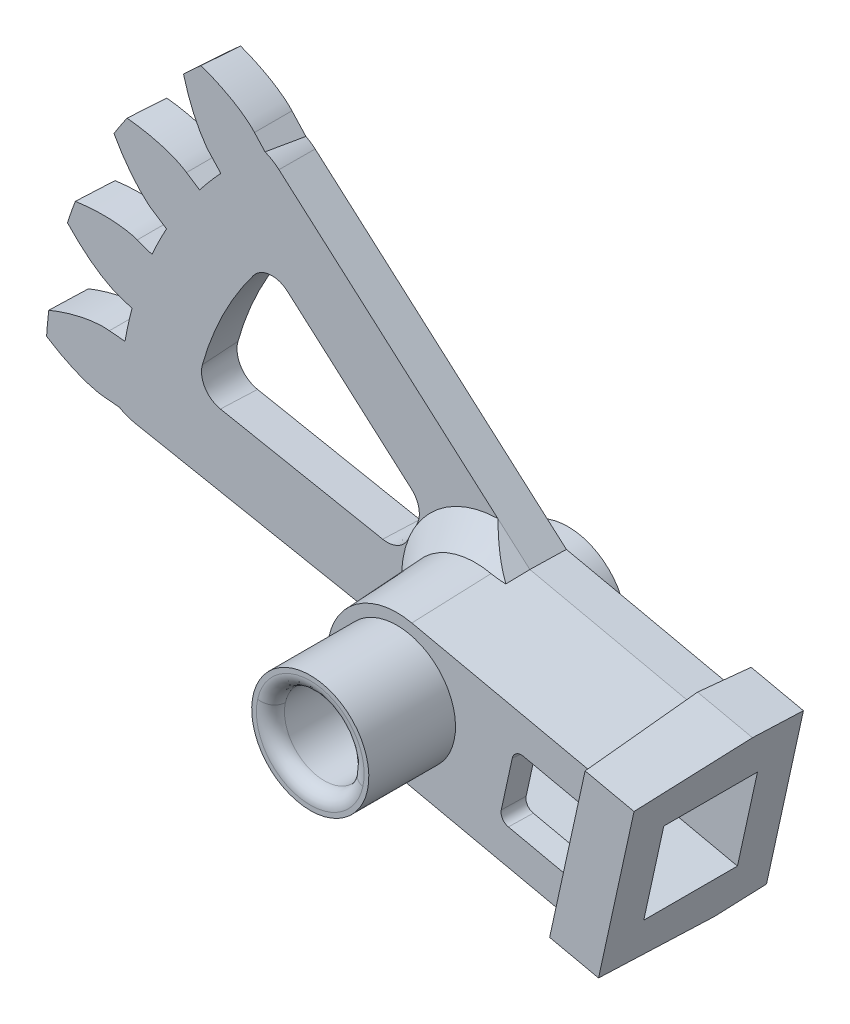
ISO-10303-21;
HEADER;
FILE_DESCRIPTION(('STEP AP214'),'2;1');
FILE_NAME('part.step','',(''),(''),'','','');
FILE_SCHEMA(('AUTOMOTIVE_DESIGN { 1 0 10303 214 1 1 1 1 }'));
ENDSEC;
DATA;
#1=APPLICATION_CONTEXT('core data for automotive mechanical design processes');
#2=APPLICATION_PROTOCOL_DEFINITION('international standard','automotive_design',2000,#1);
#3=PRODUCT_CONTEXT('',#1,'mechanical');
#4=PRODUCT('Part','Part','',(#3));
#5=PRODUCT_RELATED_PRODUCT_CATEGORY('part','',(#4));
#6=PRODUCT_DEFINITION_FORMATION('','',#4);
#7=PRODUCT_DEFINITION_CONTEXT('part definition',#1,'design');
#8=PRODUCT_DEFINITION('design','',#6,#7);
#9=PRODUCT_DEFINITION_SHAPE('','',#8);
#10=(LENGTH_UNIT() NAMED_UNIT(*) SI_UNIT(.MILLI.,.METRE.));
#11=(NAMED_UNIT(*) PLANE_ANGLE_UNIT() SI_UNIT($,.RADIAN.));
#12=(NAMED_UNIT(*) SI_UNIT($,.STERADIAN.) SOLID_ANGLE_UNIT());
#13=UNCERTAINTY_MEASURE_WITH_UNIT(LENGTH_MEASURE(1.E-05),#10,'distance_accuracy_value','');
#14=(GEOMETRIC_REPRESENTATION_CONTEXT(3) GLOBAL_UNCERTAINTY_ASSIGNED_CONTEXT((#13)) GLOBAL_UNIT_ASSIGNED_CONTEXT((#10,
#11,#12)) REPRESENTATION_CONTEXT('',''));
#15=CARTESIAN_POINT('',(0.,0.,0.));
#16=DIRECTION('',(0.,0.,1.));
#17=DIRECTION('',(1.,0.,0.));
#18=AXIS2_PLACEMENT_3D('',#15,#16,#17);
#19=CARTESIAN_POINT('',(13.23131850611,1.096142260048,-4.028));
#20=DIRECTION('',(0.975508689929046,-0.213643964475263,0.0523359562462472));
#21=DIRECTION('',(-0.213937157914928,-0.976847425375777,0.));
#22=AXIS2_PLACEMENT_3D('',#19,#20,#21);
#23=PLANE('',#22);
#24=DIRECTION('',(0.0398730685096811,-0.0622356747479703,-0.997264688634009));
#25=VECTOR('',#24,1.);
#26=CARTESIAN_POINT('',(13.1520044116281,0.728600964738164,-4.05000000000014));
#27=LINE('',#26,#25);
#28=CARTESIAN_POINT('',(13.1520044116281,0.728600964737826,-4.05000000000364));
#29=VERTEX_POINT('',#28);
#30=CARTESIAN_POINT('',(13.1839903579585,0.678675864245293,-4.85000000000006));
#31=VERTEX_POINT('',#30);
#32=EDGE_CURVE('E472',#29,#31,#27,.T.);
#33=ORIENTED_EDGE('',*,*,#32,.F.);
#34=DIRECTION('',(-0.213937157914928,-0.976847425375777,0.));
#35=VECTOR('',#34,1.);
#36=CARTESIAN_POINT('',(12.8097049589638,-0.834354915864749,-4.04999999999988));
#37=LINE('',#36,#35);
#38=CARTESIAN_POINT('',(13.2161855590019,1.02165519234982,-4.04999999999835));
#39=VERTEX_POINT('',#38);
#40=EDGE_CURVE('E476',#39,#29,#37,.T.);
#41=ORIENTED_EDGE('',*,*,#40,.F.);
#42=DIRECTION('',(0.0398730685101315,-0.0622356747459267,-0.997264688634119));
#43=VECTOR('',#42,1.);
#44=CARTESIAN_POINT('',(13.2161855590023,1.02165519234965,-4.04999999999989));
#45=LINE('',#44,#43);
#46=CARTESIAN_POINT('',(13.2601662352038,0.953008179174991,-5.14999999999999));
#47=VERTEX_POINT('',#46);
#48=EDGE_CURVE('E471',#39,#47,#45,.T.);
#49=ORIENTED_EDGE('',*,*,#48,.T.);
#50=DIRECTION('',(0.213937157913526,0.976847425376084,0.));
#51=VECTOR('',#50,1.);
#52=CARTESIAN_POINT('',(12.8660188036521,-0.8466880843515,-5.15));
#53=LINE('',#52,#51);
#54=CARTESIAN_POINT('',(12.4718713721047,-2.64638434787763,-5.14999999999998));
#55=VERTEX_POINT('',#54);
#56=EDGE_CURVE('E502',#47,#55,#53,.F.);
#57=ORIENTED_EDGE('',*,*,#56,.T.);
#58=DIRECTION('',(0.0622356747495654,0.0398730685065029,-0.997264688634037));
#59=VECTOR('',#58,1.);
#60=CARTESIAN_POINT('',(12.4032243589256,-2.69036502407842,-4.05000000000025));
#61=LINE('',#60,#59);
#62=CARTESIAN_POINT('',(12.4032243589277,-2.69036502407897,-4.05000000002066));
#63=VERTEX_POINT('',#62);
#64=EDGE_CURVE('E484',#63,#55,#61,.T.);
#65=ORIENTED_EDGE('',*,*,#64,.F.);
#66=DIRECTION('',(-0.213937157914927,-0.976847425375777,0.));
#67=VECTOR('',#66,1.);
#68=CARTESIAN_POINT('',(12.8097049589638,-0.83435491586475,-4.05));
#69=LINE('',#68,#67);
#70=CARTESIAN_POINT('',(12.4674055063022,-2.39731079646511,-4.05000000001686));
#71=VERTEX_POINT('',#70);
#72=EDGE_CURVE('E490',#71,#63,#69,.T.);
#73=ORIENTED_EDGE('',*,*,#72,.F.);
#74=DIRECTION('',(-0.0622356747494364,-0.0398730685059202,0.997264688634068));
#75=VECTOR('',#74,1.);
#76=CARTESIAN_POINT('',(12.5173306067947,-2.36532485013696,-4.85000000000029));
#77=LINE('',#76,#75);
#78=CARTESIAN_POINT('',(12.5173306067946,-2.36532485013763,-4.85000000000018));
#79=VERTEX_POINT('',#78);
#80=EDGE_CURVE('E493',#79,#71,#77,.T.);
#81=ORIENTED_EDGE('',*,*,#80,.F.);
#82=DIRECTION('',(-0.213937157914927,-0.976847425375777,0.));
#83=VECTOR('',#82,1.);
#84=CARTESIAN_POINT('',(12.8506604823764,-0.843324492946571,-4.85000000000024));
#85=LINE('',#84,#83);
#86=CARTESIAN_POINT('',(12.7329364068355,-1.38085832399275,-4.85000000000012));
#87=VERTEX_POINT('',#86);
#88=EDGE_CURVE('E499',#87,#79,#85,.T.);
#89=ORIENTED_EDGE('',*,*,#88,.F.);
#90=DIRECTION('',(0.0398730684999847,-0.0622356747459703,-0.997264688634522));
#91=VECTOR('',#90,1.);
#92=CARTESIAN_POINT('',(12.7128242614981,-1.34946638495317,-4.34697544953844));
#93=LINE('',#92,#91);
#94=CARTESIAN_POINT('',(12.7129451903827,-1.34965513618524,-4.34999999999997));
#95=VERTEX_POINT('',#94);
#96=EDGE_CURVE('E439',#95,#87,#93,.T.);
#97=ORIENTED_EDGE('',*,*,#96,.F.);
#98=DIRECTION('',(-0.213937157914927,-0.976847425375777,0.));
#99=VECTOR('',#98,1.);
#100=CARTESIAN_POINT('',(12.8250632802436,-0.837718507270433,-4.35000000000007));
#101=LINE('',#100,#99);
#102=CARTESIAN_POINT('',(12.9371813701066,-0.325781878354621,-4.35000000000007));
#103=VERTEX_POINT('',#102);
#104=EDGE_CURVE('E436',#103,#95,#101,.T.);
#105=ORIENTED_EDGE('',*,*,#104,.F.);
#106=DIRECTION('',(-0.0622356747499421,-0.0398730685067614,0.997264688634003));
#107=VECTOR('',#106,1.);
#108=CARTESIAN_POINT('',(12.9688286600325,-0.305506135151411,-4.85711629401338));
#109=LINE('',#108,#107);
#110=CARTESIAN_POINT('',(12.9683845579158,-0.305790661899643,-4.85000000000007));
#111=VERTEX_POINT('',#110);
#112=EDGE_CURVE('E21',#111,#103,#109,.T.);
#113=ORIENTED_EDGE('',*,*,#112,.F.);
#114=DIRECTION('',(-0.213937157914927,-0.976847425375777,0.));
#115=VECTOR('',#114,1.);
#116=CARTESIAN_POINT('',(12.8506604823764,-0.843324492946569,-4.85000000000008));
#117=LINE('',#116,#115);
#118=EDGE_CURVE('E466',#31,#111,#117,.T.);
#119=ORIENTED_EDGE('',*,*,#118,.F.);
#120=EDGE_LOOP('',(#33,#41,#49,#57,#65,#73,#81,#89,#97,#105,#113,#119));
#121=FACE_BOUND('',#120,.T.);
#122=ADVANCED_FACE('F16',(#121),#23,.F.);
#123=CARTESIAN_POINT('',(7.45163397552,-0.9933635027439,0.));
#124=DIRECTION('',(0.,0.,1.));
#125=DIRECTION('',(0.976847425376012,-0.213937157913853,0.));
#126=AXIS2_PLACEMENT_3D('',#123,#124,#125);
#127=PLANE('',#126);
#128=CARTESIAN_POINT('',(9.,0.,-6.81366855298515E-13));
#129=DIRECTION('',(0.,0.,1.));
#130=DIRECTION('',(-0.976847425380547,0.213937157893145,0.));
#131=AXIS2_PLACEMENT_3D('',#128,#129,#130);
#132=CIRCLE('',#131,1.14999935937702);
#133=CARTESIAN_POINT('',(10.1233739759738,-0.24602760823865,-3.06268582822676E-13));
#134=VERTEX_POINT('',#133);
#135=CARTESIAN_POINT('',(7.87662602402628,0.246027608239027,-3.06648053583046E-13));
#136=VERTEX_POINT('',#135);
#137=EDGE_CURVE('E512',#134,#136,#132,.F.);
#138=ORIENTED_EDGE('',*,*,#137,.T.);
#139=CARTESIAN_POINT('',(9.,0.,-6.81366855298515E-13));
#140=DIRECTION('',(0.,0.,1.));
#141=DIRECTION('',(0.976847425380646,-0.213937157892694,0.));
#142=AXIS2_PLACEMENT_3D('',#139,#140,#141);
#143=CIRCLE('',#142,1.14999935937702);
#144=EDGE_CURVE('E1259',#136,#134,#143,.F.);
#145=ORIENTED_EDGE('',*,*,#144,.T.);
#146=EDGE_LOOP('',(#138,#145));
#147=FACE_BOUND('',#146,.T.);
#148=CARTESIAN_POINT('',(9.,0.,0.));
#149=DIRECTION('',(0.,0.,1.));
#150=DIRECTION('',(0.,-1.,0.));
#151=AXIS2_PLACEMENT_3D('',#148,#149,#150);
#152=CIRCLE('',#151,1.25000000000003);
#153=CARTESIAN_POINT('',(9.,-1.25000000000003,0.));
#154=VERTEX_POINT('',#153);
#155=EDGE_CURVE('E1590',#154,#154,#152,.T.);
#156=ORIENTED_EDGE('',*,*,#155,.T.);
#157=EDGE_LOOP('',(#156));
#158=FACE_BOUND('',#157,.T.);
#159=ADVANCED_FACE('F518',(#147,#158),#127,.T.);
#160=CARTESIAN_POINT('',(13.19298788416,1.027915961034,-4.028));
#161=DIRECTION('',(0.213643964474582,0.975508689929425,-0.0523359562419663));
#162=DIRECTION('',(0.976847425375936,-0.213937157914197,0.));
#163=AXIS2_PLACEMENT_3D('',#160,#161,#162);
#164=PLANE('',#163);
#165=DIRECTION('',(0.976847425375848,-0.2139371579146,0.));
#166=VECTOR('',#165,1.);
#167=CARTESIAN_POINT('',(13.8181177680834,0.8308124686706,-5.15));
#168=LINE('',#167,#166);
#169=CARTESIAN_POINT('',(14.3760693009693,0.708616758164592,-5.15));
#170=VERTEX_POINT('',#169);
#171=EDGE_CURVE('E474',#170,#47,#168,.F.);
#172=ORIENTED_EDGE('',*,*,#171,.T.);
#173=ORIENTED_EDGE('',*,*,#48,.F.);
#174=DIRECTION('',(-0.976847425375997,0.213937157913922,0.));
#175=VECTOR('',#174,1.);
#176=CARTESIAN_POINT('',(13.8022940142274,0.893292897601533,-4.04999999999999));
#177=LINE('',#176,#175);
#178=CARTESIAN_POINT('',(14.3884024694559,0.764930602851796,-4.0500000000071));
#179=VERTEX_POINT('',#178);
#180=EDGE_CURVE('E485',#39,#179,#177,.F.);
#181=ORIENTED_EDGE('',*,*,#180,.T.);
#182=DIRECTION('',(-0.0111966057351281,-0.0511242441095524,-0.998629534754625));
#183=VECTOR('',#182,1.);
#184=CARTESIAN_POINT('',(14.388649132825,0.766056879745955,-4.028));
#185=LINE('',#184,#183);
#186=EDGE_CURVE('E552',#179,#170,#185,.T.);
#187=ORIENTED_EDGE('',*,*,#186,.T.);
#188=EDGE_LOOP('',(#172,#173,#181,#187));
#189=FACE_BOUND('',#188,.T.);
#190=ADVANCED_FACE('F528',(#189),#164,.T.);
#191=CARTESIAN_POINT('',(12.43378741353,-2.713484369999,-5.15));
#192=DIRECTION('',(0.,0.,-1.));
#193=DIRECTION('',(0.213937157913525,0.976847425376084,0.));
#194=AXIS2_PLACEMENT_3D('',#191,#192,#193);
#195=PLANE('',#194);
#196=ORIENTED_EDGE('',*,*,#56,.F.);
#197=ORIENTED_EDGE('',*,*,#171,.F.);
#198=DIRECTION('',(0.213937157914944,0.976847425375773,0.));
#199=VECTOR('',#198,1.);
#200=CARTESIAN_POINT('',(13.98192186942,-1.09107950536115,-5.15));
#201=LINE('',#200,#199);
#202=CARTESIAN_POINT('',(13.5877744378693,-2.89077576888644,-5.14999999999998));
#203=VERTEX_POINT('',#202);
#204=EDGE_CURVE('E548',#170,#203,#201,.F.);
#205=ORIENTED_EDGE('',*,*,#204,.T.);
#206=DIRECTION('',(0.976847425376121,-0.213937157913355,0.));
#207=VECTOR('',#206,1.);
#208=CARTESIAN_POINT('',(13.0016659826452,-2.76241347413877,-5.14999999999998));
#209=LINE('',#208,#207);
#210=EDGE_CURVE('E489',#203,#55,#209,.F.);
#211=ORIENTED_EDGE('',*,*,#210,.T.);
#212=EDGE_LOOP('',(#196,#197,#205,#211));
#213=FACE_BOUND('',#212,.T.);
#214=ADVANCED_FACE('F1624',(#213),#195,.T.);
#215=CARTESIAN_POINT('',(13.59863894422,-2.953350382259,-4.028));
#216=DIRECTION('',(-0.213643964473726,-0.975508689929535,-0.0523359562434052));
#217=DIRECTION('',(-0.976847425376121,0.213937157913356,0.));
#218=AXIS2_PLACEMENT_3D('',#215,#216,#217);
#219=PLANE('',#218);
#220=DIRECTION('',(0.0111966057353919,0.0511242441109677,-0.99862953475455));
#221=VECTOR('',#220,1.);
#222=CARTESIAN_POINT('',(13.5751946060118,-2.94821589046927,-4.028));
#223=LINE('',#222,#221);
#224=CARTESIAN_POINT('',(13.5754412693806,-2.9470896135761,-4.04999999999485));
#225=VERTEX_POINT('',#224);
#226=EDGE_CURVE('E551',#203,#225,#223,.F.);
#227=ORIENTED_EDGE('',*,*,#226,.T.);
#228=DIRECTION('',(0.976847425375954,-0.213937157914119,0.));
#229=VECTOR('',#228,1.);
#230=CARTESIAN_POINT('',(12.9893328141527,-2.81872731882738,-4.04999999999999));
#231=LINE('',#230,#229);
#232=EDGE_CURVE('E494',#225,#63,#231,.F.);
#233=ORIENTED_EDGE('',*,*,#232,.T.);
#234=ORIENTED_EDGE('',*,*,#64,.T.);
#235=ORIENTED_EDGE('',*,*,#210,.F.);
#236=EDGE_LOOP('',(#227,#233,#234,#235));
#237=FACE_BOUND('',#236,.T.);
#238=ADVANCED_FACE('F1620',(#237),#219,.T.);
#239=CARTESIAN_POINT('',(10.21887901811,0.7977054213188,-2.35));
#240=DIRECTION('',(0.,0.,1.));
#241=DIRECTION('',(-0.213937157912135,-0.976847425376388,0.));
#242=AXIS2_PLACEMENT_3D('',#239,#240,#241);
#243=PLANE('',#242);
#244=DIRECTION('',(0.213937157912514,0.976847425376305,0.));
#245=VECTOR('',#244,1.);
#246=CARTESIAN_POINT('',(12.8967354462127,-0.853415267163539,-2.34999999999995));
#247=LINE('',#246,#245);
#248=CARTESIAN_POINT('',(12.7846173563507,-1.3653518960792,-2.35));
#249=VERTEX_POINT('',#248);
#250=CARTESIAN_POINT('',(13.0088535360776,-0.341478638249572,-2.35));
#251=VERTEX_POINT('',#250);
#252=EDGE_CURVE('E1604',#249,#251,#247,.T.);
#253=ORIENTED_EDGE('',*,*,#252,.T.);
#254=CARTESIAN_POINT('',(12.8130985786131,-0.299168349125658,-2.35));
#255=DIRECTION('',(0.,0.,1.));
#256=DIRECTION('',(0.842011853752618,0.539459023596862,0.));
#257=AXIS2_PLACEMENT_3D('',#254,#255,#256);
#258=ELLIPSE('',#257,0.200548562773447,0.200000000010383);
#259=CARTESIAN_POINT('',(12.8564805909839,-0.103648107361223,-2.35000000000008));
#260=VERTEX_POINT('',#259);
#261=EDGE_CURVE('E1281',#251,#260,#258,.T.);
#262=ORIENTED_EDGE('',*,*,#261,.T.);
#263=DIRECTION('',(-0.976847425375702,0.213937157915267,0.));
#264=VECTOR('',#263,1.);
#265=CARTESIAN_POINT('',(12.2882301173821,0.020803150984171,-2.34999999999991));
#266=LINE('',#265,#264);
#267=CARTESIAN_POINT('',(11.7199796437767,0.145254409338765,-2.34999999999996));
#268=VERTEX_POINT('',#267);
#269=EDGE_CURVE('E1270',#260,#268,#266,.T.);
#270=ORIENTED_EDGE('',*,*,#269,.T.);
#271=CARTESIAN_POINT('',(11.6776693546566,-0.0505005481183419,-2.35));
#272=DIRECTION('',(0.,0.,1.));
#273=DIRECTION('',(0.539459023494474,-0.842011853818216,0.));
#274=AXIS2_PLACEMENT_3D('',#271,#272,#273);
#275=ELLIPSE('',#274,0.200548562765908,0.20000000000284);
#276=CARTESIAN_POINT('',(11.4821491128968,-0.00711853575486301,-2.35));
#277=VERTEX_POINT('',#276);
#278=EDGE_CURVE('E1278',#268,#277,#275,.T.);
#279=ORIENTED_EDGE('',*,*,#278,.T.);
#280=DIRECTION('',(-0.213937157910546,-0.976847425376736,0.));
#281=VECTOR('',#280,1.);
#282=CARTESIAN_POINT('',(11.3700310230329,-0.519055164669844,-2.35000000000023));
#283=LINE('',#282,#281);
#284=CARTESIAN_POINT('',(11.2579129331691,-1.03099179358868,-2.35));
#285=VERTEX_POINT('',#284);
#286=EDGE_CURVE('E497',#277,#285,#283,.T.);
#287=ORIENTED_EDGE('',*,*,#286,.T.);
#288=CARTESIAN_POINT('',(11.4536678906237,-1.07330208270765,-2.35));
#289=DIRECTION('',(0.,0.,1.));
#290=DIRECTION('',(0.842011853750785,0.539459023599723,0.));
#291=AXIS2_PLACEMENT_3D('',#288,#289,#290);
#292=ELLIPSE('',#291,0.200548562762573,0.199999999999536);
#293=CARTESIAN_POINT('',(11.4102858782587,-1.26882232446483,-2.35000000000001));
#294=VERTEX_POINT('',#293);
#295=EDGE_CURVE('E1295',#285,#294,#292,.T.);
#296=ORIENTED_EDGE('',*,*,#295,.T.);
#297=DIRECTION('',(0.976847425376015,-0.21393715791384,0.));
#298=VECTOR('',#297,1.);
#299=CARTESIAN_POINT('',(11.9785363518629,-1.3932735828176,-2.35000000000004));
#300=LINE('',#299,#298);
#301=CARTESIAN_POINT('',(12.5467868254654,-1.51772484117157,-2.35000000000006));
#302=VERTEX_POINT('',#301);
#303=EDGE_CURVE('E480',#294,#302,#300,.T.);
#304=ORIENTED_EDGE('',*,*,#303,.T.);
#305=CARTESIAN_POINT('',(12.5890971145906,-1.32196988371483,-2.35));
#306=DIRECTION('',(0.,0.,1.));
#307=DIRECTION('',(-0.539459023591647,0.842011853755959,0.));
#308=AXIS2_PLACEMENT_3D('',#305,#306,#307);
#309=ELLIPSE('',#308,0.200548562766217,0.200000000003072);
#310=EDGE_CURVE('E1285',#302,#249,#309,.T.);
#311=ORIENTED_EDGE('',*,*,#310,.T.);
#312=EDGE_LOOP('',(#253,#262,#270,#279,#287,#296,#304,#311));
#313=FACE_BOUND('',#312,.T.);
#314=DIRECTION('',(-0.21393715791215,-0.976847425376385,0.));
#315=VECTOR('',#314,1.);
#316=CARTESIAN_POINT('',(10.0745321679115,-0.2353308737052,-2.35));
#317=LINE('',#316,#315);
#318=CARTESIAN_POINT('',(9.8605950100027,-1.21217829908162,-2.35));
#319=VERTEX_POINT('',#318);
#320=CARTESIAN_POINT('',(10.2884693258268,0.741516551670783,-2.35));
#321=VERTEX_POINT('',#320);
#322=EDGE_CURVE('E1197',#319,#321,#317,.F.);
#323=ORIENTED_EDGE('',*,*,#322,.T.);
#324=DIRECTION('',(0.976847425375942,-0.213937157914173,0.));
#325=VECTOR('',#324,1.);
#326=CARTESIAN_POINT('',(12.24216417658,0.31364223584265,-2.35));
#327=LINE('',#326,#325);
#328=CARTESIAN_POINT('',(14.1958590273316,-0.114232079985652,-2.35));
#329=VERTEX_POINT('',#328);
#330=EDGE_CURVE('E1184',#321,#329,#327,.T.);
#331=ORIENTED_EDGE('',*,*,#330,.T.);
#332=DIRECTION('',(0.213937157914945,0.976847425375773,0.));
#333=VECTOR('',#332,1.);
#334=CARTESIAN_POINT('',(13.98192186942,-1.09107950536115,-2.35));
#335=LINE('',#334,#333);
#336=CARTESIAN_POINT('',(13.7679847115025,-2.06792693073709,-2.35));
#337=VERTEX_POINT('',#336);
#338=EDGE_CURVE('E1206',#329,#337,#335,.F.);
#339=ORIENTED_EDGE('',*,*,#338,.T.);
#340=DIRECTION('',(-0.976847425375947,0.21393715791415,0.));
#341=VECTOR('',#340,1.);
#342=CARTESIAN_POINT('',(11.81428986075,-1.640052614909,-2.35));
#343=LINE('',#342,#341);
#344=EDGE_CURVE('E1200',#337,#319,#343,.T.);
#345=ORIENTED_EDGE('',*,*,#344,.T.);
#346=EDGE_LOOP('',(#323,#331,#339,#345));
#347=FACE_BOUND('',#346,.T.);
#348=ADVANCED_FACE('F1630',(#313,#347),#243,.F.);
#349=CARTESIAN_POINT('',(13.16415069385,0.896243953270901,-1.5));
#350=DIRECTION('',(0.213643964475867,0.975508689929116,0.0523359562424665));
#351=DIRECTION('',(0.976847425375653,-0.21393715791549,0.));
#352=AXIS2_PLACEMENT_3D('',#349,#350,#351);
#353=PLANE('',#352);
#354=DIRECTION('',(-0.976847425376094,0.213937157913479,0.));
#355=VECTOR('',#354,1.);
#356=CARTESIAN_POINT('',(13.8382570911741,0.75129192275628,-1.55));
#357=LINE('',#356,#355);
#358=CARTESIAN_POINT('',(13.316141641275,0.865639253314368,-1.54999999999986));
#359=VERTEX_POINT('',#358);
#360=CARTESIAN_POINT('',(14.3603725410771,0.636944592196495,-1.55));
#361=VERTEX_POINT('',#360);
#362=EDGE_CURVE('E488',#359,#361,#357,.F.);
#363=ORIENTED_EDGE('',*,*,#362,.T.);
#364=DIRECTION('',(0.0111966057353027,0.0511242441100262,-0.998629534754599));
#365=VECTOR('',#364,1.);
#366=CARTESIAN_POINT('',(14.3598119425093,0.634384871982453,-1.5));
#367=LINE('',#366,#365);
#368=EDGE_CURVE('E546',#361,#179,#367,.T.);
#369=ORIENTED_EDGE('',*,*,#368,.T.);
#370=ORIENTED_EDGE('',*,*,#180,.F.);
#371=DIRECTION('',(0.0398730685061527,-0.0622356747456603,0.997264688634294));
#372=VECTOR('',#371,1.);
#373=CARTESIAN_POINT('',(13.2161855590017,1.02165519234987,-4.05000000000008));
#374=LINE('',#373,#372);
#375=EDGE_CURVE('E557',#39,#359,#374,.T.);
#376=ORIENTED_EDGE('',*,*,#375,.T.);
#377=EDGE_LOOP('',(#363,#369,#370,#376));
#378=FACE_BOUND('',#377,.T.);
#379=ADVANCED_FACE('F1577',(#378),#353,.T.);
#380=CARTESIAN_POINT('',(13.31004544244,0.939410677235,-1.55));
#381=DIRECTION('',(0.,0.,1.));
#382=DIRECTION('',(-0.213937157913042,-0.976847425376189,0.));
#383=AXIS2_PLACEMENT_3D('',#380,#381,#382);
#384=PLANE('',#383);
#385=DIRECTION('',(-0.213937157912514,-0.976847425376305,0.));
#386=VECTOR('',#385,1.);
#387=CARTESIAN_POINT('',(12.9376909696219,-0.862384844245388,-1.54999999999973));
#388=LINE('',#387,#386);
#389=CARTESIAN_POINT('',(12.559240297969,-2.59040894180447,-1.54999999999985));
#390=VERTEX_POINT('',#389);
#391=EDGE_CURVE('E554',#359,#390,#388,.T.);
#392=ORIENTED_EDGE('',*,*,#391,.T.);
#393=DIRECTION('',(-0.976847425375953,0.21393715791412,0.));
#394=VECTOR('',#393,1.);
#395=CARTESIAN_POINT('',(13.0173627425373,-2.69074130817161,-1.54999999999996));
#396=LINE('',#395,#394);
#397=CARTESIAN_POINT('',(13.603471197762,-2.8191036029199,-1.54999999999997));
#398=VERTEX_POINT('',#397);
#399=EDGE_CURVE('E498',#390,#398,#396,.F.);
#400=ORIENTED_EDGE('',*,*,#399,.T.);
#401=DIRECTION('',(-0.213937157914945,-0.976847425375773,0.));
#402=VECTOR('',#401,1.);
#403=CARTESIAN_POINT('',(13.98192186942,-1.09107950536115,-1.55));
#404=LINE('',#403,#402);
#405=EDGE_CURVE('E543',#398,#361,#404,.F.);
#406=ORIENTED_EDGE('',*,*,#405,.T.);
#407=ORIENTED_EDGE('',*,*,#362,.F.);
#408=EDGE_LOOP('',(#392,#400,#406,#407));
#409=FACE_BOUND('',#408,.T.);
#410=ADVANCED_FACE('F1637',(#409),#384,.T.);
#411=CARTESIAN_POINT('',(13.62747613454,-2.821678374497,-1.5));
#412=DIRECTION('',(-0.21364396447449,-0.975508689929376,0.052335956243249));
#413=DIRECTION('',(-0.976847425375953,0.21393715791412,0.));
#414=AXIS2_PLACEMENT_3D('',#411,#412,#413);
#415=PLANE('',#414);
#416=DIRECTION('',(-0.0111966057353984,-0.0511242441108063,-0.998629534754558));
#417=VECTOR('',#416,1.);
#418=CARTESIAN_POINT('',(13.6040317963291,-2.81654388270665,-1.5));
#419=LINE('',#418,#417);
#420=EDGE_CURVE('E547',#225,#398,#419,.F.);
#421=ORIENTED_EDGE('',*,*,#420,.T.);
#422=ORIENTED_EDGE('',*,*,#399,.F.);
#423=DIRECTION('',(-0.0622356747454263,-0.0398730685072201,-0.997264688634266));
#424=VECTOR('',#423,1.);
#425=CARTESIAN_POINT('',(12.559240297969,-2.59040894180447,-1.54999999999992));
#426=LINE('',#425,#424);
#427=EDGE_CURVE('E556',#390,#63,#426,.T.);
#428=ORIENTED_EDGE('',*,*,#427,.T.);
#429=ORIENTED_EDGE('',*,*,#232,.F.);
#430=EDGE_LOOP('',(#421,#422,#428,#429));
#431=FACE_BOUND('',#430,.T.);
#432=ADVANCED_FACE('F1617',(#431),#415,.T.);
#433=CARTESIAN_POINT('',(11.4935753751,0.03973663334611,-2.37170771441));
#434=DIRECTION('',(-0.975508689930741,0.213643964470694,-0.0523359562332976));
#435=DIRECTION('',(-0.213937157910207,-0.97684742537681,0.));
#436=AXIS2_PLACEMENT_3D('',#433,#434,#435);
#437=PLANE('',#436);
#438=DIRECTION('',(0.0398730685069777,-0.0622356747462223,-0.997264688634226));
#439=VECTOR('',#438,1.);
#440=CARTESIAN_POINT('',(11.47206723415,0.0086177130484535,-2.0978422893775));
#441=LINE('',#440,#439);
#442=CARTESIAN_POINT('',(11.4621578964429,0.0240846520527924,-1.84999999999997));
#443=VERTEX_POINT('',#442);
#444=EDGE_CURVE('E1592',#277,#443,#441,.F.);
#445=ORIENTED_EDGE('',*,*,#444,.T.);
#446=DIRECTION('',(0.213937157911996,0.976847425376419,0.));
#447=VECTOR('',#446,1.);
#448=CARTESIAN_POINT('',(11.3444338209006,-0.51344917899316,-1.85));
#449=LINE('',#448,#447);
#450=CARTESIAN_POINT('',(11.226709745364,-1.05098301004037,-1.84999999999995));
#451=VERTEX_POINT('',#450);
#452=EDGE_CURVE('E1169',#443,#451,#449,.F.);
#453=ORIENTED_EDGE('',*,*,#452,.T.);
#454=DIRECTION('',(-0.0622356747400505,-0.0398730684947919,0.997264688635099));
#455=VECTOR('',#454,1.);
#456=CARTESIAN_POINT('',(11.242176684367,-1.04107367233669,-2.0978422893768));
#457=LINE('',#456,#455);
#458=EDGE_CURVE('E1269',#451,#285,#457,.F.);
#459=ORIENTED_EDGE('',*,*,#458,.T.);
#460=ORIENTED_EDGE('',*,*,#286,.F.);
#461=EDGE_LOOP('',(#445,#453,#459,#460));
#462=FACE_BOUND('',#461,.T.);
#463=ADVANCED_FACE('F1643',(#462),#437,.F.);
#464=CARTESIAN_POINT('',(11.4213673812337,-1.09399632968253,-1.83241651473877));
#465=DIRECTION('',(0.0622356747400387,0.0398730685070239,-0.99726468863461));
#466=DIRECTION('',(-0.998058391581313,0.,-0.0622852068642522));
#467=AXIS2_PLACEMENT_3D('',#464,#465,#466);
#468=CYLINDRICAL_SURFACE('',#467,0.199999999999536);
#469=ORIENTED_EDGE('',*,*,#295,.F.);
#470=ORIENTED_EDGE('',*,*,#458,.F.);
#471=CARTESIAN_POINT('',(11.4224647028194,-1.09329329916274,-1.85));
#472=DIRECTION('',(0.,0.,1.));
#473=DIRECTION('',(0.842011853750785,0.539459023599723,0.));
#474=AXIS2_PLACEMENT_3D('',#471,#472,#473);
#475=ELLIPSE('',#474,0.200548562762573,0.199999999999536);
#476=CARTESIAN_POINT('',(11.3790826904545,-1.28881354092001,-1.84999999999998));
#477=VERTEX_POINT('',#476);
#478=EDGE_CURVE('E1168',#451,#477,#475,.T.);
#479=ORIENTED_EDGE('',*,*,#478,.T.);
#480=DIRECTION('',(0.0622356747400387,0.0398730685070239,-0.99726468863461));
#481=VECTOR('',#480,1.);
#482=CARTESIAN_POINT('',(11.3786385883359,-1.28909806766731,-1.84288370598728));
#483=LINE('',#482,#481);
#484=EDGE_CURVE('E1292',#477,#294,#483,.T.);
#485=ORIENTED_EDGE('',*,*,#484,.T.);
#486=EDGE_LOOP('',(#469,#470,#479,#485));
#487=FACE_BOUND('',#486,.T.);
#488=ADVANCED_FACE('F1646',(#487),#468,.F.);
#489=CARTESIAN_POINT('',(11.36117815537,-1.256902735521,-2.37170771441));
#490=DIRECTION('',(-0.213643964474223,-0.975508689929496,-0.0523359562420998));
#491=DIRECTION('',(0.976847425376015,-0.21393715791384,0.));
#492=AXIS2_PLACEMENT_3D('',#489,#490,#491);
#493=PLANE('',#492);
#494=ORIENTED_EDGE('',*,*,#484,.F.);
#495=DIRECTION('',(-0.976847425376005,0.213937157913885,0.));
#496=VECTOR('',#495,1.);
#497=CARTESIAN_POINT('',(10.0748310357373,-1.00317231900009,-1.85));
#498=LINE('',#497,#496);
#499=CARTESIAN_POINT('',(12.5667780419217,-1.54892802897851,-1.85000000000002));
#500=VERTEX_POINT('',#499);
#501=EDGE_CURVE('E1165',#477,#500,#498,.F.);
#502=ORIENTED_EDGE('',*,*,#501,.T.);
#503=DIRECTION('',(0.0398730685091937,-0.062235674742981,0.99726468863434));
#504=VECTOR('',#503,1.);
#505=CARTESIAN_POINT('',(12.5568687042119,-1.53346108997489,-2.09784228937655));
#506=LINE('',#505,#504);
#507=EDGE_CURVE('E1291',#500,#302,#506,.F.);
#508=ORIENTED_EDGE('',*,*,#507,.T.);
#509=ORIENTED_EDGE('',*,*,#303,.F.);
#510=EDGE_LOOP('',(#494,#502,#508,#509));
#511=FACE_BOUND('',#510,.T.);
#512=ADVANCED_FACE('F1647',(#511),#493,.F.);
#513=CARTESIAN_POINT('',(12.609791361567,-1.354270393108,-1.83241651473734));
#514=DIRECTION('',(-0.0398730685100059,0.0622356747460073,-0.997264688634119));
#515=DIRECTION('',(0.,0.99805839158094,0.062285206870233));
#516=AXIS2_PLACEMENT_3D('',#513,#514,#515);
#517=CYLINDRICAL_SURFACE('',#516,0.200000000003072);
#518=ORIENTED_EDGE('',*,*,#310,.F.);
#519=ORIENTED_EDGE('',*,*,#507,.F.);
#520=CARTESIAN_POINT('',(12.6090883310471,-1.35317307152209,-1.85));
#521=DIRECTION('',(0.,0.,1.));
#522=DIRECTION('',(-0.539459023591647,0.842011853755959,0.));
#523=AXIS2_PLACEMENT_3D('',#520,#521,#522);
#524=ELLIPSE('',#523,0.200548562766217,0.200000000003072);
#525=CARTESIAN_POINT('',(12.804608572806,-1.39655508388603,-1.8500000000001));
#526=VERTEX_POINT('',#525);
#527=EDGE_CURVE('E1164',#500,#526,#524,.T.);
#528=ORIENTED_EDGE('',*,*,#527,.T.);
#529=DIRECTION('',(-0.0398730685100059,0.0622356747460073,-0.997264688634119));
#530=VECTOR('',#529,1.);
#531=CARTESIAN_POINT('',(12.8048930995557,-1.39699918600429,-1.84288370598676));
#532=LINE('',#531,#530);
#533=EDGE_CURVE('E1187',#526,#249,#532,.T.);
#534=ORIENTED_EDGE('',*,*,#533,.T.);
#535=EDGE_LOOP('',(#518,#519,#528,#534));
#536=FACE_BOUND('',#535,.T.);
#537=ADVANCED_FACE('F1609',(#536),#517,.F.);
#538=CARTESIAN_POINT('',(12.8135630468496,-0.29887077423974,-2.3425573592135));
#539=DIRECTION('',(0.0622356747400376,0.0398730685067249,0.997264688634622));
#540=DIRECTION('',(0.998058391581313,0.,-0.0622852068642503));
#541=AXIS2_PLACEMENT_3D('',#538,#539,#540);
#542=CYLINDRICAL_SURFACE('',#541,0.200000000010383);
#543=CARTESIAN_POINT('',(12.8443017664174,-0.279177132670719,-1.85));
#544=DIRECTION('',(0.,0.,1.));
#545=DIRECTION('',(0.842011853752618,0.539459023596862,0.));
#546=AXIS2_PLACEMENT_3D('',#543,#544,#545);
#547=ELLIPSE('',#546,0.200548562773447,0.200000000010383);
#548=CARTESIAN_POINT('',(13.0400567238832,-0.321487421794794,-1.84999999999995));
#549=VERTEX_POINT('',#548);
#550=CARTESIAN_POINT('',(12.887683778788,-0.0836568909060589,-1.85000000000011));
#551=VERTEX_POINT('',#550);
#552=EDGE_CURVE('E1156',#549,#551,#547,.T.);
#553=ORIENTED_EDGE('',*,*,#552,.T.);
#554=DIRECTION('',(0.0622356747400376,0.0398730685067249,0.997264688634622));
#555=VECTOR('',#554,1.);
#556=CARTESIAN_POINT('',(12.8562918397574,-0.103769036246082,-2.35302455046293));
#557=LINE('',#556,#555);
#558=EDGE_CURVE('E1272',#551,#260,#557,.F.);
#559=ORIENTED_EDGE('',*,*,#558,.T.);
#560=ORIENTED_EDGE('',*,*,#261,.F.);
#561=DIRECTION('',(0.0622356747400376,0.0398730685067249,0.997264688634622));
#562=VECTOR('',#561,1.);
#563=CARTESIAN_POINT('',(13.0086647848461,-0.341599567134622,-2.35302455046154));
#564=LINE('',#563,#562);
#565=EDGE_CURVE('E1565',#251,#549,#564,.T.);
#566=ORIENTED_EDGE('',*,*,#565,.T.);
#567=EDGE_LOOP('',(#553,#559,#560,#566));
#568=FACE_BOUND('',#567,.T.);
#569=ADVANCED_FACE('F1655',(#568),#542,.F.);
#570=CARTESIAN_POINT('',(12.90558831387,-0.1155676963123,-2.37170771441));
#571=DIRECTION('',(0.21364396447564,0.975508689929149,-0.0523359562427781));
#572=DIRECTION('',(-0.976847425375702,0.213937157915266,0.));
#573=AXIS2_PLACEMENT_3D('',#570,#571,#572);
#574=PLANE('',#573);
#575=ORIENTED_EDGE('',*,*,#558,.F.);
#576=DIRECTION('',(0.976847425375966,-0.213937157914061,0.));
#577=VECTOR('',#576,1.);
#578=CARTESIAN_POINT('',(10.3957367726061,0.462098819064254,-1.85));
#579=LINE('',#578,#577);
#580=CARTESIAN_POINT('',(11.699988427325,0.17645759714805,-1.85));
#581=VERTEX_POINT('',#580);
#582=EDGE_CURVE('E1152',#551,#581,#579,.F.);
#583=ORIENTED_EDGE('',*,*,#582,.T.);
#584=DIRECTION('',(-0.0398730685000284,0.062235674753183,0.99726468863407));
#585=VECTOR('',#584,1.);
#586=CARTESIAN_POINT('',(11.709897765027,0.160990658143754,-2.09784228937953));
#587=LINE('',#586,#585);
#588=EDGE_CURVE('E1271',#581,#268,#587,.F.);
#589=ORIENTED_EDGE('',*,*,#588,.T.);
#590=ORIENTED_EDGE('',*,*,#269,.F.);
#591=EDGE_LOOP('',(#575,#583,#589,#590));
#592=FACE_BOUND('',#591,.T.);
#593=ADVANCED_FACE('F1651',(#592),#574,.F.);
#594=CARTESIAN_POINT('',(11.6569751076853,-0.0182000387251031,-1.83241651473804));
#595=DIRECTION('',(0.0398730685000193,-0.0622356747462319,-0.997264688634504));
#596=DIRECTION('',(0.,0.998058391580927,-0.0622852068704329));
#597=AXIS2_PLACEMENT_3D('',#594,#595,#596);
#598=CYLINDRICAL_SURFACE('',#597,0.20000000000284);
#599=ORIENTED_EDGE('',*,*,#278,.F.);
#600=ORIENTED_EDGE('',*,*,#588,.F.);
#601=CARTESIAN_POINT('',(11.657678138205,-0.0192973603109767,-1.85));
#602=DIRECTION('',(0.,0.,1.));
#603=DIRECTION('',(0.539459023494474,-0.842011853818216,0.));
#604=AXIS2_PLACEMENT_3D('',#601,#602,#603);
#605=ELLIPSE('',#604,0.200548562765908,0.20000000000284);
#606=EDGE_CURVE('E1155',#581,#443,#605,.T.);
#607=ORIENTED_EDGE('',*,*,#606,.T.);
#608=ORIENTED_EDGE('',*,*,#444,.F.);
#609=EDGE_LOOP('',(#599,#600,#607,#608));
#610=FACE_BOUND('',#609,.T.);
#611=ADVANCED_FACE('F1654',(#610),#598,.F.);
#612=CARTESIAN_POINT('',(9.,0.,-1.85));
#613=DIRECTION('',(0.,0.,1.));
#614=DIRECTION('',(0.,-1.,0.));
#615=AXIS2_PLACEMENT_3D('',#612,#613,#614);
#616=CYLINDRICAL_SURFACE('',#615,1.25000000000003);
#617=ORIENTED_EDGE('',*,*,#155,.F.);
#618=EDGE_LOOP('',(#617));
#619=FACE_BOUND('',#618,.T.);
#620=CARTESIAN_POINT('',(9.,0.,-1.85));
#621=DIRECTION('',(0.,0.,1.));
#622=DIRECTION('',(0.,-1.,0.));
#623=AXIS2_PLACEMENT_3D('',#620,#621,#622);
#624=CIRCLE('',#623,1.25000000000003);
#625=CARTESIAN_POINT('',(9.,-1.25000000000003,-1.85));
#626=VERTEX_POINT('',#625);
#627=EDGE_CURVE('E1212',#626,#626,#624,.T.);
#628=ORIENTED_EDGE('',*,*,#627,.T.);
#629=EDGE_LOOP('',(#628));
#630=FACE_BOUND('',#629,.T.);
#631=ADVANCED_FACE('F2134',(#619,#630),#616,.T.);
#632=CARTESIAN_POINT('',(9.77433309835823,-0.352487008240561,-0.321718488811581));
#633=CARTESIAN_POINT('',(9.7613766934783,-0.346589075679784,-0.125595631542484));
#634=CARTESIAN_POINT('',(9.88792654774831,-0.404196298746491,0.0134488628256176));
#635=CARTESIAN_POINT('',(10.0664252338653,-0.485451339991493,-0.000787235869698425));
#636=(BOUNDED_CURVE() B_SPLINE_CURVE(3,(#632,#633,#634,#635),.UNSPECIFIED.,.F.,
.F.) B_SPLINE_CURVE_WITH_KNOTS((4,4),(0.,1.),
.UNSPECIFIED.) CURVE() GEOMETRIC_REPRESENTATION_ITEM() RATIONAL_B_SPLINE_CURVE((1.,
0.769373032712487,0.769373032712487,1.)) REPRESENTATION_ITEM(''));
#637=CARTESIAN_POINT('',(9.,0.,-0.3));
#638=DIRECTION('',(0.,0.,-1.));
#639=AXIS1_PLACEMENT('',#637,#638);
#640=SURFACE_OF_REVOLUTION('',#636,#639);
#641=CARTESIAN_POINT('',(9.,0.,-0.3));
#642=DIRECTION('',(0.,0.,-1.));
#643=DIRECTION('',(-0.896074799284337,0.443903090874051,0.));
#644=AXIS2_PLACEMENT_3D('',#641,#642,#643);
#645=CIRCLE('',#644,0.850000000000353);
#646=CARTESIAN_POINT('',(8.16967968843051,0.181846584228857,-0.3));
#647=VERTEX_POINT('',#646);
#648=CARTESIAN_POINT('',(9.83032031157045,-0.181846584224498,-0.3));
#649=VERTEX_POINT('',#648);
#650=EDGE_CURVE('E1209',#647,#649,#645,.T.);
#651=ORIENTED_EDGE('',*,*,#650,.T.);
#652=CARTESIAN_POINT('',(10.123374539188,-0.246027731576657,-0.3));
#653=DIRECTION('',(0.213937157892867,0.976847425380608,0.));
#654=DIRECTION('',(-0.976847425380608,0.213937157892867,0.));
#655=AXIS2_PLACEMENT_3D('',#652,#653,#654);
#656=CIRCLE('',#655,0.300000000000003);
#657=EDGE_CURVE('E1589',#649,#134,#656,.T.);
#658=ORIENTED_EDGE('',*,*,#657,.T.);
#659=ORIENTED_EDGE('',*,*,#144,.F.);
#660=CARTESIAN_POINT('',(7.8766254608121,0.246027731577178,-0.300000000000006));
#661=DIRECTION('',(0.213937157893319,0.976847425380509,0.));
#662=DIRECTION('',(-0.976847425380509,0.213937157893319,0.));
#663=AXIS2_PLACEMENT_3D('',#660,#661,#662);
#664=CIRCLE('',#663,0.300000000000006);
#665=EDGE_CURVE('E1223',#136,#647,#664,.T.);
#666=ORIENTED_EDGE('',*,*,#665,.T.);
#667=EDGE_LOOP('',(#651,#658,#659,#666));
#668=FACE_BOUND('',#667,.T.);
#669=ADVANCED_FACE('F1235',(#668),#640,.T.);
#670=CARTESIAN_POINT('',(8.22566690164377,0.352487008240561,-0.321718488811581));
#671=CARTESIAN_POINT('',(8.2386233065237,0.346589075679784,-0.125595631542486));
#672=CARTESIAN_POINT('',(8.11207345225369,0.40419629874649,0.0134488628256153));
#673=CARTESIAN_POINT('',(7.93357476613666,0.485451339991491,-0.000787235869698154));
#674=(BOUNDED_CURVE() B_SPLINE_CURVE(3,(#670,#671,#672,#673),.UNSPECIFIED.,.F.,
.F.) B_SPLINE_CURVE_WITH_KNOTS((4,4),(0.,1.),
.UNSPECIFIED.) CURVE() GEOMETRIC_REPRESENTATION_ITEM() RATIONAL_B_SPLINE_CURVE((1.,
0.76937303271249,0.76937303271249,1.)) REPRESENTATION_ITEM(''));
#675=CARTESIAN_POINT('',(9.,0.,-0.3));
#676=DIRECTION('',(0.,0.,-1.));
#677=AXIS1_PLACEMENT('',#675,#676);
#678=SURFACE_OF_REVOLUTION('',#674,#677);
#679=CARTESIAN_POINT('',(9.,0.,-0.3));
#680=DIRECTION('',(0.,0.,-1.));
#681=DIRECTION('',(-0.896074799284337,0.443903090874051,0.));
#682=AXIS2_PLACEMENT_3D('',#679,#680,#681);
#683=CIRCLE('',#682,0.850000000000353);
#684=EDGE_CURVE('E1151',#649,#647,#683,.T.);
#685=ORIENTED_EDGE('',*,*,#684,.T.);
#686=ORIENTED_EDGE('',*,*,#665,.F.);
#687=ORIENTED_EDGE('',*,*,#137,.F.);
#688=ORIENTED_EDGE('',*,*,#657,.F.);
#689=EDGE_LOOP('',(#685,#686,#687,#688));
#690=FACE_BOUND('',#689,.T.);
#691=ADVANCED_FACE('F1229',(#690),#678,.T.);
#692=CARTESIAN_POINT('',(13.55918204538,-3.021330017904,-5.222));
#693=DIRECTION('',(0.976847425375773,-0.213937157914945,0.));
#694=DIRECTION('',(0.213937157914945,0.976847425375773,0.));
#695=AXIS2_PLACEMENT_3D('',#692,#693,#694);
#696=PLANE('',#695);
#697=DIRECTION('',(-0.2139371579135,-0.976847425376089,0.));
#698=VECTOR('',#697,1.);
#699=CARTESIAN_POINT('',(13.9819218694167,-1.09107950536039,-4.35));
#700=LINE('',#699,#698);
#701=CARTESIAN_POINT('',(14.1958590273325,-0.114232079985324,-4.35));
#702=VERTEX_POINT('',#701);
#703=CARTESIAN_POINT('',(13.7679847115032,-2.06792693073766,-4.35));
#704=VERTEX_POINT('',#703);
#705=EDGE_CURVE('E1133',#702,#704,#700,.T.);
#706=ORIENTED_EDGE('',*,*,#705,.T.);
#707=DIRECTION('',(0.,0.,1.));
#708=VECTOR('',#707,1.);
#709=CARTESIAN_POINT('',(13.7679847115,-2.06792693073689,-3.35));
#710=LINE('',#709,#708);
#711=EDGE_CURVE('E1203',#704,#337,#710,.T.);
#712=ORIENTED_EDGE('',*,*,#711,.T.);
#713=ORIENTED_EDGE('',*,*,#338,.F.);
#714=DIRECTION('',(0.,0.,-1.));
#715=VECTOR('',#714,1.);
#716=CARTESIAN_POINT('',(14.19585902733,-0.114232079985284,-3.35));
#717=LINE('',#716,#715);
#718=EDGE_CURVE('E1191',#329,#702,#717,.T.);
#719=ORIENTED_EDGE('',*,*,#718,.T.);
#720=EDGE_LOOP('',(#706,#712,#713,#719));
#721=FACE_BOUND('',#720,.T.);
#722=ORIENTED_EDGE('',*,*,#405,.F.);
#723=ORIENTED_EDGE('',*,*,#420,.F.);
#724=ORIENTED_EDGE('',*,*,#226,.F.);
#725=ORIENTED_EDGE('',*,*,#204,.F.);
#726=ORIENTED_EDGE('',*,*,#186,.F.);
#727=ORIENTED_EDGE('',*,*,#368,.F.);
#728=EDGE_LOOP('',(#722,#723,#724,#725,#726,#727));
#729=FACE_BOUND('',#728,.T.);
#730=ADVANCED_FACE('F1234',(#721,#729),#696,.T.);
#731=CARTESIAN_POINT('',(9.78244721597,-1.195063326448,-2.31));
#732=DIRECTION('',(-0.21393715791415,-0.976847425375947,0.));
#733=DIRECTION('',(0.,0.,-1.));
#734=AXIS2_PLACEMENT_3D('',#731,#732,#733);
#735=PLANE('',#734);
#736=DIRECTION('',(0.,0.,-1.));
#737=VECTOR('',#736,1.);
#738=CARTESIAN_POINT('',(9.8605950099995,-1.21217829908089,-3.35));
#739=LINE('',#738,#737);
#740=CARTESIAN_POINT('',(9.86059500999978,-1.21217829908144,-4.35));
#741=VERTEX_POINT('',#740);
#742=EDGE_CURVE('E1194',#741,#319,#739,.F.);
#743=ORIENTED_EDGE('',*,*,#742,.T.);
#744=ORIENTED_EDGE('',*,*,#344,.F.);
#745=ORIENTED_EDGE('',*,*,#711,.F.);
#746=DIRECTION('',(-0.976847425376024,0.213937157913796,0.));
#747=VECTOR('',#746,1.);
#748=CARTESIAN_POINT('',(11.8142898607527,-1.64005261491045,-4.35));
#749=LINE('',#748,#747);
#750=EDGE_CURVE('E1130',#704,#741,#749,.T.);
#751=ORIENTED_EDGE('',*,*,#750,.T.);
#752=EDGE_LOOP('',(#743,#744,#745,#751));
#753=FACE_BOUND('',#752,.T.);
#754=ADVANCED_FACE('F1659',(#753),#735,.F.);
#755=CARTESIAN_POINT('',(9.852037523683,-1.251252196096,-4.39));
#756=DIRECTION('',(0.976847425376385,-0.21393715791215,0.));
#757=DIRECTION('',(0.21393715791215,0.976847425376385,0.));
#758=AXIS2_PLACEMENT_3D('',#755,#756,#757);
#759=PLANE('',#758);
#760=DIRECTION('',(0.213937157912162,0.976847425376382,0.));
#761=VECTOR('',#760,1.);
#762=CARTESIAN_POINT('',(10.074532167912,-0.235330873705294,-4.35));
#763=LINE('',#762,#761);
#764=CARTESIAN_POINT('',(10.2884693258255,0.741516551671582,-4.35));
#765=VERTEX_POINT('',#764);
#766=EDGE_CURVE('E1127',#741,#765,#763,.T.);
#767=ORIENTED_EDGE('',*,*,#766,.T.);
#768=DIRECTION('',(0.,0.,1.));
#769=VECTOR('',#768,1.);
#770=CARTESIAN_POINT('',(10.28846932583,0.741516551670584,-3.35));
#771=LINE('',#770,#769);
#772=EDGE_CURVE('E1188',#765,#321,#771,.T.);
#773=ORIENTED_EDGE('',*,*,#772,.T.);
#774=ORIENTED_EDGE('',*,*,#322,.F.);
#775=ORIENTED_EDGE('',*,*,#742,.F.);
#776=EDGE_LOOP('',(#767,#773,#774,#775));
#777=FACE_BOUND('',#776,.T.);
#778=ADVANCED_FACE('F1663',(#777),#759,.T.);
#779=CARTESIAN_POINT('',(10.2103215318,0.7586315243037,-4.39));
#780=DIRECTION('',(0.213937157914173,0.976847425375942,0.));
#781=DIRECTION('',(0.,0.,1.));
#782=AXIS2_PLACEMENT_3D('',#779,#780,#781);
#783=PLANE('',#782);
#784=ORIENTED_EDGE('',*,*,#772,.F.);
#785=DIRECTION('',(0.976847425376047,-0.213937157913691,0.));
#786=VECTOR('',#785,1.);
#787=CARTESIAN_POINT('',(12.2421641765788,0.313642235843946,-4.35));
#788=LINE('',#787,#786);
#789=EDGE_CURVE('E1123',#765,#702,#788,.T.);
#790=ORIENTED_EDGE('',*,*,#789,.T.);
#791=ORIENTED_EDGE('',*,*,#718,.F.);
#792=ORIENTED_EDGE('',*,*,#330,.F.);
#793=EDGE_LOOP('',(#784,#790,#791,#792));
#794=FACE_BOUND('',#793,.T.);
#795=ADVANCED_FACE('F1667',(#794),#783,.F.);
#796=CARTESIAN_POINT('',(13.36299051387,1.06730506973,-1.5));
#797=DIRECTION('',(0.975508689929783,-0.213643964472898,-0.0523359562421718));
#798=DIRECTION('',(-0.213937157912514,-0.976847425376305,0.));
#799=AXIS2_PLACEMENT_3D('',#796,#797,#798);
#800=PLANE('',#799);
#801=DIRECTION('',(-0.062235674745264,-0.0398730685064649,-0.997264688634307));
#802=VECTOR('',#801,1.);
#803=CARTESIAN_POINT('',(12.6046995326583,-2.30934944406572,-1.84999999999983));
#804=LINE('',#803,#802);
#805=CARTESIAN_POINT('',(12.6046995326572,-2.30934944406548,-1.84999999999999));
#806=VERTEX_POINT('',#805);
#807=EDGE_CURVE('E1318',#806,#71,#804,.T.);
#808=ORIENTED_EDGE('',*,*,#807,.T.);
#809=ORIENTED_EDGE('',*,*,#72,.T.);
#810=ORIENTED_EDGE('',*,*,#427,.F.);
#811=ORIENTED_EDGE('',*,*,#391,.F.);
#812=ORIENTED_EDGE('',*,*,#375,.F.);
#813=ORIENTED_EDGE('',*,*,#40,.T.);
#814=DIRECTION('',(0.0398730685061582,-0.0622356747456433,0.997264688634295));
#815=VECTOR('',#814,1.);
#816=CARTESIAN_POINT('',(13.1520044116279,0.728600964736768,-4.04999999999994));
#817=LINE('',#816,#815);
#818=CARTESIAN_POINT('',(13.2399657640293,0.591306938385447,-1.84999999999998));
#819=VERTEX_POINT('',#818);
#820=EDGE_CURVE('E1126',#29,#819,#817,.T.);
#821=ORIENTED_EDGE('',*,*,#820,.T.);
#822=DIRECTION('',(0.213937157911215,0.97684742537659,0.));
#823=VECTOR('',#822,1.);
#824=CARTESIAN_POINT('',(12.922332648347,-0.859021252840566,-1.85));
#825=LINE('',#824,#823);
#826=EDGE_CURVE('E1157',#819,#549,#825,.F.);
#827=ORIENTED_EDGE('',*,*,#826,.T.);
#828=ORIENTED_EDGE('',*,*,#565,.F.);
#829=ORIENTED_EDGE('',*,*,#252,.F.);
#830=ORIENTED_EDGE('',*,*,#533,.F.);
#831=DIRECTION('',(0.213937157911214,0.97684742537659,0.));
#832=VECTOR('',#831,1.);
#833=CARTESIAN_POINT('',(12.9223326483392,-0.85902125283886,-1.85));
#834=LINE('',#833,#832);
#835=EDGE_CURVE('E1161',#526,#806,#834,.F.);
#836=ORIENTED_EDGE('',*,*,#835,.T.);
#837=EDGE_LOOP('',(#808,#809,#810,#811,#812,#813,#821,#827,#828,#829,#830,#836));
#838=FACE_BOUND('',#837,.T.);
#839=ADVANCED_FACE('F1563',(#838),#800,.F.);
#840=CARTESIAN_POINT('',(9.,0.,-4.05000000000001));
#841=DIRECTION('',(0.,0.,-1.));
#842=DIRECTION('',(-1.,0.,0.));
#843=AXIS2_PLACEMENT_3D('',#840,#841,#842);
#844=CONICAL_SURFACE('',#843,1.5999999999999,0.0523598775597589);
#845=DIRECTION('',(-0.0111966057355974,-0.0511242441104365,-0.998629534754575));
#846=VECTOR('',#845,1.);
#847=CARTESIAN_POINT('',(8.67003371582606,-1.50664203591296,-2.95));
#848=LINE('',#847,#846);
#849=CARTESIAN_POINT('',(8.65770054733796,-1.56295588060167,-4.05));
#850=VERTEX_POINT('',#849);
#851=CARTESIAN_POINT('',(8.68236688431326,-1.45032819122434,-1.84999999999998));
#852=VERTEX_POINT('',#851);
#853=EDGE_CURVE('E1177',#850,#852,#848,.F.);
#854=ORIENTED_EDGE('',*,*,#853,.T.);
#855=CARTESIAN_POINT('',(9.,0.,-1.84999999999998));
#856=DIRECTION('',(0.,0.,-1.));
#857=DIRECTION('',(-1.,0.,0.));
#858=AXIS2_PLACEMENT_3D('',#855,#856,#857);
#859=CIRCLE('',#858,1.48470288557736);
#860=CARTESIAN_POINT('',(9.31763311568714,1.45032819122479,-1.84999999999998));
#861=VERTEX_POINT('',#860);
#862=EDGE_CURVE('E1160',#852,#861,#859,.T.);
#863=ORIENTED_EDGE('',*,*,#862,.T.);
#864=DIRECTION('',(-0.0111966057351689,-0.0511242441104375,0.998629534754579));
#865=VECTOR('',#864,1.);
#866=CARTESIAN_POINT('',(9.32996628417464,1.50664203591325,-2.95));
#867=LINE('',#866,#865);
#868=CARTESIAN_POINT('',(9.33638345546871,1.5359431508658,-3.52234995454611));
#869=VERTEX_POINT('',#868);
#870=EDGE_CURVE('E1118',#861,#869,#867,.F.);
#871=ORIENTED_EDGE('',*,*,#870,.T.);
#872=CARTESIAN_POINT('',(9.,0.,-3.52234995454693));
#873=DIRECTION('',(0.,0.,-1.));
#874=DIRECTION('',(0.896074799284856,-0.443903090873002,0.));
#875=AXIS2_PLACEMENT_3D('',#872,#873,#874);
#876=CIRCLE('',#875,1.57234703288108);
#877=CARTESIAN_POINT('',(8.17678971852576,-1.33962682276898,-3.52234995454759));
#878=VERTEX_POINT('',#877);
#879=EDGE_CURVE('E1150',#869,#878,#876,.F.);
#880=ORIENTED_EDGE('',*,*,#879,.T.);
#881=CARTESIAN_POINT('',(8.17678971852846,-1.33962682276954,-3.52234995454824));
#882=CARTESIAN_POINT('',(8.17508839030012,-1.34399080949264,-3.61029159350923));
#883=CARTESIAN_POINT('',(8.17338889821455,-1.34835515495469,-3.69823325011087));
#884=CARTESIAN_POINT('',(8.16999358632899,-1.35708456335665,-3.8741165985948));
#885=CARTESIAN_POINT('',(8.16829776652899,-1.36144962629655,-3.96205829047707));
#886=CARTESIAN_POINT('',(8.16660378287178,-1.3658150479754,-4.05000000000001));
#887=B_SPLINE_CURVE_WITH_KNOTS('',3,(#881,#882,#883,#884,#885,#886),.UNSPECIFIED.,.F.,.F.,(4,2,
4),(0.,0.264198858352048,0.528397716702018),.UNSPECIFIED.);
#888=CARTESIAN_POINT('',(8.16660378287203,-1.36581504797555,-4.05000000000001));
#889=VERTEX_POINT('',#888);
#890=EDGE_CURVE('E1321',#878,#889,#887,.T.);
#891=ORIENTED_EDGE('',*,*,#890,.T.);
#892=CARTESIAN_POINT('',(9.,0.,-4.05000000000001));
#893=DIRECTION('',(0.,0.,1.));
#894=DIRECTION('',(-0.976847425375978,0.21393715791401,0.));
#895=AXIS2_PLACEMENT_3D('',#892,#893,#894);
#896=CIRCLE('',#895,1.5999999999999);
#897=EDGE_CURVE('E1172',#850,#889,#896,.F.);
#898=ORIENTED_EDGE('',*,*,#897,.F.);
#899=EDGE_LOOP('',(#854,#863,#871,#880,#891,#898));
#900=FACE_BOUND('',#899,.T.);
#901=ADVANCED_FACE('F1237',(#900),#844,.T.);
#902=CARTESIAN_POINT('',(13.36015303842,0.6257806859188,-1.85));
#903=DIRECTION('',(0.,0.,1.));
#904=DIRECTION('',(-0.976847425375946,0.213937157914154,0.));
#905=AXIS2_PLACEMENT_3D('',#902,#903,#904);
#906=PLANE('',#905);
#907=ORIENTED_EDGE('',*,*,#627,.F.);
#908=EDGE_LOOP('',(#907));
#909=FACE_BOUND('',#908,.T.);
#910=ORIENTED_EDGE('',*,*,#582,.F.);
#911=ORIENTED_EDGE('',*,*,#552,.F.);
#912=ORIENTED_EDGE('',*,*,#826,.F.);
#913=DIRECTION('',(0.976847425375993,-0.21393715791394,0.));
#914=VECTOR('',#913,1.);
#915=CARTESIAN_POINT('',(11.27879943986,1.02081756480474,-1.84999999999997));
#916=LINE('',#915,#914);
#917=EDGE_CURVE('E1122',#819,#861,#916,.F.);
#918=ORIENTED_EDGE('',*,*,#917,.T.);
#919=ORIENTED_EDGE('',*,*,#862,.F.);
#920=DIRECTION('',(-0.97684742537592,0.213937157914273,0.));
#921=VECTOR('',#920,1.);
#922=CARTESIAN_POINT('',(10.6435332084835,-1.87983881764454,-1.84999999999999));
#923=LINE('',#922,#921);
#924=EDGE_CURVE('E1173',#852,#806,#923,.F.);
#925=ORIENTED_EDGE('',*,*,#924,.T.);
#926=ORIENTED_EDGE('',*,*,#835,.F.);
#927=ORIENTED_EDGE('',*,*,#527,.F.);
#928=ORIENTED_EDGE('',*,*,#501,.F.);
#929=ORIENTED_EDGE('',*,*,#478,.F.);
#930=ORIENTED_EDGE('',*,*,#452,.F.);
#931=ORIENTED_EDGE('',*,*,#606,.F.);
#932=EDGE_LOOP('',(#910,#911,#912,#918,#919,#925,#926,#927,#928,#929,#930,#931));
#933=FACE_BOUND('',#932,.T.);
#934=ADVANCED_FACE('F1558',(#909,#933),#906,.T.);
#935=CARTESIAN_POINT('',(9.,0.,-0.3));
#936=DIRECTION('',(0.,0.,-1.));
#937=DIRECTION('',(-1.,0.,0.));
#938=AXIS2_PLACEMENT_3D('',#935,#936,#937);
#939=CYLINDRICAL_SURFACE('',#938,0.850000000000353);
#940=CARTESIAN_POINT('',(9.,0.,-5.5));
#941=DIRECTION('',(0.,0.,-1.));
#942=DIRECTION('',(-1.,0.,0.));
#943=AXIS2_PLACEMENT_3D('',#940,#941,#942);
#944=CIRCLE('',#943,0.850000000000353);
#945=CARTESIAN_POINT('',(8.14999999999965,0.,-5.5));
#946=VERTEX_POINT('',#945);
#947=EDGE_CURVE('E1176',#946,#946,#944,.T.);
#948=ORIENTED_EDGE('',*,*,#947,.T.);
#949=EDGE_LOOP('',(#948));
#950=FACE_BOUND('',#949,.T.);
#951=ORIENTED_EDGE('',*,*,#650,.F.);
#952=ORIENTED_EDGE('',*,*,#684,.F.);
#953=EDGE_LOOP('',(#951,#952));
#954=FACE_BOUND('',#953,.T.);
#955=ADVANCED_FACE('F1405',(#950,#954),#939,.F.);
#956=CARTESIAN_POINT('',(9.,0.,-3.52234995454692));
#957=DIRECTION('',(0.,0.,-1.));
#958=DIRECTION('',(-1.,0.,0.));
#959=AXIS2_PLACEMENT_3D('',#956,#957,#958);
#960=CONICAL_SURFACE('',#959,1.57234703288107,0.785397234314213);
#961=CARTESIAN_POINT('',(9.,0.,-4.05000000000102));
#962=DIRECTION('',(0.,0.,-1.));
#963=DIRECTION('',(-1.,0.,0.));
#964=AXIS2_PLACEMENT_3D('',#961,#962,#963);
#965=CIRCLE('',#964,2.09999609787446);
#966=CARTESIAN_POINT('',(7.05259338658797,0.785946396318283,-4.05002311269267));
#967=VERTEX_POINT('',#966);
#968=CARTESIAN_POINT('',(7.27054588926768,-1.19120614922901,-4.05000000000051));
#969=VERTEX_POINT('',#968);
#970=EDGE_CURVE('E1308',#967,#969,#965,.F.);
#971=ORIENTED_EDGE('',*,*,#970,.T.);
#972=CARTESIAN_POINT('',(7.27054588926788,-1.1912061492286,-4.0500000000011));
#973=CARTESIAN_POINT('',(7.30596554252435,-1.19671777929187,-4.02396005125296));
#974=CARTESIAN_POINT('',(7.3415897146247,-1.20228466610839,-3.99820859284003));
#975=CARTESIAN_POINT('',(7.41331617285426,-1.21354866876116,-3.94739980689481));
#976=CARTESIAN_POINT('',(7.44941852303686,-1.21924580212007,-3.92234257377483));
#977=CARTESIAN_POINT('',(7.5582045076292,-1.23650792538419,-3.84862042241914));
#978=CARTESIAN_POINT('',(7.63168493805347,-1.24829294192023,-3.80116839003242));
#979=CARTESIAN_POINT('',(7.78155214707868,-1.27267407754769,-3.71084843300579));
#980=CARTESIAN_POINT('',(7.85794449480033,-1.28527178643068,-3.66798995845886));
#981=CARTESIAN_POINT('',(7.97524232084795,-1.30497319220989,-3.60888823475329));
#982=CARTESIAN_POINT('',(8.01488229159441,-1.31168995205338,-3.59001665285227));
#983=CARTESIAN_POINT('',(8.09511441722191,-1.32542492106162,-3.55444422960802));
#984=CARTESIAN_POINT('',(8.13570741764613,-1.33244340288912,-3.53774540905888));
#985=CARTESIAN_POINT('',(8.17678971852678,-1.33962682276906,-3.52234995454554));
#986=B_SPLINE_CURVE_WITH_KNOTS('',3,(#972,#973,#974,#975,#976,#977,#978,#979,#980,#981,#982,
#983,#984,#985),.UNSPECIFIED.,.F.,.F.,(4,2,2,2,2,2,4),(0.,0.132916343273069,0.265850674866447,
0.530522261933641,0.795728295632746,0.928911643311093,1.06221798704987),.UNSPECIFIED.);
#987=EDGE_CURVE('E1328',#969,#878,#986,.T.);
#988=ORIENTED_EDGE('',*,*,#987,.T.);
#989=ORIENTED_EDGE('',*,*,#879,.F.);
#990=CARTESIAN_POINT('',(9.33638345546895,1.5359431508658,-3.52234995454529));
#991=CARTESIAN_POINT('',(9.36054467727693,1.53065146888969,-3.52234646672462));
#992=CARTESIAN_POINT('',(9.38471191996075,1.52539188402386,-3.52296582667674));
#993=CARTESIAN_POINT('',(9.43294494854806,1.51496020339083,-3.52542112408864));
#994=CARTESIAN_POINT('',(9.45701083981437,1.50978793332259,-3.52725424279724));
#995=CARTESIAN_POINT('',(9.5050382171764,1.49952996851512,-3.53210798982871));
#996=CARTESIAN_POINT('',(9.52899971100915,1.49444426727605,-3.53512852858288));
#997=CARTESIAN_POINT('',(9.57682770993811,1.48435503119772,-3.5423133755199));
#998=CARTESIAN_POINT('',(9.60069386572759,1.47935171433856,-3.54648032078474));
#999=CARTESIAN_POINT('',(9.62446039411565,1.47439940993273,-3.55119141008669));
#1000=B_SPLINE_CURVE_WITH_KNOTS('',3,(#990,#991,#992,#993,#994,#995,#996,#997,#998,#999),
.UNSPECIFIED.,.F.,.F.,(4,2,2,2,4),(0.,0.0741924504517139,0.148213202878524,0.222228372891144,
0.296415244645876),.UNSPECIFIED.);
#1001=CARTESIAN_POINT('',(9.62446039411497,1.47439940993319,-3.55119141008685));
#1002=VERTEX_POINT('',#1001);
#1003=EDGE_CURVE('E1121',#869,#1002,#1000,.T.);
#1004=ORIENTED_EDGE('',*,*,#1003,.T.);
#1005=CARTESIAN_POINT('',(9.62446039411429,1.47439940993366,-3.55119141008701));
#1006=CARTESIAN_POINT('',(9.59370759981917,1.50243211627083,-3.56501482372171));
#1007=CARTESIAN_POINT('',(9.56336148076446,1.53020116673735,-3.58018872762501));
#1008=CARTESIAN_POINT('',(9.5034676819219,1.58519544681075,-3.61281306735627));
#1009=CARTESIAN_POINT('',(9.47391924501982,1.61242118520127,-3.6302612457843));
#1010=CARTESIAN_POINT('',(9.38664983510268,1.69307154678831,-3.68524368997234));
#1011=CARTESIAN_POINT('',(9.32999913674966,1.7457485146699,-3.72556190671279));
#1012=CARTESIAN_POINT('',(9.21919255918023,1.8492524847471,-3.81115265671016));
#1013=CARTESIAN_POINT('',(9.16503149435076,1.90008328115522,-3.85641416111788));
#1014=CARTESIAN_POINT('',(9.08503429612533,1.97542648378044,-3.92706060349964));
#1015=CARTESIAN_POINT('',(9.05850936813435,2.00045357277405,-3.9511339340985));
#1016=CARTESIAN_POINT('',(9.00587475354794,2.05019484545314,-4.00003366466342));
#1017=CARTESIAN_POINT('',(8.97976499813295,2.0749090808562,-4.02485993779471));
#1018=CARTESIAN_POINT('',(8.95383322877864,2.09948856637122,-4.05000000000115));
#1019=B_SPLINE_CURVE_WITH_KNOTS('',3,(#1005,#1006,#1007,#1008,#1009,#1010,#1011,#1012,#1013,
#1014,#1015,#1016,#1017,#1018),.UNSPECIFIED.,.F.,.F.,(4,2,2,2,2,2,4),(0.,0.131478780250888,
0.262828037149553,0.524215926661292,0.785032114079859,0.916116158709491,1.04717824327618),.UNSPECIFIED.);
#1020=CARTESIAN_POINT('',(8.95383322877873,2.09948856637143,-4.05000000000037));
#1021=VERTEX_POINT('',#1020);
#1022=EDGE_CURVE('E1414',#1002,#1021,#1019,.T.);
#1023=ORIENTED_EDGE('',*,*,#1022,.T.);
#1024=CARTESIAN_POINT('',(9.,0.,-4.05000000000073));
#1025=DIRECTION('',(0.,0.,-1.));
#1026=DIRECTION('',(-1.,0.,0.));
#1027=AXIS2_PLACEMENT_3D('',#1024,#1025,#1026);
#1028=CIRCLE('',#1027,2.09999609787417);
#1029=CARTESIAN_POINT('',(7.20536181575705,1.0905351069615,-4.05000187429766));
#1030=VERTEX_POINT('',#1029);
#1031=EDGE_CURVE('E1304',#1021,#1030,#1028,.F.);
#1032=ORIENTED_EDGE('',*,*,#1031,.T.);
#1033=CARTESIAN_POINT('',(9.,0.,-4.05000370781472));
#1034=DIRECTION('',(0.,0.,-1.));
#1035=DIRECTION('',(0.89607479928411,-0.443903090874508,0.));
#1036=AXIS2_PLACEMENT_3D('',#1033,#1034,#1035);
#1037=CIRCLE('',#1036,2.09999980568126);
#1038=CARTESIAN_POINT('',(7.05448626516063,0.790553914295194,-4.05000370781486));
#1039=VERTEX_POINT('',#1038);
#1040=EDGE_CURVE('E1148',#1039,#1030,#1037,.T.);
#1041=ORIENTED_EDGE('',*,*,#1040,.F.);
#1042=CARTESIAN_POINT('',(7.05258960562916,0.785948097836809,-4.05003286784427));
#1043=CARTESIAN_POINT('',(7.05290938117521,0.786714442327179,-4.0500231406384));
#1044=CARTESIAN_POINT('',(7.05322736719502,0.787481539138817,-4.05001584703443));
#1045=CARTESIAN_POINT('',(7.05385976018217,0.789017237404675,-4.05000612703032));
#1046=CARTESIAN_POINT('',(7.05417416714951,0.789785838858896,-4.05000370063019));
#1047=CARTESIAN_POINT('',(7.05448678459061,0.790555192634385,-4.05000370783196));
#1048=B_SPLINE_CURVE_WITH_KNOTS('',3,(#1042,#1043,#1044,#1045,#1046,#1047),.UNSPECIFIED.,.F.,
.F.,(4,2,4),(0.,0.00249127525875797,0.00498255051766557),.UNSPECIFIED.);
#1049=EDGE_CURVE('E1136',#967,#1039,#1048,.T.);
#1050=ORIENTED_EDGE('',*,*,#1049,.F.);
#1051=EDGE_LOOP('',(#971,#988,#989,#1004,#1023,#1032,#1041,#1050));
#1052=FACE_BOUND('',#1051,.T.);
#1053=ADVANCED_FACE('F1401',(#1052),#960,.T.);
#1054=CARTESIAN_POINT('',(9.773889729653,-1.234137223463,-4.35));
#1055=DIRECTION('',(0.,0.,-1.));
#1056=DIRECTION('',(0.213937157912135,0.976847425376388,0.));
#1057=AXIS2_PLACEMENT_3D('',#1054,#1055,#1056);
#1058=PLANE('',#1057);
#1059=DIRECTION('',(0.213937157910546,0.976847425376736,0.));
#1060=VECTOR('',#1059,1.);
#1061=CARTESIAN_POINT('',(11.3700310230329,-0.519055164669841,-4.35000000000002));
#1062=LINE('',#1061,#1060);
#1063=CARTESIAN_POINT('',(11.2579129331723,-1.03099179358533,-4.35000000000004));
#1064=VERTEX_POINT('',#1063);
#1065=CARTESIAN_POINT('',(11.4821491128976,-0.00711853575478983,-4.35000000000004));
#1066=VERTEX_POINT('',#1065);
#1067=EDGE_CURVE('E1139',#1064,#1066,#1062,.T.);
#1068=ORIENTED_EDGE('',*,*,#1067,.T.);
#1069=CARTESIAN_POINT('',(11.6776693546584,-0.0505005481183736,-4.35));
#1070=DIRECTION('',(0.,0.,-1.));
#1071=DIRECTION('',(-0.539459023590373,0.842011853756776,0.));
#1072=AXIS2_PLACEMENT_3D('',#1069,#1070,#1071);
#1073=ELLIPSE('',#1072,0.200548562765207,0.200000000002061);
#1074=CARTESIAN_POINT('',(11.7199796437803,0.145254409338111,-4.34999999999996));
#1075=VERTEX_POINT('',#1074);
#1076=EDGE_CURVE('E1141',#1066,#1075,#1073,.T.);
#1077=ORIENTED_EDGE('',*,*,#1076,.T.);
#1078=DIRECTION('',(0.976847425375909,-0.213937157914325,0.));
#1079=VECTOR('',#1078,1.);
#1080=CARTESIAN_POINT('',(12.2523940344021,0.0286515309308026,-4.34999999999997));
#1081=LINE('',#1080,#1079);
#1082=CARTESIAN_POINT('',(12.7848084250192,-0.0879513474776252,-4.35000000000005));
#1083=VERTEX_POINT('',#1082);
#1084=EDGE_CURVE('E449',#1075,#1083,#1081,.T.);
#1085=ORIENTED_EDGE('',*,*,#1084,.T.);
#1086=CARTESIAN_POINT('',(12.7414264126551,-0.28347158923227,-4.35));
#1087=DIRECTION('',(0.,0.,-1.));
#1088=DIRECTION('',(-0.842011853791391,-0.539459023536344,0.));
#1089=AXIS2_PLACEMENT_3D('',#1086,#1087,#1088);
#1090=ELLIPSE('',#1089,0.200548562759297,0.199999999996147);
#1091=EDGE_CURVE('E444',#1083,#103,#1090,.T.);
#1092=ORIENTED_EDGE('',*,*,#1091,.T.);
#1093=ORIENTED_EDGE('',*,*,#104,.T.);
#1094=CARTESIAN_POINT('',(12.517424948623,-1.3062731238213,-4.35));
#1095=DIRECTION('',(0.,0.,-1.));
#1096=DIRECTION('',(0.53945902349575,-0.842011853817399,0.));
#1097=AXIS2_PLACEMENT_3D('',#1094,#1095,#1096);
#1098=ELLIPSE('',#1097,0.200548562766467,0.200000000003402);
#1099=CARTESIAN_POINT('',(12.4751146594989,-1.50202808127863,-4.34999999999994));
#1100=VERTEX_POINT('',#1099);
#1101=EDGE_CURVE('E1302',#95,#1100,#1098,.T.);
#1102=ORIENTED_EDGE('',*,*,#1101,.T.);
#1103=DIRECTION('',(-0.976847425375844,0.213937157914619,0.));
#1104=VECTOR('',#1103,1.);
#1105=CARTESIAN_POINT('',(11.9427002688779,-1.3854252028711,-4.34999999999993));
#1106=LINE('',#1105,#1104);
#1107=CARTESIAN_POINT('',(11.4102858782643,-1.2688223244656,-4.34999999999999));
#1108=VERTEX_POINT('',#1107);
#1109=EDGE_CURVE('E1143',#1100,#1108,#1106,.T.);
#1110=ORIENTED_EDGE('',*,*,#1109,.T.);
#1111=CARTESIAN_POINT('',(11.4536678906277,-1.07330208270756,-4.35));
#1112=DIRECTION('',(0.,0.,-1.));
#1113=DIRECTION('',(-0.842011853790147,-0.539459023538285,0.));
#1114=AXIS2_PLACEMENT_3D('',#1111,#1112,#1113);
#1115=ELLIPSE('',#1114,0.200548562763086,0.199999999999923);
#1116=EDGE_CURVE('E1146',#1108,#1064,#1115,.T.);
#1117=ORIENTED_EDGE('',*,*,#1116,.T.);
#1118=EDGE_LOOP('',(#1068,#1077,#1085,#1092,#1093,#1102,#1110,#1117));
#1119=FACE_BOUND('',#1118,.T.);
#1120=ORIENTED_EDGE('',*,*,#766,.F.);
#1121=ORIENTED_EDGE('',*,*,#750,.F.);
#1122=ORIENTED_EDGE('',*,*,#705,.F.);
#1123=ORIENTED_EDGE('',*,*,#789,.F.);
#1124=EDGE_LOOP('',(#1120,#1121,#1122,#1123));
#1125=FACE_BOUND('',#1124,.T.);
#1126=ADVANCED_FACE('F446',(#1119,#1125),#1058,.F.);
#1127=CARTESIAN_POINT('',(13.34357208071,0.6890067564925,-4.094));
#1128=DIRECTION('',(0.213643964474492,0.975508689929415,0.0523359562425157));
#1129=DIRECTION('',(-0.976847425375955,0.213937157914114,0.));
#1130=AXIS2_PLACEMENT_3D('',#1127,#1128,#1129);
#1131=PLANE('',#1130);
#1132=ORIENTED_EDGE('',*,*,#870,.F.);
#1133=ORIENTED_EDGE('',*,*,#917,.F.);
#1134=ORIENTED_EDGE('',*,*,#820,.F.);
#1135=DIRECTION('',(0.976847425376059,-0.213937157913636,0.));
#1136=VECTOR('',#1135,1.);
#1137=CARTESIAN_POINT('',(11.4095126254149,1.11022017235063,-4.05000000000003));
#1138=LINE('',#1137,#1136);
#1139=CARTESIAN_POINT('',(9.63665713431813,1.49848926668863,-4.05000000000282));
#1140=VERTEX_POINT('',#1139);
#1141=EDGE_CURVE('E452',#29,#1140,#1138,.F.);
#1142=ORIENTED_EDGE('',*,*,#1141,.T.);
#1143=DIRECTION('',(-0.0244159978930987,-0.0482241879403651,0.998538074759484));
#1144=VECTOR('',#1143,1.);
#1145=CARTESIAN_POINT('',(9.63665713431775,1.49848926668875,-4.05000000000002));
#1146=LINE('',#1145,#1144);
#1147=EDGE_CURVE('E1419',#1140,#1002,#1146,.T.);
#1148=ORIENTED_EDGE('',*,*,#1147,.T.);
#1149=ORIENTED_EDGE('',*,*,#1003,.F.);
#1150=EDGE_LOOP('',(#1132,#1133,#1134,#1142,#1148,#1149));
#1151=FACE_BOUND('',#1150,.T.);
#1152=ADVANCED_FACE('F1435',(#1151),#1131,.T.);
#1153=CARTESIAN_POINT('',(8.919492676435,2.093373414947,-3.529483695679));
#1154=DIRECTION('',(0.659793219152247,0.749622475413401,0.0523359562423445));
#1155=DIRECTION('',(0.750651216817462,-0.660698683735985,0.));
#1156=AXIS2_PLACEMENT_3D('',#1153,#1154,#1155);
#1157=PLANE('',#1156);
#1158=ORIENTED_EDGE('',*,*,#1147,.F.);
#1159=DIRECTION('',(0.750651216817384,-0.660698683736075,0.));
#1160=VECTOR('',#1159,1.);
#1161=CARTESIAN_POINT('',(6.96317623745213,3.8515998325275,-4.04999999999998));
#1162=LINE('',#1161,#1160);
#1163=EDGE_CURVE('E1113',#1140,#1021,#1162,.F.);
#1164=ORIENTED_EDGE('',*,*,#1163,.T.);
#1165=ORIENTED_EDGE('',*,*,#1022,.F.);
#1166=EDGE_LOOP('',(#1158,#1164,#1165));
#1167=FACE_BOUND('',#1166,.T.);
#1168=ADVANCED_FACE('F1339',(#1167),#1157,.T.);
#1169=CARTESIAN_POINT('',(8.198343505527,-1.342667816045,-3.500642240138));
#1170=DIRECTION('',(-0.191003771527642,-0.980193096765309,0.0523359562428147));
#1171=DIRECTION('',(-0.981538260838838,0.191265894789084,0.));
#1172=AXIS2_PLACEMENT_3D('',#1169,#1170,#1171);
#1173=PLANE('',#1172);
#1174=ORIENTED_EDGE('',*,*,#987,.F.);
#1175=DIRECTION('',(-0.981538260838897,0.19126589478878,0.));
#1176=VECTOR('',#1175,1.);
#1177=CARTESIAN_POINT('',(4.68732605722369,-0.687831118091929,-4.04999999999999));
#1178=LINE('',#1177,#1176);
#1179=EDGE_CURVE('E978',#969,#889,#1178,.F.);
#1180=ORIENTED_EDGE('',*,*,#1179,.T.);
#1181=ORIENTED_EDGE('',*,*,#890,.F.);
#1182=EDGE_LOOP('',(#1174,#1180,#1181));
#1183=FACE_BOUND('',#1182,.T.);
#1184=ADVANCED_FACE('F1334',(#1183),#1173,.T.);
#1185=CARTESIAN_POINT('',(8.578760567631,-1.548028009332,-4.094));
#1186=DIRECTION('',(-0.213643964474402,-0.975508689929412,0.052335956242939));
#1187=DIRECTION('',(0.976847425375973,-0.213937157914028,0.));
#1188=AXIS2_PLACEMENT_3D('',#1185,#1186,#1187);
#1189=PLANE('',#1188);
#1190=ORIENTED_EDGE('',*,*,#853,.F.);
#1191=DIRECTION('',(-0.976847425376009,0.213937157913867,0.));
#1192=VECTOR('',#1191,1.);
#1193=CARTESIAN_POINT('',(10.5830307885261,-1.98461812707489,-4.04999999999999));
#1194=LINE('',#1193,#1192);
#1195=EDGE_CURVE('E913',#850,#71,#1194,.F.);
#1196=ORIENTED_EDGE('',*,*,#1195,.T.);
#1197=ORIENTED_EDGE('',*,*,#807,.F.);
#1198=ORIENTED_EDGE('',*,*,#924,.F.);
#1199=EDGE_LOOP('',(#1190,#1196,#1197,#1198));
#1200=FACE_BOUND('',#1199,.T.);
#1201=ADVANCED_FACE('F1338',(#1200),#1189,.T.);
#1202=CARTESIAN_POINT('',(8.008562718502,1.54960011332,-5.5));
#1203=DIRECTION('',(0.,0.,-1.));
#1204=DIRECTION('',(0.976847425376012,-0.213937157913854,0.));
#1205=AXIS2_PLACEMENT_3D('',#1202,#1203,#1204);
#1206=PLANE('',#1205);
#1207=ORIENTED_EDGE('',*,*,#947,.F.);
#1208=EDGE_LOOP('',(#1207));
#1209=FACE_BOUND('',#1208,.T.);
#1210=CARTESIAN_POINT('',(9.,0.,-5.5));
#1211=DIRECTION('',(0.,0.,-1.));
#1212=DIRECTION('',(-1.,0.,0.));
#1213=AXIS2_PLACEMENT_3D('',#1210,#1211,#1212);
#1214=CIRCLE('',#1213,1.25000000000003);
#1215=CARTESIAN_POINT('',(7.74999999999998,0.,-5.5));
#1216=VERTEX_POINT('',#1215);
#1217=EDGE_CURVE('E910',#1216,#1216,#1214,.T.);
#1218=ORIENTED_EDGE('',*,*,#1217,.T.);
#1219=EDGE_LOOP('',(#1218));
#1220=FACE_BOUND('',#1219,.T.);
#1221=ADVANCED_FACE('F679',(#1209,#1220),#1206,.T.);
#1222=CARTESIAN_POINT('',(6.555773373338,-3.132467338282,-4.05));
#1223=DIRECTION('',(0.,0.,-1.));
#1224=DIRECTION('',(-0.896074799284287,0.443903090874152,0.));
#1225=AXIS2_PLACEMENT_3D('',#1222,#1223,#1224);
#1226=PLANE('',#1225);
#1227=DIRECTION('',(-0.981538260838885,0.191265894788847,0.));
#1228=VECTOR('',#1227,1.);
#1229=CARTESIAN_POINT('',(4.7641992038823,0.82540259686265,-4.05));
#1230=LINE('',#1229,#1228);
#1231=CARTESIAN_POINT('',(6.4956344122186,0.488009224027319,-4.05));
#1232=VERTEX_POINT('',#1231);
#1233=CARTESIAN_POINT('',(3.03276399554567,1.16279596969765,-4.04999999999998));
#1234=VERTEX_POINT('',#1233);
#1235=EDGE_CURVE('E1378',#1232,#1234,#1230,.T.);
#1236=ORIENTED_EDGE('',*,*,#1235,.T.);
#1237=CARTESIAN_POINT('',(3.12839694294,1.653565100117,-4.04999999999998));
#1238=DIRECTION('',(0.,0.,-1.));
#1239=DIRECTION('',(-1.,0.,0.));
#1240=AXIS2_PLACEMENT_3D('',#1237,#1238,#1239);
#1241=CIRCLE('',#1240,0.50000000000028);
#1242=CARTESIAN_POINT('',(2.64711800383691,1.78910322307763,-4.04999999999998));
#1243=VERTEX_POINT('',#1242);
#1244=EDGE_CURVE('E898',#1234,#1243,#1241,.T.);
#1245=ORIENTED_EDGE('',*,*,#1244,.T.);
#1246=CARTESIAN_POINT('',(9.,0.,-4.05000000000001));
#1247=DIRECTION('',(0.,0.,-1.));
#1248=DIRECTION('',(-1.,0.,0.));
#1249=AXIS2_PLACEMENT_3D('',#1246,#1247,#1248);
#1250=CIRCLE('',#1249,6.59999999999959);
#1251=CARTESIAN_POINT('',(3.73455942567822,3.9793385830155,-4.05000000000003));
#1252=VERTEX_POINT('',#1251);
#1253=EDGE_CURVE('E895',#1243,#1252,#1250,.T.);
#1254=ORIENTED_EDGE('',*,*,#1253,.T.);
#1255=CARTESIAN_POINT('',(4.133456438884,3.677873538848,-4.05000000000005));
#1256=DIRECTION('',(0.,0.,-1.));
#1257=DIRECTION('',(-1.,0.,0.));
#1258=AXIS2_PLACEMENT_3D('',#1255,#1256,#1257);
#1259=CIRCLE('',#1258,0.499999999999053);
#1260=CARTESIAN_POINT('',(4.46380578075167,4.05319914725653,-4.05000000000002));
#1261=VERTEX_POINT('',#1260);
#1262=EDGE_CURVE('E892',#1252,#1261,#1259,.T.);
#1263=ORIENTED_EDGE('',*,*,#1262,.T.);
#1264=DIRECTION('',(0.750651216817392,-0.660698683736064,0.));
#1265=VECTOR('',#1264,1.);
#1266=CARTESIAN_POINT('',(5.78610778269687,2.88935211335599,-4.04999999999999));
#1267=LINE('',#1266,#1265);
#1268=CARTESIAN_POINT('',(7.10840978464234,1.72550507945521,-4.05000000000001));
#1269=VERTEX_POINT('',#1268);
#1270=EDGE_CURVE('E1457',#1261,#1269,#1267,.T.);
#1271=ORIENTED_EDGE('',*,*,#1270,.T.);
#1272=CARTESIAN_POINT('',(6.778060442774,1.350179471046,-4.05000000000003));
#1273=DIRECTION('',(0.,0.,-1.));
#1274=DIRECTION('',(0.,1.,0.));
#1275=AXIS2_PLACEMENT_3D('',#1272,#1273,#1274);
#1276=CIRCLE('',#1275,0.499999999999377);
#1277=EDGE_CURVE('E907',#1269,#1030,#1276,.T.);
#1278=ORIENTED_EDGE('',*,*,#1277,.T.);
#1279=ORIENTED_EDGE('',*,*,#1031,.F.);
#1280=DIRECTION('',(0.750651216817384,-0.660698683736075,0.));
#1281=VECTOR('',#1280,1.);
#1282=CARTESIAN_POINT('',(6.96317623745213,3.8515998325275,-4.05));
#1283=LINE('',#1282,#1281);
#1284=CARTESIAN_POINT('',(4.2815561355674,6.21187426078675,-4.05000000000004));
#1285=VERTEX_POINT('',#1284);
#1286=EDGE_CURVE('E1104',#1021,#1285,#1283,.F.);
#1287=ORIENTED_EDGE('',*,*,#1286,.T.);
#1288=CARTESIAN_POINT('',(3.620857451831,5.461223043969,-4.05000000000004));
#1289=DIRECTION('',(0.,0.,1.));
#1290=DIRECTION('',(1.,0.,0.));
#1291=AXIS2_PLACEMENT_3D('',#1288,#1289,#1290);
#1292=CIRCLE('',#1291,1.00000000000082);
#1293=CARTESIAN_POINT('',(3.98496696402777,6.39257918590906,-4.05000000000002));
#1294=VERTEX_POINT('',#1293);
#1295=EDGE_CURVE('E1440',#1285,#1294,#1292,.T.);
#1296=ORIENTED_EDGE('',*,*,#1295,.T.);
#1297=DIRECTION('',(0.677469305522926,-0.735551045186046,0.));
#1298=VECTOR('',#1297,1.);
#1299=CARTESIAN_POINT('',(3.908195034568,6.475933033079,-4.05));
#1300=LINE('',#1299,#1298);
#1301=CARTESIAN_POINT('',(3.75921090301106,6.63769007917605,-4.05));
#1302=VERTEX_POINT('',#1301);
#1303=EDGE_CURVE('E1102',#1294,#1302,#1300,.F.);
#1304=ORIENTED_EDGE('',*,*,#1303,.T.);
#1305=CARTESIAN_POINT('',(3.75921090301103,6.63769007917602,-4.05));
#1306=CARTESIAN_POINT('',(3.74498719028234,6.65423574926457,-4.05));
#1307=CARTESIAN_POINT('',(3.7300893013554,6.67016865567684,-4.05));
#1308=CARTESIAN_POINT('',(3.69927124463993,6.70095672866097,-4.05));
#1309=CARTESIAN_POINT('',(3.68335311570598,6.71581392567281,-4.05));
#1310=CARTESIAN_POINT('',(3.65080032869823,6.74462828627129,-4.05));
#1311=CARTESIAN_POINT('',(3.63416738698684,6.75858742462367,-4.05));
#1312=CARTESIAN_POINT('',(3.60047259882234,6.78599445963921,-4.05));
#1313=CARTESIAN_POINT('',(3.58341050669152,6.79944205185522,-4.05));
#1314=CARTESIAN_POINT('',(3.54901735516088,6.82576232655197,-4.05));
#1315=CARTESIAN_POINT('',(3.53168865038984,6.83863808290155,-4.05));
#1316=CARTESIAN_POINT('',(3.49669632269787,6.86391533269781,-4.05));
#1317=CARTESIAN_POINT('',(3.47903278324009,6.87631694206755,-4.05));
#1318=CARTESIAN_POINT('',(3.42555936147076,6.9128753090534,-4.05));
#1319=CARTESIAN_POINT('',(3.3892919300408,6.93636642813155,-4.05));
#1320=CARTESIAN_POINT('',(3.32385891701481,6.97672032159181,-4.05));
#1321=CARTESIAN_POINT('',(3.29488894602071,6.99390324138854,-4.05));
#1322=CARTESIAN_POINT('',(3.23641884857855,7.02731979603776,-4.05));
#1323=CARTESIAN_POINT('',(3.2069188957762,7.04355373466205,-4.05));
#1324=CARTESIAN_POINT('',(3.14740235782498,7.07517953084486,-4.05));
#1325=CARTESIAN_POINT('',(3.11738491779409,7.09056977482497,-4.05));
#1326=CARTESIAN_POINT('',(3.05696446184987,7.12057880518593,-4.05));
#1327=CARTESIAN_POINT('',(3.02656140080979,7.13519750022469,-4.05));
#1328=CARTESIAN_POINT('',(2.93410596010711,7.17830425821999,-4.05));
#1329=CARTESIAN_POINT('',(2.87152266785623,7.205666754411,-4.05));
#1330=CARTESIAN_POINT('',(2.77683357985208,7.24441912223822,-4.05));
#1331=CARTESIAN_POINT('',(2.74518324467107,7.25693750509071,-4.05));
#1332=CARTESIAN_POINT('',(2.68160060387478,7.28124195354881,-4.05));
#1333=CARTESIAN_POINT('',(2.64966828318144,7.29302797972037,-4.05));
#1334=CARTESIAN_POINT('',(2.61760629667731,7.30445416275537,-4.05));
#1335=B_SPLINE_CURVE_WITH_KNOTS('',3,(#1305,#1306,#1307,#1308,#1309,#1310,#1311,#1312,#1313,
#1314,#1315,#1316,#1317,#1318,#1319,#1320,#1321,#1322,#1323,#1324,#1325,#1326,#1327,#1328,#1329,
#1330,#1331,#1332,#1333,#1334),.UNSPECIFIED.,.F.,.F.,(4,2,2,2,2,2,2,2,2,2,2,2,2,2,4),(0.,
0.0654028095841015,0.130678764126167,0.195805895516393,0.260971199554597,0.325728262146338,
0.390469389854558,0.520046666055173,0.62107786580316,0.722076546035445,0.823262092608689,
0.924459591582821,1.12927694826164,1.23137785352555,1.33348425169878),.UNSPECIFIED.);
#1336=CARTESIAN_POINT('',(2.6176062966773,7.30445416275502,-4.05));
#1337=VERTEX_POINT('',#1336);
#1338=EDGE_CURVE('E687',#1302,#1337,#1335,.T.);
#1339=ORIENTED_EDGE('',*,*,#1338,.T.);
#1340=CARTESIAN_POINT('',(9.,0.,-4.05));
#1341=DIRECTION('',(0.,0.,1.));
#1342=DIRECTION('',(0.,-1.,0.));
#1343=AXIS2_PLACEMENT_3D('',#1340,#1341,#1342);
#1344=CIRCLE('',#1343,9.69999999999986);
#1345=CARTESIAN_POINT('',(2.24399472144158,6.96034429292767,-4.05));
#1346=VERTEX_POINT('',#1345);
#1347=EDGE_CURVE('E844',#1337,#1346,#1344,.T.);
#1348=ORIENTED_EDGE('',*,*,#1347,.T.);
#1349=CARTESIAN_POINT('',(2.2439947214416,6.96034429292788,-4.05));
#1350=CARTESIAN_POINT('',(2.2604470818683,6.89849365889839,-4.05));
#1351=CARTESIAN_POINT('',(2.278231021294,6.83698884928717,-4.05));
#1352=CARTESIAN_POINT('',(2.31654183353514,6.7146695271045,-4.05));
#1353=CARTESIAN_POINT('',(2.33707551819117,6.65385714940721,-4.05));
#1354=CARTESIAN_POINT('',(2.36993143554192,6.5633895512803,-4.05));
#1355=CARTESIAN_POINT('',(2.3812262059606,6.53335828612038,-4.05));
#1356=CARTESIAN_POINT('',(2.40451345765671,6.47357015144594,-4.05));
#1357=CARTESIAN_POINT('',(2.41650586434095,6.44381325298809,-4.05));
#1358=CARTESIAN_POINT('',(2.44126557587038,6.38467792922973,-4.05));
#1359=CARTESIAN_POINT('',(2.45403161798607,6.35529897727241,-4.05));
#1360=CARTESIAN_POINT('',(2.48043177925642,6.29692280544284,-4.05));
#1361=CARTESIAN_POINT('',(2.49406617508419,6.26792571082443,-4.05));
#1362=CARTESIAN_POINT('',(2.52877562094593,6.1970700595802,-4.05));
#1363=CARTESIAN_POINT('',(2.55037562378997,6.15546537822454,-4.05));
#1364=CARTESIAN_POINT('',(2.58436687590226,6.09396344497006,-4.05));
#1365=CARTESIAN_POINT('',(2.59595804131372,6.07362081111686,-4.05));
#1366=CARTESIAN_POINT('',(2.61971351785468,6.03326443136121,-4.05));
#1367=CARTESIAN_POINT('',(2.63187797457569,6.01325077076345,-4.05));
#1368=CARTESIAN_POINT('',(2.65689943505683,5.97347435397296,-4.05));
#1369=CARTESIAN_POINT('',(2.66976052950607,5.95371417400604,-4.05));
#1370=CARTESIAN_POINT('',(2.69607685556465,5.91460879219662,-4.05));
#1371=CARTESIAN_POINT('',(2.70953171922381,5.89526334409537,-4.05));
#1372=CARTESIAN_POINT('',(2.73748543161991,5.8572516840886,-4.05));
#1373=CARTESIAN_POINT('',(2.7519867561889,5.83858725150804,-4.05));
#1374=CARTESIAN_POINT('',(2.78232800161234,5.80232331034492,-4.05));
#1375=CARTESIAN_POINT('',(2.79817057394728,5.78472603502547,-4.05));
#1376=CARTESIAN_POINT('',(2.81481721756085,5.76786909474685,-4.05));
#1377=B_SPLINE_CURVE_WITH_KNOTS('',3,(#1349,#1350,#1351,#1352,#1353,#1354,#1355,#1356,#1357,
#1358,#1359,#1360,#1361,#1362,#1363,#1364,#1365,#1366,#1367,#1368,#1369,#1370,#1371,#1372,#1373,
#1374,#1375,#1376),.UNSPECIFIED.,.F.,.F.,(4,2,2,2,2,2,2,2,2,2,2,2,2,4),(0.,0.192003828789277,
0.384492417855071,0.480740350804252,0.576978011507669,0.67306261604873,0.769177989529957,
0.909744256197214,0.979976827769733,1.05022733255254,1.12094807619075,1.19162559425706,
1.26247618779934,1.3334702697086),.UNSPECIFIED.);
#1378=CARTESIAN_POINT('',(2.81481721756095,5.76786909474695,-4.05));
#1379=VERTEX_POINT('',#1378);
#1380=EDGE_CURVE('E780',#1346,#1379,#1377,.T.);
#1381=ORIENTED_EDGE('',*,*,#1380,.T.);
#1382=DIRECTION('',(-0.677469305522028,0.735551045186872,0.));
#1383=VECTOR('',#1382,1.);
#1384=CARTESIAN_POINT('',(2.9276952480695,5.645313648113,-4.05));
#1385=LINE('',#1384,#1383);
#1386=CARTESIAN_POINT('',(3.04057327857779,5.52275820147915,-4.05));
#1387=VERTEX_POINT('',#1386);
#1388=EDGE_CURVE('E776',#1379,#1387,#1385,.F.);
#1389=ORIENTED_EDGE('',*,*,#1388,.T.);
#1390=CARTESIAN_POINT('',(9.,0.,-4.05));
#1391=DIRECTION('',(0.,0.,-1.));
#1392=DIRECTION('',(-1.,0.,0.));
#1393=AXIS2_PLACEMENT_3D('',#1390,#1391,#1392);
#1394=CIRCLE('',#1393,8.12500000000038);
#1395=CARTESIAN_POINT('',(2.58743000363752,4.98944596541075,-4.05));
#1396=VERTEX_POINT('',#1395);
#1397=EDGE_CURVE('E740',#1387,#1396,#1394,.F.);
#1398=ORIENTED_EDGE('',*,*,#1397,.T.);
#1399=DIRECTION('',(0.835291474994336,-0.549807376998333,0.));
#1400=VECTOR('',#1399,1.);
#1401=CARTESIAN_POINT('',(2.448256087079,5.081053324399,-4.05));
#1402=LINE('',#1401,#1400);
#1403=CARTESIAN_POINT('',(2.30908217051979,5.17266068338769,-4.05));
#1404=VERTEX_POINT('',#1403);
#1405=EDGE_CURVE('E769',#1396,#1404,#1402,.F.);
#1406=ORIENTED_EDGE('',*,*,#1405,.T.);
#1407=CARTESIAN_POINT('',(2.30908217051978,5.17266068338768,-4.05));
#1408=CARTESIAN_POINT('',(2.29127820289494,5.18527384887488,-4.05));
#1409=CARTESIAN_POINT('',(2.27296832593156,5.19712935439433,-4.05));
#1410=CARTESIAN_POINT('',(2.23561738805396,5.21954732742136,-4.05));
#1411=CARTESIAN_POINT('',(2.21657781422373,5.23011225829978,-4.05));
#1412=CARTESIAN_POINT('',(2.17802115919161,5.25019547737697,-4.05));
#1413=CARTESIAN_POINT('',(2.15850526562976,5.25971609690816,-4.05));
#1414=CARTESIAN_POINT('',(2.11918099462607,5.27815751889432,-4.05));
#1415=CARTESIAN_POINT('',(2.09937245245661,5.28707796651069,-4.05));
#1416=CARTESIAN_POINT('',(2.05963347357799,5.30429596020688,-4.05));
#1417=CARTESIAN_POINT('',(2.03970457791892,5.3125970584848,-4.05));
#1418=CARTESIAN_POINT('',(1.99963655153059,5.32865805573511,-4.05));
#1419=CARTESIAN_POINT('',(1.97949747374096,5.33641808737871,-4.05));
#1420=CARTESIAN_POINT('',(1.91876817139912,5.35895412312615,-4.05));
#1421=CARTESIAN_POINT('',(1.87789502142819,5.37297356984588,-4.05));
#1422=CARTESIAN_POINT('',(1.80464315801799,5.39629910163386,-4.05));
#1423=CARTESIAN_POINT('',(1.77237679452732,5.40596314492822,-4.05));
#1424=CARTESIAN_POINT('',(1.70755931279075,5.42424188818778,-4.05));
#1425=CARTESIAN_POINT('',(1.67500828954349,5.43285692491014,-4.05));
#1426=CARTESIAN_POINT('',(1.6096086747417,5.44914494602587,-4.05));
#1427=CARTESIAN_POINT('',(1.57675964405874,5.45681615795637,-4.05));
#1428=CARTESIAN_POINT('',(1.51087409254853,5.47131676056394,-4.05));
#1429=CARTESIAN_POINT('',(1.47783755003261,5.47814605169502,-4.05));
#1430=CARTESIAN_POINT('',(1.37769996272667,5.49760535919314,-4.05));
#1431=CARTESIAN_POINT('',(1.31035607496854,5.5090148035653,-4.05));
#1432=CARTESIAN_POINT('',(1.20910461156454,5.52370869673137,-4.05));
#1433=CARTESIAN_POINT('',(1.17536595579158,5.52819832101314,-4.05));
#1434=CARTESIAN_POINT('',(1.10779221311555,5.53639879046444,-4.05));
#1435=CARTESIAN_POINT('',(1.07395712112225,5.54010959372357,-4.05));
#1436=CARTESIAN_POINT('',(1.04008326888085,5.54343987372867,-4.05));
#1437=B_SPLINE_CURVE_WITH_KNOTS('',3,(#1407,#1408,#1409,#1410,#1411,#1412,#1413,#1414,#1415,
#1416,#1417,#1418,#1419,#1420,#1421,#1422,#1423,#1424,#1425,#1426,#1427,#1428,#1429,#1430,#1431,
#1432,#1433,#1434,#1435,#1436),.UNSPECIFIED.,.F.,.F.,(4,2,2,2,2,2,2,2,2,2,2,2,2,2,4),(0.,
0.0654028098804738,0.13067876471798,0.195805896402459,0.260971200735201,0.325728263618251,
0.390469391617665,0.520046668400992,0.621077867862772,0.722076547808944,0.823262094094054,
0.924459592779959,1.12927694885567,1.23137785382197,1.33348425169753),.UNSPECIFIED.);
#1438=CARTESIAN_POINT('',(1.04008326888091,5.54343987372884,-4.05));
#1439=VERTEX_POINT('',#1438);
#1440=EDGE_CURVE('E726',#1404,#1439,#1437,.T.);
#1441=ORIENTED_EDGE('',*,*,#1440,.T.);
#1442=CARTESIAN_POINT('',(9.,0.,-4.05));
#1443=DIRECTION('',(0.,0.,1.));
#1444=DIRECTION('',(1.,0.,0.));
#1445=AXIS2_PLACEMENT_3D('',#1442,#1443,#1444);
#1446=CIRCLE('',#1445,9.69999999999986);
#1447=CARTESIAN_POINT('',(0.760817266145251,5.11916671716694,-4.05));
#1448=VERTEX_POINT('',#1447);
#1449=EDGE_CURVE('E2387',#1439,#1448,#1446,.T.);
#1450=ORIENTED_EDGE('',*,*,#1449,.T.);
#1451=CARTESIAN_POINT('',(0.760817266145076,5.11916671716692,-4.05));
#1452=CARTESIAN_POINT('',(0.791743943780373,5.06313349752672,-4.05));
#1453=CARTESIAN_POINT('',(0.823878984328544,5.00775796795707,-4.05));
#1454=CARTESIAN_POINT('',(0.890643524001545,4.89834027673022,-4.05));
#1455=CARTESIAN_POINT('',(0.92527911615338,4.84430183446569,-4.05));
#1456=CARTESIAN_POINT('',(0.97904516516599,4.76447007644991,-4.05));
#1457=CARTESIAN_POINT('',(0.997269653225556,4.73806332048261,-4.05));
#1458=CARTESIAN_POINT('',(1.0343292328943,4.68568484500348,-4.05));
#1459=CARTESIAN_POINT('',(1.05316425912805,4.65971307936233,-4.05));
#1460=CARTESIAN_POINT('',(1.09149463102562,4.60832424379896,-4.05));
#1461=CARTESIAN_POINT('',(1.11098887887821,4.58290635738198,-4.05));
#1462=CARTESIAN_POINT('',(1.15072731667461,4.53265098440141,-4.05));
#1463=CARTESIAN_POINT('',(1.17097174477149,4.50781368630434,-4.05));
#1464=CARTESIAN_POINT('',(1.22179170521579,4.44745972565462,-4.05));
#1465=CARTESIAN_POINT('',(1.25281517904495,4.41231639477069,-4.05));
#1466=CARTESIAN_POINT('',(1.30067540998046,4.36086455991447,-4.05));
#1467=CARTESIAN_POINT('',(1.31684359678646,4.34393034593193,-4.05));
#1468=CARTESIAN_POINT('',(1.34965652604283,4.31051969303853,-4.05));
#1469=CARTESIAN_POINT('',(1.36630138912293,4.29404337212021,-4.05));
#1470=CARTESIAN_POINT('',(1.40020239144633,4.26150172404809,-4.05));
#1471=CARTESIAN_POINT('',(1.41746187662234,4.24543988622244,-4.05));
#1472=CARTESIAN_POINT('',(1.45245694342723,4.21386259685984,-4.05));
#1473=CARTESIAN_POINT('',(1.47019222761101,4.19834681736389,-4.05));
#1474=CARTESIAN_POINT('',(1.50651144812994,4.16822688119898,-4.05));
#1475=CARTESIAN_POINT('',(1.5250973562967,4.15362504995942,-4.05));
#1476=CARTESIAN_POINT('',(1.56331037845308,4.12577851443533,-4.05));
#1477=CARTESIAN_POINT('',(1.58293952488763,4.11253661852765,-4.05));
#1478=CARTESIAN_POINT('',(1.60316975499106,4.10020758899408,-4.05));
#1479=B_SPLINE_CURVE_WITH_KNOTS('',3,(#1451,#1452,#1453,#1454,#1455,#1456,#1457,#1458,#1459,
#1460,#1461,#1462,#1463,#1464,#1465,#1466,#1467,#1468,#1469,#1470,#1471,#1472,#1473,#1474,#1475,
#1476,#1477,#1478),.UNSPECIFIED.,.F.,.F.,(4,2,2,2,2,2,2,2,2,2,2,2,2,4),(0.,0.192003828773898,
0.384492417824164,0.480740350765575,0.576978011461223,0.673062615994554,0.76917798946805,
0.909744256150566,0.979976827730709,1.05022733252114,1.12094807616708,1.19162559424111,
1.26247618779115,1.33347026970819),.UNSPECIFIED.);
#1480=CARTESIAN_POINT('',(1.60316975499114,4.10020758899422,-4.05));
#1481=VERTEX_POINT('',#1480);
#1482=EDGE_CURVE('E719',#1448,#1481,#1479,.T.);
#1483=ORIENTED_EDGE('',*,*,#1482,.T.);
#1484=DIRECTION('',(-0.835291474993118,0.549807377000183,0.));
#1485=VECTOR('',#1484,1.);
#1486=CARTESIAN_POINT('',(1.74234367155,4.0086002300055,-4.05));
#1487=LINE('',#1486,#1485);
#1488=CARTESIAN_POINT('',(1.88151758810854,3.91699287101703,-4.05));
#1489=VERTEX_POINT('',#1488);
#1490=EDGE_CURVE('E1095',#1481,#1489,#1487,.F.);
#1491=ORIENTED_EDGE('',*,*,#1490,.T.);
#1492=CARTESIAN_POINT('',(9.,0.,-4.05));
#1493=DIRECTION('',(0.,0.,-1.));
#1494=DIRECTION('',(-1.,0.,0.));
#1495=AXIS2_PLACEMENT_3D('',#1492,#1493,#1494);
#1496=CIRCLE('',#1495,8.12500000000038);
#1497=CARTESIAN_POINT('',(1.57085451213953,3.28989700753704,-4.05));
#1498=VERTEX_POINT('',#1497);
#1499=EDGE_CURVE('E2414',#1489,#1498,#1496,.F.);
#1500=ORIENTED_EDGE('',*,*,#1499,.T.);
#1501=DIRECTION('',(0.943490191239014,-0.331400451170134,0.));
#1502=VECTOR('',#1501,1.);
#1503=CARTESIAN_POINT('',(1.413652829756,3.3451140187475,-4.05));
#1504=LINE('',#1503,#1502);
#1505=CARTESIAN_POINT('',(1.25645114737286,3.40033102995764,-4.05));
#1506=VERTEX_POINT('',#1505);
#1507=EDGE_CURVE('E1092',#1498,#1506,#1504,.F.);
#1508=ORIENTED_EDGE('',*,*,#1507,.T.);
#1509=CARTESIAN_POINT('',(1.2564511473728,3.40033102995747,-4.05));
#1510=CARTESIAN_POINT('',(1.2361246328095,3.40826236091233,-4.05));
#1511=CARTESIAN_POINT('',(1.21549053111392,3.41533614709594,-4.05));
#1512=CARTESIAN_POINT('',(1.17382567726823,3.42805220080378,-4.05));
#1513=CARTESIAN_POINT('',(1.15279577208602,3.43369721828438,-4.05));
#1514=CARTESIAN_POINT('',(1.11052584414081,3.44385618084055,-4.05));
#1515=CARTESIAN_POINT('',(1.08928640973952,3.44837267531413,-4.05));
#1516=CARTESIAN_POINT('',(1.04666885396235,3.45675290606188,-4.05));
#1517=CARTESIAN_POINT('',(1.0252906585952,3.46061625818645,-4.05));
#1518=CARTESIAN_POINT('',(0.982566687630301,3.46770907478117,-4.05));
#1519=CARTESIAN_POINT('',(0.961221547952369,3.47094235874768,-4.05));
#1520=CARTESIAN_POINT('',(0.918458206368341,3.47683294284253,-4.05));
#1521=CARTESIAN_POINT('',(0.897040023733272,3.47949038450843,-4.05));
#1522=CARTESIAN_POINT('',(0.83266268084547,3.48666525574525,-4.05));
#1523=CARTESIAN_POINT('',(0.789612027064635,3.49038015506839,-4.05));
#1524=CARTESIAN_POINT('',(0.7128931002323,3.49529158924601,-4.05));
#1525=CARTESIAN_POINT('',(0.679247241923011,3.49686262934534,-4.05));
#1526=CARTESIAN_POINT('',(0.61193308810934,3.49891764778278,-4.05));
#1527=CARTESIAN_POINT('',(0.578264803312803,3.4994019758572,-4.05));
#1528=CARTESIAN_POINT('',(0.510867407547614,3.49938457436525,-4.05));
#1529=CARTESIAN_POINT('',(0.477138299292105,3.49888101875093,-4.05));
#1530=CARTESIAN_POINT('',(0.409701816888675,3.49701173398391,-4.05));
#1531=CARTESIAN_POINT('',(0.375994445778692,3.49564590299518,-4.05));
#1532=CARTESIAN_POINT('',(0.274123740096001,3.49030171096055,-4.05));
#1533=CARTESIAN_POINT('',(0.206020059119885,3.48508028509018,-4.05));
#1534=CARTESIAN_POINT('',(0.104221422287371,3.47484276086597,-4.05));
#1535=CARTESIAN_POINT('',(0.0703988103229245,3.47103690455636,-4.05));
#1536=CARTESIAN_POINT('',(0.00284842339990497,3.46264621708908,-4.05));
#1537=CARTESIAN_POINT('',(-0.0308793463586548,3.45806134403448,-4.05));
#1538=CARTESIAN_POINT('',(-0.064552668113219,3.45309787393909,-4.05));
#1539=B_SPLINE_CURVE_WITH_KNOTS('',3,(#1509,#1510,#1511,#1512,#1513,#1514,#1515,#1516,#1517,
#1518,#1519,#1520,#1521,#1522,#1523,#1524,#1525,#1526,#1527,#1528,#1529,#1530,#1531,#1532,#1533,
#1534,#1535,#1536,#1537,#1538),.UNSPECIFIED.,.F.,.F.,(4,2,2,2,2,2,2,2,2,2,2,2,2,2,4),(0.,
0.065402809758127,0.130678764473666,0.195805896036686,0.260971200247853,0.32572826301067,
0.390469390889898,0.520046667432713,0.621077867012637,0.722076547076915,0.823262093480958,
0.924459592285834,1.12927694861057,1.23137785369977,1.33348425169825),.UNSPECIFIED.);
#1540=CARTESIAN_POINT('',(-0.0645526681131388,3.45309787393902,-4.05));
#1541=VERTEX_POINT('',#1540);
#1542=EDGE_CURVE('E711',#1506,#1541,#1539,.T.);
#1543=ORIENTED_EDGE('',*,*,#1542,.T.);
#1544=CARTESIAN_POINT('',(9.,0.,-4.05));
#1545=DIRECTION('',(0.,0.,1.));
#1546=DIRECTION('',(1.,0.,0.));
#1547=AXIS2_PLACEMENT_3D('',#1544,#1545,#1546);
#1548=CIRCLE('',#1547,9.69999999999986);
#1549=CARTESIAN_POINT('',(-0.232882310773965,2.97386688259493,-4.05));
#1550=VERTEX_POINT('',#1549);
#1551=EDGE_CURVE('E1071',#1541,#1550,#1548,.T.);
#1552=ORIENTED_EDGE('',*,*,#1551,.T.);
#1553=CARTESIAN_POINT('',(-0.232882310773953,2.97386688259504,-4.05));
#1554=CARTESIAN_POINT('',(-0.189318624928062,2.92697992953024,-4.05));
#1555=CARTESIAN_POINT('',(-0.144741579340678,2.88102345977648,-4.05));
#1556=CARTESIAN_POINT('',(-0.053489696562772,2.79100774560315,-4.05));
#1557=CARTESIAN_POINT('',(-0.00680984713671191,2.74695358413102,-4.05));
#1558=CARTESIAN_POINT('',(0.0646721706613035,2.68250035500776,-4.05));
#1559=CARTESIAN_POINT('',(0.0887436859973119,2.66128689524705,-4.05));
#1560=CARTESIAN_POINT('',(0.13737393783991,2.61942980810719,-4.05));
#1561=CARTESIAN_POINT('',(0.161932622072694,2.59878612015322,-4.05));
#1562=CARTESIAN_POINT('',(0.211556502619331,2.55819670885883,-4.05));
#1563=CARTESIAN_POINT('',(0.236620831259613,2.53824992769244,-4.05));
#1564=CARTESIAN_POINT('',(0.287336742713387,2.49910095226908,-4.05));
#1565=CARTESIAN_POINT('',(0.312988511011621,2.47989899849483,-4.05));
#1566=CARTESIAN_POINT('',(0.376899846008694,2.43363226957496,-4.05));
#1567=CARTESIAN_POINT('',(0.415503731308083,2.40703810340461,-4.05));
#1568=CARTESIAN_POINT('',(0.474389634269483,2.36869304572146,-4.05));
#1569=CARTESIAN_POINT('',(0.494174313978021,2.3561732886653,-4.05));
#1570=CARTESIAN_POINT('',(0.534095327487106,2.33169324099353,-4.05));
#1571=CARTESIAN_POINT('',(0.554231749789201,2.31973309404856,-4.05));
#1572=CARTESIAN_POINT('',(0.59499828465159,2.29635946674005,-4.05));
#1573=CARTESIAN_POINT('',(0.615630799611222,2.28495018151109,-4.05));
#1574=CARTESIAN_POINT('',(0.657225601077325,2.2627769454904,-4.05));
#1575=CARTESIAN_POINT('',(0.678187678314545,2.25201260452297,-4.05));
#1576=CARTESIAN_POINT('',(0.720714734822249,2.2315737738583,-4.05));
#1577=CARTESIAN_POINT('',(0.742281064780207,2.2219020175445,-4.05));
#1578=CARTESIAN_POINT('',(0.786095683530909,2.20412720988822,-4.05));
#1579=CARTESIAN_POINT('',(0.808345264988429,2.19602737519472,-4.05));
#1580=CARTESIAN_POINT('',(0.830957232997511,2.18895870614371,-4.05));
#1581=B_SPLINE_CURVE_WITH_KNOTS('',3,(#1553,#1554,#1555,#1556,#1557,#1558,#1559,#1560,#1561,
#1562,#1563,#1564,#1565,#1566,#1567,#1568,#1569,#1570,#1571,#1572,#1573,#1574,#1575,#1576,#1577,
#1578,#1579,#1580),.UNSPECIFIED.,.F.,.F.,(4,2,2,2,2,2,2,2,2,2,2,2,2,4),(0.,0.192003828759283,
0.384492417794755,0.480740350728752,0.576978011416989,0.673062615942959,0.76917798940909,
0.909744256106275,0.979976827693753,1.05022733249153,1.12094807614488,1.19162559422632,
1.26247618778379,1.3334702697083),.UNSPECIFIED.);
#1582=CARTESIAN_POINT('',(0.830957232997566,2.18895870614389,-4.05));
#1583=VERTEX_POINT('',#1582);
#1584=EDGE_CURVE('E704',#1550,#1583,#1581,.T.);
#1585=ORIENTED_EDGE('',*,*,#1584,.T.);
#1586=DIRECTION('',(-0.943490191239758,0.331400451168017,0.));
#1587=VECTOR('',#1586,1.);
#1588=CARTESIAN_POINT('',(0.98815891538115,2.133741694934,-4.05));
#1589=LINE('',#1588,#1587);
#1590=CARTESIAN_POINT('',(1.14536059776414,2.07852468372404,-4.05));
#1591=VERTEX_POINT('',#1590);
#1592=EDGE_CURVE('E1083',#1583,#1591,#1589,.F.);
#1593=ORIENTED_EDGE('',*,*,#1592,.T.);
#1594=CARTESIAN_POINT('',(9.,0.,-4.05));
#1595=DIRECTION('',(0.,0.,-1.));
#1596=DIRECTION('',(-1.,0.,0.));
#1597=AXIS2_PLACEMENT_3D('',#1594,#1595,#1596);
#1598=CIRCLE('',#1597,8.12500000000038);
#1599=CARTESIAN_POINT('',(0.995633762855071,1.39490004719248,-4.05));
#1600=VERTEX_POINT('',#1599);
#1601=EDGE_CURVE('E671',#1591,#1600,#1598,.F.);
#1602=ORIENTED_EDGE('',*,*,#1601,.T.);
#1603=DIRECTION('',(0.995637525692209,-0.0933055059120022,0.));
#1604=VECTOR('',#1603,1.);
#1605=CARTESIAN_POINT('',(0.8297434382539,1.410446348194,-4.05));
#1606=LINE('',#1605,#1604);
#1607=CARTESIAN_POINT('',(0.663853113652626,1.42599264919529,-4.05));
#1608=VERTEX_POINT('',#1607);
#1609=EDGE_CURVE('E1090',#1600,#1608,#1606,.F.);
#1610=ORIENTED_EDGE('',*,*,#1609,.T.);
#1611=CARTESIAN_POINT('',(0.663853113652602,1.42599264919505,-4.05));
#1612=CARTESIAN_POINT('',(0.642211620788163,1.42877095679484,-4.05));
#1613=CARTESIAN_POINT('',(0.620479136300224,1.43064278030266,-4.05));
#1614=CARTESIAN_POINT('',(0.576975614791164,1.43290147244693,-4.05));
#1615=CARTESIAN_POINT('',(0.555204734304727,1.43329121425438,-4.05));
#1616=CARTESIAN_POINT('',(0.511732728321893,1.43292239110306,-4.05));
#1617=CARTESIAN_POINT('',(0.49003155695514,1.43216644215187,-4.05));
#1618=CARTESIAN_POINT('',(0.446652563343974,1.4299876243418,-4.05));
#1619=CARTESIAN_POINT('',(0.424974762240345,1.4285643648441,-4.05));
#1620=CARTESIAN_POINT('',(0.381803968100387,1.42511063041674,-4.05));
#1621=CARTESIAN_POINT('',(0.360310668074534,1.42308401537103,-4.05));
#1622=CARTESIAN_POINT('',(0.317392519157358,1.41845423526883,-4.05));
#1623=CARTESIAN_POINT('',(0.295967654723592,1.41585121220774,-4.05));
#1624=CARTESIAN_POINT('',(0.231766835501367,1.40723867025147,-4.05));
#1625=CARTESIAN_POINT('',(0.189096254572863,1.400428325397,-4.05));
#1626=CARTESIAN_POINT('',(0.113468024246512,1.38663388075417,-4.05));
#1627=CARTESIAN_POINT('',(0.0804415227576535,1.38001858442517,-4.05));
#1628=CARTESIAN_POINT('',(0.0146297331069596,1.36572779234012,-4.05));
#1629=CARTESIAN_POINT('',(-0.0181556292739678,1.35805263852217,-4.05));
#1630=CARTESIAN_POINT('',(-0.0835468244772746,1.34173084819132,-4.05));
#1631=CARTESIAN_POINT('',(-0.116152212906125,1.33308244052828,-4.05));
#1632=CARTESIAN_POINT('',(-0.181133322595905,1.31495431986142,-4.05));
#1633=CARTESIAN_POINT('',(-0.213509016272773,1.30547450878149,-4.05));
#1634=CARTESIAN_POINT('',(-0.311060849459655,1.27564430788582,-4.05));
#1635=CARTESIAN_POINT('',(-0.375878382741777,1.2541022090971,-4.05));
#1636=CARTESIAN_POINT('',(-0.472176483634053,1.21954146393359,-4.05));
#1637=CARTESIAN_POINT('',(-0.504073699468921,1.20766622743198,-4.05));
#1638=CARTESIAN_POINT('',(-0.567587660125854,1.18318286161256,-4.05));
#1639=CARTESIAN_POINT('',(-0.599204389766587,1.17057469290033,-4.05));
#1640=CARTESIAN_POINT('',(-0.630676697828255,1.15761234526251,-4.05));
#1641=B_SPLINE_CURVE_WITH_KNOTS('',3,(#1611,#1612,#1613,#1614,#1615,#1616,#1617,#1618,#1619,
#1620,#1621,#1622,#1623,#1624,#1625,#1626,#1627,#1628,#1629,#1630,#1631,#1632,#1633,#1634,#1635,
#1636,#1637,#1638,#1639,#1640),.UNSPECIFIED.,.F.,.F.,(4,2,2,2,2,2,2,2,2,2,2,2,2,2,4),(0.,
0.0654028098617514,0.130678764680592,0.195805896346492,0.260971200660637,0.325728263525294,
0.390469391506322,0.52004666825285,0.621077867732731,0.722076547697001,0.823262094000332,
0.924459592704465,1.12927694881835,1.23137785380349,1.3334842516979),.UNSPECIFIED.);
#1642=CARTESIAN_POINT('',(-0.630676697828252,1.15761234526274,-4.04999999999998));
#1643=VERTEX_POINT('',#1642);
#1644=EDGE_CURVE('E664',#1608,#1643,#1641,.T.);
#1645=ORIENTED_EDGE('',*,*,#1644,.T.);
#1646=CARTESIAN_POINT('',(9.,0.,-4.04999999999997));
#1647=DIRECTION('',(0.,0.,1.));
#1648=DIRECTION('',(1.,0.,0.));
#1649=AXIS2_PLACEMENT_3D('',#1646,#1647,#1648);
#1650=CIRCLE('',#1649,9.69999999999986);
#1651=CARTESIAN_POINT('',(-0.678069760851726,0.651893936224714,-4.04999999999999));
#1652=VERTEX_POINT('',#1651);
#1653=EDGE_CURVE('E663',#1643,#1652,#1650,.T.);
#1654=ORIENTED_EDGE('',*,*,#1653,.T.);
#1655=CARTESIAN_POINT('',(-0.678069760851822,0.65189393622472,-4.05));
#1656=CARTESIAN_POINT('',(-0.624457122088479,0.616938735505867,-4.05));
#1657=CARTESIAN_POINT('',(-0.57008632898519,0.583131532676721,-4.05));
#1658=CARTESIAN_POINT('',(-0.459768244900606,0.51786549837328,-4.05));
#1659=CARTESIAN_POINT('',(-0.40381732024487,0.486412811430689,-4.05));
#1660=CARTESIAN_POINT('',(-0.318865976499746,0.441167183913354,-4.05));
#1661=CARTESIAN_POINT('',(-0.290377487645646,0.426407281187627,-4.05));
#1662=CARTESIAN_POINT('',(-0.233065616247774,0.397558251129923,-4.05));
#1663=CARTESIAN_POINT('',(-0.204242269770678,0.383469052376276,-4.05));
#1664=CARTESIAN_POINT('',(-0.146272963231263,0.356090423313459,-4.05));
#1665=CARTESIAN_POINT('',(-0.117127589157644,0.342799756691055,-4.05));
#1666=CARTESIAN_POINT('',(-0.0584471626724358,0.317082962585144,-4.05));
#1667=CARTESIAN_POINT('',(-0.0289119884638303,0.304657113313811,-4.05));
#1668=CARTESIAN_POINT('',(0.044293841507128,0.275226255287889,-4.05));
#1669=CARTESIAN_POINT('',(0.0881847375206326,0.258761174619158,-4.05));
#1670=CARTESIAN_POINT('',(0.154597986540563,0.235800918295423,-4.05));
#1671=CARTESIAN_POINT('',(0.176823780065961,0.228439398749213,-4.05));
#1672=CARTESIAN_POINT('',(0.221481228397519,0.214344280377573,-4.05));
#1673=CARTESIAN_POINT('',(0.243912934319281,0.207610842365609,-4.05));
#1674=CARTESIAN_POINT('',(0.289123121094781,0.194793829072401,-4.05));
#1675=CARTESIAN_POINT('',(0.311902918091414,0.188714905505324,-4.05));
#1676=CARTESIAN_POINT('',(0.357626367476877,0.177263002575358,-4.05));
#1677=CARTESIAN_POINT('',(0.380569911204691,0.171889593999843,-4.05));
#1678=CARTESIAN_POINT('',(0.426778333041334,0.16234611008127,-4.05));
#1679=CARTESIAN_POINT('',(0.450043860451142,0.158179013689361,-4.05));
#1680=CARTESIAN_POINT('',(0.496857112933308,0.151531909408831,-4.05));
#1681=CARTESIAN_POINT('',(0.520405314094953,0.149055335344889,-4.05));
#1682=CARTESIAN_POINT('',(0.544055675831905,0.147666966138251,-4.05));
#1683=B_SPLINE_CURVE_WITH_KNOTS('',3,(#1655,#1656,#1657,#1658,#1659,#1660,#1661,#1662,#1663,
#1664,#1665,#1666,#1667,#1668,#1669,#1670,#1671,#1672,#1673,#1674,#1675,#1676,#1677,#1678,#1679,
#1680,#1681,#1682),.UNSPECIFIED.,.F.,.F.,(4,2,2,2,2,2,2,2,2,2,2,2,2,4),(0.,0.192003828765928,
0.384492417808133,0.480740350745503,0.576978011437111,0.673062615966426,0.769177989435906,
0.909744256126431,0.979976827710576,1.05022733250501,1.12094807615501,1.19162559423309,
1.26247618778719,1.33347026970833),.UNSPECIFIED.);
#1684=CARTESIAN_POINT('',(0.544055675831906,0.147666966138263,-4.05));
#1685=VERTEX_POINT('',#1684);
#1686=EDGE_CURVE('E697',#1652,#1685,#1683,.T.);
#1687=ORIENTED_EDGE('',*,*,#1686,.T.);
#1688=DIRECTION('',(-0.995637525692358,0.0933055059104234,0.));
#1689=VECTOR('',#1688,1.);
#1690=CARTESIAN_POINT('',(0.7637443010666,0.1270789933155,-4.05));
#1691=LINE('',#1690,#1689);
#1692=CARTESIAN_POINT('',(0.875836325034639,0.116574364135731,-4.05));
#1693=VERTEX_POINT('',#1692);
#1694=EDGE_CURVE('E979',#1685,#1693,#1691,.F.);
#1695=ORIENTED_EDGE('',*,*,#1694,.T.);
#1696=CARTESIAN_POINT('',(1.391872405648,0.9731412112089,-4.04999999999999));
#1697=DIRECTION('',(0.,0.,1.));
#1698=DIRECTION('',(1.,0.,0.));
#1699=AXIS2_PLACEMENT_3D('',#1696,#1697,#1698);
#1700=CIRCLE('',#1699,0.999999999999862);
#1701=CARTESIAN_POINT('',(1.20060651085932,-0.00839704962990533,-4.04999999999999));
#1702=VERTEX_POINT('',#1701);
#1703=EDGE_CURVE('E981',#1693,#1702,#1700,.T.);
#1704=ORIENTED_EDGE('',*,*,#1703,.T.);
#1705=DIRECTION('',(-0.981538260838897,0.19126589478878,0.));
#1706=VECTOR('',#1705,1.);
#1707=CARTESIAN_POINT('',(4.68732605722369,-0.687831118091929,-4.04999999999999));
#1708=LINE('',#1707,#1706);
#1709=EDGE_CURVE('E922',#1702,#969,#1708,.F.);
#1710=ORIENTED_EDGE('',*,*,#1709,.T.);
#1711=ORIENTED_EDGE('',*,*,#970,.F.);
#1712=CARTESIAN_POINT('',(6.591267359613,0.9787783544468,-4.05));
#1713=DIRECTION('',(0.,0.,-1.));
#1714=DIRECTION('',(-1.,0.,0.));
#1715=AXIS2_PLACEMENT_3D('',#1712,#1713,#1714);
#1716=CIRCLE('',#1715,0.499999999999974);
#1717=EDGE_CURVE('E901',#967,#1232,#1716,.T.);
#1718=ORIENTED_EDGE('',*,*,#1717,.T.);
#1719=EDGE_LOOP('',(#1236,#1245,#1254,#1263,#1271,#1278,#1279,#1287,#1296,#1304,#1339,#1348,
#1381,#1389,#1398,#1406,#1441,#1450,#1483,#1491,#1500,#1508,#1543,#1552,#1585,#1593,#1602,#1610,
#1645,#1654,#1687,#1695,#1704,#1710,#1711,#1718));
#1720=FACE_BOUND('',#1719,.T.);
#1721=ADVANCED_FACE('F673',(#1720),#1226,.F.);
#1722=CARTESIAN_POINT('',(12.5177225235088,-1.30673759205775,-4.35744264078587));
#1723=DIRECTION('',(0.0398730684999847,-0.0622356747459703,-0.997264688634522));
#1724=DIRECTION('',(0.,0.998058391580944,-0.062285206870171));
#1725=AXIS2_PLACEMENT_3D('',#1722,#1723,#1724);
#1726=CYLINDRICAL_SURFACE('',#1725,0.200000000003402);
#1727=CARTESIAN_POINT('',(12.5374161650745,-1.33747631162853,-4.85));
#1728=DIRECTION('',(0.,0.,1.));
#1729=DIRECTION('',(0.53945902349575,-0.842011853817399,0.));
#1730=AXIS2_PLACEMENT_3D('',#1727,#1728,#1729);
#1731=ELLIPSE('',#1730,0.200548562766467,0.200000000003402);
#1732=CARTESIAN_POINT('',(12.4951058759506,-1.53323126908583,-4.84999999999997));
#1733=VERTEX_POINT('',#1732);
#1734=EDGE_CURVE('E888',#87,#1733,#1731,.F.);
#1735=ORIENTED_EDGE('',*,*,#1734,.T.);
#1736=DIRECTION('',(0.0398730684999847,-0.0622356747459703,-0.997264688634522));
#1737=VECTOR('',#1736,1.);
#1738=CARTESIAN_POINT('',(12.4749937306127,-1.50183933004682,-4.34697544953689));
#1739=LINE('',#1738,#1737);
#1740=EDGE_CURVE('E1147',#1733,#1100,#1739,.F.);
#1741=ORIENTED_EDGE('',*,*,#1740,.T.);
#1742=ORIENTED_EDGE('',*,*,#1101,.F.);
#1743=ORIENTED_EDGE('',*,*,#96,.T.);
#1744=EDGE_LOOP('',(#1735,#1741,#1742,#1743));
#1745=FACE_BOUND('',#1744,.T.);
#1746=ADVANCED_FACE('F678',(#1745),#1726,.F.);
#1747=CARTESIAN_POINT('',(11.35651884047,-1.285036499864,-4.87170771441));
#1748=DIRECTION('',(-0.213643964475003,-0.975508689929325,0.052335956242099));
#1749=DIRECTION('',(0.976847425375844,-0.21393715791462,0.));
#1750=AXIS2_PLACEMENT_3D('',#1747,#1748,#1749);
#1751=PLANE('',#1750);
#1752=DIRECTION('',(-0.0622356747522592,-0.0398730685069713,-0.99726468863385));
#1753=VECTOR('',#1752,1.);
#1754=CARTESIAN_POINT('',(11.39454962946,-1.278904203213,-4.6021577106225));
#1755=LINE('',#1754,#1753);
#1756=CARTESIAN_POINT('',(11.3790826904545,-1.28881354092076,-4.85000000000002));
#1757=VERTEX_POINT('',#1756);
#1758=EDGE_CURVE('E1448',#1757,#1108,#1755,.F.);
#1759=ORIENTED_EDGE('',*,*,#1758,.T.);
#1760=ORIENTED_EDGE('',*,*,#1109,.F.);
#1761=ORIENTED_EDGE('',*,*,#1740,.F.);
#1762=DIRECTION('',(-0.976847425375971,0.213937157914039,0.));
#1763=VECTOR('',#1762,1.);
#1764=CARTESIAN_POINT('',(6.06828299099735,-0.125707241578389,-4.85));
#1765=LINE('',#1764,#1763);
#1766=EDGE_CURVE('E887',#1733,#1757,#1765,.T.);
#1767=ORIENTED_EDGE('',*,*,#1766,.T.);
#1768=EDGE_LOOP('',(#1759,#1760,#1761,#1767));
#1769=FACE_BOUND('',#1768,.T.);
#1770=ADVANCED_FACE('F682',(#1769),#1751,.F.);
#1771=CARTESIAN_POINT('',(11.4532034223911,-1.07359965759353,-4.35744264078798));
#1772=DIRECTION('',(-0.0622356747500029,-0.0398730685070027,-0.997264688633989));
#1773=DIRECTION('',(-0.998058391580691,0.,0.0622852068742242));
#1774=AXIS2_PLACEMENT_3D('',#1771,#1772,#1773);
#1775=CYLINDRICAL_SURFACE('',#1774,0.199999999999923);
#1776=CARTESIAN_POINT('',(11.4224647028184,-1.09329329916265,-4.85));
#1777=DIRECTION('',(0.,0.,1.));
#1778=DIRECTION('',(-0.842011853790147,-0.539459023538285,0.));
#1779=AXIS2_PLACEMENT_3D('',#1776,#1777,#1778);
#1780=ELLIPSE('',#1779,0.200548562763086,0.199999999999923);
#1781=CARTESIAN_POINT('',(11.2267097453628,-1.05098301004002,-4.85000000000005));
#1782=VERTEX_POINT('',#1781);
#1783=EDGE_CURVE('E884',#1757,#1782,#1780,.F.);
#1784=ORIENTED_EDGE('',*,*,#1783,.T.);
#1785=DIRECTION('',(-0.0622356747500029,-0.0398730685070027,-0.997264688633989));
#1786=VECTOR('',#1785,1.);
#1787=CARTESIAN_POINT('',(11.258101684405,-1.03087086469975,-4.3469754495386));
#1788=LINE('',#1787,#1786);
#1789=EDGE_CURVE('E1142',#1782,#1064,#1788,.F.);
#1790=ORIENTED_EDGE('',*,*,#1789,.T.);
#1791=ORIENTED_EDGE('',*,*,#1116,.F.);
#1792=ORIENTED_EDGE('',*,*,#1758,.F.);
#1793=EDGE_LOOP('',(#1784,#1790,#1791,#1792));
#1794=FACE_BOUND('',#1793,.T.);
#1795=ADVANCED_FACE('F1512',(#1794),#1775,.F.);
#1796=CARTESIAN_POINT('',(11.46575554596,0.0458293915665,-4.87170771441));
#1797=DIRECTION('',(-0.975508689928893,0.213643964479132,0.0523359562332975));
#1798=DIRECTION('',(-0.213937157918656,-0.97684742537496,0.));
#1799=AXIS2_PLACEMENT_3D('',#1796,#1797,#1798);
#1800=PLANE('',#1799);
#1801=ORIENTED_EDGE('',*,*,#1789,.F.);
#1802=DIRECTION('',(0.213937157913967,0.976847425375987,0.));
#1803=VECTOR('',#1802,1.);
#1804=CARTESIAN_POINT('',(11.7816619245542,1.48295552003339,-4.85));
#1805=LINE('',#1804,#1803);
#1806=CARTESIAN_POINT('',(11.4621578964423,0.0240846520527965,-4.85));
#1807=VERTEX_POINT('',#1806);
#1808=EDGE_CURVE('E883',#1782,#1807,#1805,.T.);
#1809=ORIENTED_EDGE('',*,*,#1808,.T.);
#1810=DIRECTION('',(-0.0398730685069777,0.0622356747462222,-0.997264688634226));
#1811=VECTOR('',#1810,1.);
#1812=CARTESIAN_POINT('',(11.47206723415,0.0086177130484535,-4.6021577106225));
#1813=LINE('',#1812,#1811);
#1814=EDGE_CURVE('E1445',#1807,#1066,#1813,.F.);
#1815=ORIENTED_EDGE('',*,*,#1814,.T.);
#1816=ORIENTED_EDGE('',*,*,#1067,.F.);
#1817=EDGE_LOOP('',(#1801,#1809,#1815,#1816));
#1818=FACE_BOUND('',#1817,.T.);
#1819=ADVANCED_FACE('F1510',(#1818),#1800,.F.);
#1820=CARTESIAN_POINT('',(11.6773717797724,-0.0500360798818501,-4.35744264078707));
#1821=DIRECTION('',(-0.0398730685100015,0.0622356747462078,-0.997264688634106));
#1822=DIRECTION('',(0.,0.998058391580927,0.0622852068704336));
#1823=AXIS2_PLACEMENT_3D('',#1820,#1821,#1822);
#1824=CYLINDRICAL_SURFACE('',#1823,0.200000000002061);
#1825=CARTESIAN_POINT('',(11.6576781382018,-0.0192973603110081,-4.85));
#1826=DIRECTION('',(0.,0.,1.));
#1827=DIRECTION('',(-0.539459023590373,0.842011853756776,0.));
#1828=AXIS2_PLACEMENT_3D('',#1825,#1826,#1827);
#1829=ELLIPSE('',#1828,0.200548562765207,0.200000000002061);
#1830=CARTESIAN_POINT('',(11.6999884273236,0.176457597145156,-4.84999999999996));
#1831=VERTEX_POINT('',#1830);
#1832=EDGE_CURVE('E880',#1807,#1831,#1829,.F.);
#1833=ORIENTED_EDGE('',*,*,#1832,.T.);
#1834=DIRECTION('',(-0.0398730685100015,0.0622356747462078,-0.997264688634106));
#1835=VECTOR('',#1834,1.);
#1836=CARTESIAN_POINT('',(11.7201005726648,0.145065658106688,-4.34697544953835));
#1837=LINE('',#1836,#1835);
#1838=EDGE_CURVE('E1138',#1831,#1075,#1837,.F.);
#1839=ORIENTED_EDGE('',*,*,#1838,.T.);
#1840=ORIENTED_EDGE('',*,*,#1076,.F.);
#1841=ORIENTED_EDGE('',*,*,#1814,.F.);
#1842=EDGE_LOOP('',(#1833,#1839,#1840,#1841));
#1843=FACE_BOUND('',#1842,.T.);
#1844=ADVANCED_FACE('F1508',(#1843),#1824,.F.);
#1845=CARTESIAN_POINT('',(12.83857546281,-0.0717371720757,-4.87170771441));
#1846=DIRECTION('',(0.213643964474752,0.975508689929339,0.052335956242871));
#1847=DIRECTION('',(-0.976847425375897,0.213937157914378,0.));
#1848=AXIS2_PLACEMENT_3D('',#1845,#1846,#1847);
#1849=PLANE('',#1848);
#1850=ORIENTED_EDGE('',*,*,#1838,.F.);
#1851=DIRECTION('',(0.976847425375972,-0.213937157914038,0.));
#1852=VECTOR('',#1851,1.);
#1853=CARTESIAN_POINT('',(6.38918872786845,1.3395638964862,-4.85));
#1854=LINE('',#1853,#1852);
#1855=CARTESIAN_POINT('',(12.8160116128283,-0.0679601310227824,-4.85000000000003));
#1856=VERTEX_POINT('',#1855);
#1857=EDGE_CURVE('E463',#1831,#1856,#1854,.T.);
#1858=ORIENTED_EDGE('',*,*,#1857,.T.);
#1859=DIRECTION('',(0.0622356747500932,0.0398730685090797,-0.997264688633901));
#1860=VECTOR('',#1859,1.);
#1861=CARTESIAN_POINT('',(12.8005446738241,-0.0778694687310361,-4.60215771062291));
#1862=LINE('',#1861,#1860);
#1863=EDGE_CURVE('E453',#1856,#1083,#1862,.F.);
#1864=ORIENTED_EDGE('',*,*,#1863,.T.);
#1865=ORIENTED_EDGE('',*,*,#1084,.F.);
#1866=EDGE_LOOP('',(#1850,#1858,#1864,#1865));
#1867=FACE_BOUND('',#1866,.T.);
#1868=ADVANCED_FACE('F1506',(#1867),#1849,.F.);
#1869=CARTESIAN_POINT('',(12.7737269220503,-0.262777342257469,-4.86758348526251));
#1870=DIRECTION('',(-0.0622356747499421,-0.0398730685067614,0.997264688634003));
#1871=DIRECTION('',(0.998058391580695,0.,0.0622852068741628));
#1872=AXIS2_PLACEMENT_3D('',#1869,#1870,#1871);
#1873=CYLINDRICAL_SURFACE('',#1872,0.199999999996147);
#1874=ORIENTED_EDGE('',*,*,#1091,.F.);
#1875=ORIENTED_EDGE('',*,*,#1863,.F.);
#1876=CARTESIAN_POINT('',(12.7726296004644,-0.2634803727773,-4.85));
#1877=DIRECTION('',(0.,0.,1.));
#1878=DIRECTION('',(-0.842011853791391,-0.539459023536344,0.));
#1879=AXIS2_PLACEMENT_3D('',#1876,#1877,#1878);
#1880=ELLIPSE('',#1879,0.200548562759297,0.199999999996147);
#1881=EDGE_CURVE('E457',#1856,#111,#1880,.F.);
#1882=ORIENTED_EDGE('',*,*,#1881,.T.);
#1883=ORIENTED_EDGE('',*,*,#112,.T.);
#1884=EDGE_LOOP('',(#1874,#1875,#1882,#1883));
#1885=FACE_BOUND('',#1884,.T.);
#1886=ADVANCED_FACE('F455',(#1885),#1873,.F.);
#1887=CARTESIAN_POINT('',(13.25508486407,0.6619409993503,-4.87170771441));
#1888=DIRECTION('',(0.213643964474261,0.975508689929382,-0.0523359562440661));
#1889=DIRECTION('',(-0.976847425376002,0.2139371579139,0.));
#1890=AXIS2_PLACEMENT_3D('',#1887,#1888,#1889);
#1891=PLANE('',#1890);
#1892=ORIENTED_EDGE('',*,*,#32,.T.);
#1893=DIRECTION('',(-0.976847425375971,0.213937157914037,0.));
#1894=VECTOR('',#1893,1.);
#1895=CARTESIAN_POINT('',(6.56206573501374,2.12892868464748,-4.85));
#1896=LINE('',#1895,#1894);
#1897=CARTESIAN_POINT('',(9.61709573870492,1.45985343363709,-4.85000000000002));
#1898=VERTEX_POINT('',#1897);
#1899=EDGE_CURVE('E462',#31,#1898,#1896,.T.);
#1900=ORIENTED_EDGE('',*,*,#1899,.T.);
#1901=DIRECTION('',(0.0244159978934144,0.0482241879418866,0.998538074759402));
#1902=VECTOR('',#1901,1.);
#1903=CARTESIAN_POINT('',(9.6170957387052,1.4598534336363,-4.85000000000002));
#1904=LINE('',#1903,#1902);
#1905=EDGE_CURVE('E1112',#1898,#1140,#1904,.T.);
#1906=ORIENTED_EDGE('',*,*,#1905,.T.);
#1907=ORIENTED_EDGE('',*,*,#1141,.F.);
#1908=EDGE_LOOP('',(#1892,#1900,#1906,#1907));
#1909=FACE_BOUND('',#1908,.T.);
#1910=ADVANCED_FACE('F1439',(#1909),#1891,.T.);
#1911=CARTESIAN_POINT('',(4.175042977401,6.307139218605,-4.02829228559));
#1912=DIRECTION('',(0.659793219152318,0.749622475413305,-0.0523359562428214));
#1913=DIRECTION('',(0.750651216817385,-0.660698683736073,0.));
#1914=AXIS2_PLACEMENT_3D('',#1911,#1912,#1913);
#1915=PLANE('',#1914);
#1916=DIRECTION('',(0.750651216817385,-0.660698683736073,0.));
#1917=VECTOR('',#1916,1.);
#1918=CARTESIAN_POINT('',(4.14659073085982,6.27481326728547,-4.85000000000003));
#1919=LINE('',#1918,#1917);
#1920=CARTESIAN_POINT('',(4.25385553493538,6.18040229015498,-4.85000000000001));
#1921=VERTEX_POINT('',#1920);
#1922=EDGE_CURVE('E875',#1898,#1921,#1919,.F.);
#1923=ORIENTED_EDGE('',*,*,#1922,.T.);
#1924=DIRECTION('',(0.0345782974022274,0.039286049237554,0.998629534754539));
#1925=VECTOR('',#1924,1.);
#1926=CARTESIAN_POINT('',(4.2677058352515,6.196138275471,-4.45));
#1927=LINE('',#1926,#1925);
#1928=EDGE_CURVE('E1103',#1921,#1285,#1927,.T.);
#1929=ORIENTED_EDGE('',*,*,#1928,.T.);
#1930=ORIENTED_EDGE('',*,*,#1286,.F.);
#1931=ORIENTED_EDGE('',*,*,#1163,.F.);
#1932=ORIENTED_EDGE('',*,*,#1905,.F.);
#1933=EDGE_LOOP('',(#1923,#1929,#1930,#1931,#1932));
#1934=FACE_BOUND('',#1933,.T.);
#1935=ADVANCED_FACE('F1430',(#1934),#1915,.T.);
#1936=CARTESIAN_POINT('',(3.620857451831,5.461223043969,-4.85000000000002));
#1937=DIRECTION('',(0.,0.,1.));
#1938=DIRECTION('',(1.,0.,0.));
#1939=AXIS2_PLACEMENT_3D('',#1936,#1937,#1938);
#1940=CONICAL_SURFACE('',#1939,0.958073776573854,0.0523598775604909);
#1941=CARTESIAN_POINT('',(3.620857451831,5.461223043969,-4.84999999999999));
#1942=DIRECTION('',(0.,0.,1.));
#1943=DIRECTION('',(1.,0.,0.));
#1944=AXIS2_PLACEMENT_3D('',#1941,#1942,#1943);
#1945=CIRCLE('',#1944,0.958073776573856);
#1946=CARTESIAN_POINT('',(4.05717916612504,6.31417598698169,-4.84999999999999));
#1947=VERTEX_POINT('',#1946);
#1948=EDGE_CURVE('E874',#1921,#1947,#1945,.T.);
#1949=ORIENTED_EDGE('',*,*,#1948,.T.);
#1950=CARTESIAN_POINT('',(3.98496696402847,6.39257918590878,-4.05000000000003));
#1951=CARTESIAN_POINT('',(3.98797001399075,6.38931879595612,-4.087074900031));
#1952=CARTESIAN_POINT('',(3.99100883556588,6.38601948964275,-4.12414351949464));
#1953=CARTESIAN_POINT('',(3.99707850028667,6.37942945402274,-4.19721319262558));
#1954=CARTESIAN_POINT('',(4.00010711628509,6.37614114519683,-4.23321464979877));
#1955=CARTESIAN_POINT('',(4.00615695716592,6.3695725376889,-4.30415002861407));
#1956=CARTESIAN_POINT('',(4.00917580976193,6.36629481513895,-4.33908439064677));
#1957=CARTESIAN_POINT('',(4.01520703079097,6.35974643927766,-4.40788552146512));
#1958=CARTESIAN_POINT('',(4.01821685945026,6.35647854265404,-4.44175277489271));
#1959=CARTESIAN_POINT('',(4.02423087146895,6.3499489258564,-4.50841965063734));
#1960=CARTESIAN_POINT('',(4.02723233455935,6.34669015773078,-4.54121980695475));
#1961=CARTESIAN_POINT('',(4.03323053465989,6.34017778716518,-4.60575242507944));
#1962=CARTESIAN_POINT('',(4.03622435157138,6.33692735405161,-4.63748547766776));
#1963=CARTESIAN_POINT('',(4.04220804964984,6.3304307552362,-4.69988386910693));
#1964=CARTESIAN_POINT('',(4.04519479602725,6.32718799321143,-4.73054986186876));
#1965=CARTESIAN_POINT('',(4.05116568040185,6.32070520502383,-4.79081392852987));
#1966=CARTESIAN_POINT('',(4.05414642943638,6.31746886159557,-4.82041273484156));
#1967=CARTESIAN_POINT('',(4.05717916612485,6.31417598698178,-4.84999999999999));
#1968=B_SPLINE_CURVE_WITH_KNOTS('',3,(#1950,#1951,#1952,#1953,#1954,#1955,#1956,#1957,#1958,
#1959,#1960,#1961,#1962,#1963,#1964,#1965,#1966,#1967),.UNSPECIFIED.,.F.,.F.,(4,2,2,2,2,2,2,2,
4),(0.,0.112016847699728,0.220850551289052,0.326502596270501,0.428974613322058,
0.528268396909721,0.62438592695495,0.717329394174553,0.807101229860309),.UNSPECIFIED.);
#1969=EDGE_CURVE('E873',#1947,#1294,#1968,.F.);
#1970=ORIENTED_EDGE('',*,*,#1969,.T.);
#1971=ORIENTED_EDGE('',*,*,#1295,.F.);
#1972=ORIENTED_EDGE('',*,*,#1928,.F.);
#1973=EDGE_LOOP('',(#1949,#1970,#1971,#1972));
#1974=FACE_BOUND('',#1973,.T.);
#1975=ADVANCED_FACE('F833',(#1974),#1940,.T.);
#1976=CARTESIAN_POINT('',(3.744484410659,6.653679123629,-4.028262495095));
#1977=DIRECTION('',(0.735551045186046,0.677469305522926,0.));
#1978=DIRECTION('',(0.677469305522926,-0.735551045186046,0.));
#1979=AXIS2_PLACEMENT_3D('',#1976,#1977,#1978);
#1980=PLANE('',#1979);
#1981=DIRECTION('',(0.,0.,-1.));
#1982=VECTOR('',#1981,1.);
#1983=CARTESIAN_POINT('',(3.75921090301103,6.63769007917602,-4.028262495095));
#1984=LINE('',#1983,#1982);
#1985=CARTESIAN_POINT('',(3.75921090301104,6.63769007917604,-4.85));
#1986=VERTEX_POINT('',#1985);
#1987=EDGE_CURVE('E865',#1986,#1302,#1984,.F.);
#1988=ORIENTED_EDGE('',*,*,#1987,.T.);
#1989=ORIENTED_EDGE('',*,*,#1303,.F.);
#1990=ORIENTED_EDGE('',*,*,#1969,.F.);
#1991=DIRECTION('',(0.677469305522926,-0.735551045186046,0.));
#1992=VECTOR('',#1991,1.);
#1993=CARTESIAN_POINT('',(3.744484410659,6.653679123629,-4.85));
#1994=LINE('',#1993,#1992);
#1995=EDGE_CURVE('E825',#1947,#1986,#1994,.F.);
#1996=ORIENTED_EDGE('',*,*,#1995,.T.);
#1997=EDGE_LOOP('',(#1988,#1989,#1990,#1996));
#1998=FACE_BOUND('',#1997,.T.);
#1999=ADVANCED_FACE('F831',(#1998),#1980,.T.);
#2000=CARTESIAN_POINT('',(3.767764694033,6.627599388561,-4.028262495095));
#2001=CARTESIAN_POINT('',(3.764927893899,6.631001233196,-4.028262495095));
#2002=CARTESIAN_POINT('',(3.751433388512,6.64691665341,-4.028262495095));
#2003=CARTESIAN_POINT('',(3.702497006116,6.700364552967,-4.028262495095));
#2004=CARTESIAN_POINT('',(3.584956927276,6.802504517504,-4.028262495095));
#2005=CARTESIAN_POINT('',(3.357813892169,6.963988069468,-4.028262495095));
#2006=CARTESIAN_POINT('',(3.022912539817,7.145290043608,-4.028262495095));
#2007=CARTESIAN_POINT('',(2.754037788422,7.256294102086,-4.028262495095));
#2008=CARTESIAN_POINT('',(2.605343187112,7.308804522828,-4.028262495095));
#2009=B_SPLINE_CURVE_WITH_KNOTS('',3,(#2000,#2001,#2002,#2003,#2004,#2005,#2006,#2007,#2008),
.UNSPECIFIED.,.F.,.F.,(4,1,1,1,1,1,4),(0.,0.008652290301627,0.04094693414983,0.1450992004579,
0.3360629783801,0.6408315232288,1.),.UNSPECIFIED.);
#2010=DIRECTION('',(0.,0.,-1.));
#2011=VECTOR('',#2010,1.);
#2012=SURFACE_OF_LINEAR_EXTRUSION('',#2009,#2011);
#2013=ORIENTED_EDGE('',*,*,#1987,.F.);
#2014=CARTESIAN_POINT('',(3.75921090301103,6.63769007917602,-4.85));
#2015=CARTESIAN_POINT('',(3.74498740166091,6.65423550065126,-4.85));
#2016=CARTESIAN_POINT('',(3.73008974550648,6.67016817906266,-4.85));
#2017=CARTESIAN_POINT('',(3.69927217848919,6.70095582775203,-4.85));
#2018=CARTESIAN_POINT('',(3.68335430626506,6.71581282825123,-4.85));
#2019=CARTESIAN_POINT('',(3.65080198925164,6.74462686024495,-4.85));
#2020=CARTESIAN_POINT('',(3.63416925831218,6.75858586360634,-4.85));
#2021=CARTESIAN_POINT('',(3.60047489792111,6.78599262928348,-4.85));
#2022=CARTESIAN_POINT('',(3.58341302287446,6.79944008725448,-4.85));
#2023=CARTESIAN_POINT('',(3.54901977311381,6.82576051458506,-4.85));
#2024=CARTESIAN_POINT('',(3.53169074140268,6.83863654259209,-4.85));
#2025=CARTESIAN_POINT('',(3.49669775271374,6.86391432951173,-4.85));
#2026=CARTESIAN_POINT('',(3.47903387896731,6.8763162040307,-4.85));
#2027=CARTESIAN_POINT('',(3.42555980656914,6.91287498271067,-4.85));
#2028=CARTESIAN_POINT('',(3.38929194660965,6.93636621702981,-4.85));
#2029=CARTESIAN_POINT('',(3.32553085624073,6.9756893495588,-4.85));
#2030=CARTESIAN_POINT('',(3.29826739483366,6.99189756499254,-4.85));
#2031=CARTESIAN_POINT('',(3.24326662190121,7.02346860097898,-4.85));
#2032=CARTESIAN_POINT('',(3.21552946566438,7.03883169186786,-4.85));
#2033=CARTESIAN_POINT('',(3.15959144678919,7.06880289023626,-4.85));
#2034=CARTESIAN_POINT('',(3.13138988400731,7.08340968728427,-4.85));
#2035=CARTESIAN_POINT('',(3.07463163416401,7.11192188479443,-4.85));
#2036=CARTESIAN_POINT('',(3.04607490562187,7.12582720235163,-4.85));
#2037=CARTESIAN_POINT('',(2.95932553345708,7.16686671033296,-4.85));
#2038=CARTESIAN_POINT('',(2.90065836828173,7.19300415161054,-4.85));
#2039=CARTESIAN_POINT('',(2.78237695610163,7.24256907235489,-4.85));
#2040=CARTESIAN_POINT('',(2.72276571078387,7.26600371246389,-4.85));
#2041=CARTESIAN_POINT('',(2.66267735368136,7.28812258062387,-4.85));
#2042=B_SPLINE_CURVE_WITH_KNOTS('',3,(#2014,#2015,#2016,#2017,#2018,#2019,#2020,#2021,#2022,
#2023,#2024,#2025,#2026,#2027,#2028,#2029,#2030,#2031,#2032,#2033,#2034,#2035,#2036,#2037,#2038,
#2039,#2040,#2041),.UNSPECIFIED.,.F.,.F.,(4,2,2,2,2,2,2,2,2,2,2,2,2,4),(0.,0.0654018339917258,
0.13067682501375,0.195803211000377,0.260967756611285,0.32572608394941,0.390468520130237,
0.520046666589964,0.615185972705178,0.710294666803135,0.805562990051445,0.900842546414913,
1.09345248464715,1.2855398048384),.UNSPECIFIED.);
#2043=CARTESIAN_POINT('',(2.66267735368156,7.28812258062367,-4.84999999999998));
#2044=VERTEX_POINT('',#2043);
#2045=EDGE_CURVE('E819',#1986,#2044,#2042,.T.);
#2046=ORIENTED_EDGE('',*,*,#2045,.T.);
#2047=CARTESIAN_POINT('',(2.66267735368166,7.28812258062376,-4.84999999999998));
#2048=CARTESIAN_POINT('',(2.65519704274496,7.29087824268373,-4.71666557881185));
#2049=CARTESIAN_POINT('',(2.64770096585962,7.29361703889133,-4.58333170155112));
#2050=CARTESIAN_POINT('',(2.63267728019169,7.2990608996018,-4.31666503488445));
#2051=CARTESIAN_POINT('',(2.6251496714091,7.30176596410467,-4.18333224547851));
#2052=CARTESIAN_POINT('',(2.61760629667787,7.30445416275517,-4.04999999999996));
#2053=B_SPLINE_CURVE_WITH_KNOTS('',3,(#2047,#2048,#2049,#2050,#2051,#2052),.UNSPECIFIED.,.F.,
.F.,(4,2,4),(0.,0.400717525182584,0.80143505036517),.UNSPECIFIED.);
#2054=EDGE_CURVE('E838',#2044,#1337,#2053,.T.);
#2055=ORIENTED_EDGE('',*,*,#2054,.T.);
#2056=ORIENTED_EDGE('',*,*,#1338,.F.);
#2057=EDGE_LOOP('',(#2013,#2046,#2055,#2056));
#2058=FACE_BOUND('',#2057,.T.);
#2059=ADVANCED_FACE('F827',(#2058),#2012,.F.);
#2060=CARTESIAN_POINT('',(9.,0.,-4.04999999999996));
#2061=DIRECTION('',(0.,0.,1.));
#2062=DIRECTION('',(0.,-1.,0.));
#2063=AXIS2_PLACEMENT_3D('',#2060,#2061,#2062);
#2064=CONICAL_SURFACE('',#2063,9.69999999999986,0.052359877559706);
#2065=ORIENTED_EDGE('',*,*,#1347,.F.);
#2066=ORIENTED_EDGE('',*,*,#2054,.F.);
#2067=CARTESIAN_POINT('',(9.,0.,-4.84999999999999));
#2068=DIRECTION('',(0.,0.,1.));
#2069=DIRECTION('',(0.,-1.,0.));
#2070=AXIS2_PLACEMENT_3D('',#2067,#2068,#2069);
#2071=CIRCLE('',#2070,9.65807377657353);
#2072=CARTESIAN_POINT('',(2.25657219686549,6.91408493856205,-4.85));
#2073=VERTEX_POINT('',#2072);
#2074=EDGE_CURVE('E815',#2044,#2073,#2071,.T.);
#2075=ORIENTED_EDGE('',*,*,#2074,.T.);
#2076=CARTESIAN_POINT('',(2.2565721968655,6.91408493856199,-4.84999999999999));
#2077=CARTESIAN_POINT('',(2.25443974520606,6.92176617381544,-4.71666557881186));
#2078=CARTESIAN_POINT('',(2.25232539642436,6.92946173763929,-4.58333170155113));
#2079=CARTESIAN_POINT('',(2.24813290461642,6.94488152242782,-4.31666503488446));
#2080=CARTESIAN_POINT('',(2.24605476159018,6.95260574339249,-4.18333224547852));
#2081=CARTESIAN_POINT('',(2.24399472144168,6.96034429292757,-4.04999999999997));
#2082=B_SPLINE_CURVE_WITH_KNOTS('',3,(#2076,#2077,#2078,#2079,#2080,#2081),.UNSPECIFIED.,.F.,
.F.,(4,2,4),(0.,0.400717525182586,0.801435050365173),.UNSPECIFIED.);
#2083=EDGE_CURVE('E845',#2073,#1346,#2082,.T.);
#2084=ORIENTED_EDGE('',*,*,#2083,.T.);
#2085=EDGE_LOOP('',(#2065,#2066,#2075,#2084));
#2086=FACE_BOUND('',#2085,.T.);
#2087=ADVANCED_FACE('F797',(#2086),#2064,.T.);
#2088=CARTESIAN_POINT('',(2.240669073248,6.972909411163,-4.028262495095));
#2089=CARTESIAN_POINT('',(2.280798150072,6.820411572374,-4.028262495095));
#2090=CARTESIAN_POINT('',(2.369360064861,6.543338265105,-4.028262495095));
#2091=CARTESIAN_POINT('',(2.522562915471,6.19469149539,-4.028262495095));
#2092=CARTESIAN_POINT('',(2.66485992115,5.955061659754,-4.028262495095));
#2093=CARTESIAN_POINT('',(2.757008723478,5.829535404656,-4.028262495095));
#2094=CARTESIAN_POINT('',(2.80629557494,5.77633928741,-4.028262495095));
#2095=CARTESIAN_POINT('',(2.82108967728,5.761547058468,-4.028262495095));
#2096=CARTESIAN_POINT('',(2.824286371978,5.758403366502,-4.028262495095));
#2097=B_SPLINE_CURVE_WITH_KNOTS('',3,(#2088,#2089,#2090,#2091,#2092,#2093,#2094,#2095,#2096),
.UNSPECIFIED.,.F.,.F.,(4,1,1,1,1,1,4),(0.,0.3591240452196,0.6638639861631,0.8548098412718,
0.958952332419,0.9912439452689,1.),.UNSPECIFIED.);
#2098=DIRECTION('',(0.,0.,-1.));
#2099=VECTOR('',#2098,1.);
#2100=SURFACE_OF_LINEAR_EXTRUSION('',#2097,#2099);
#2101=DIRECTION('',(0.,0.,-1.));
#2102=VECTOR('',#2101,1.);
#2103=CARTESIAN_POINT('',(2.81481721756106,5.76786909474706,-4.45));
#2104=LINE('',#2103,#2102);
#2105=CARTESIAN_POINT('',(2.81481721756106,5.76786909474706,-4.85));
#2106=VERTEX_POINT('',#2105);
#2107=EDGE_CURVE('E777',#2106,#1379,#2104,.F.);
#2108=ORIENTED_EDGE('',*,*,#2107,.T.);
#2109=ORIENTED_EDGE('',*,*,#1380,.F.);
#2110=ORIENTED_EDGE('',*,*,#2083,.F.);
#2111=CARTESIAN_POINT('',(2.25657219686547,6.91408493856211,-4.85));
#2112=CARTESIAN_POINT('',(2.27367580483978,6.85241663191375,-4.85));
#2113=CARTESIAN_POINT('',(2.29212858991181,6.79111555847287,-4.85));
#2114=CARTESIAN_POINT('',(2.33179582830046,6.66922666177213,-4.85));
#2115=CARTESIAN_POINT('',(2.35301776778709,6.60864127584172,-4.85));
#2116=CARTESIAN_POINT('',(2.38690007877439,6.51853510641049,-4.85));
#2117=CARTESIAN_POINT('',(2.39853655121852,6.48862649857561,-4.85));
#2118=CARTESIAN_POINT('',(2.42255378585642,6.4291123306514,-4.85));
#2119=CARTESIAN_POINT('',(2.43493445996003,6.3995067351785,-4.85));
#2120=CARTESIAN_POINT('',(2.46050685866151,6.34070668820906,-4.85));
#2121=CARTESIAN_POINT('',(2.47369716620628,6.31151162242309,-4.85));
#2122=CARTESIAN_POINT('',(2.50097873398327,6.25353433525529,-4.85));
#2123=CARTESIAN_POINT('',(2.51507028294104,6.22475224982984,-4.85));
#2124=CARTESIAN_POINT('',(2.54912226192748,6.15800701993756,-4.85));
#2125=CARTESIAN_POINT('',(2.5694553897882,6.12023197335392,-4.85));
#2126=CARTESIAN_POINT('',(2.60133235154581,6.06437798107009,-4.85));
#2127=CARTESIAN_POINT('',(2.61218337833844,6.0459012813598,-4.85));
#2128=CARTESIAN_POINT('',(2.63437929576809,6.00923973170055,-4.85));
#2129=CARTESIAN_POINT('',(2.64572430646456,5.99105495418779,-4.85));
#2130=CARTESIAN_POINT('',(2.66899361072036,5.95489962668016,-4.85));
#2131=CARTESIAN_POINT('',(2.68092107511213,5.93693111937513,-4.85));
#2132=CARTESIAN_POINT('',(2.70531853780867,5.90137845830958,-4.85));
#2133=CARTESIAN_POINT('',(2.71778821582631,5.88379408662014,-4.85));
#2134=CARTESIAN_POINT('',(2.74367031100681,5.84925812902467,-4.85));
#2135=CARTESIAN_POINT('',(2.75708480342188,5.83230806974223,-4.85));
#2136=CARTESIAN_POINT('',(2.78505209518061,5.79932309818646,-4.85));
#2137=CARTESIAN_POINT('',(2.79960704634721,5.78329001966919,-4.85));
#2138=CARTESIAN_POINT('',(2.81481721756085,5.76786909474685,-4.85));
#2139=B_SPLINE_CURVE_WITH_KNOTS('',3,(#2111,#2112,#2113,#2114,#2115,#2116,#2117,#2118,#2119,
#2120,#2121,#2122,#2123,#2124,#2125,#2126,#2127,#2128,#2129,#2130,#2131,#2132,#2133,#2134,#2135,
#2136,#2137,#2138),.UNSPECIFIED.,.F.,.F.,(4,2,2,2,2,2,2,2,2,2,2,2,2,4),(0.,0.19198545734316,
0.384501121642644,0.480771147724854,0.577029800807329,0.673124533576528,0.769250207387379,
0.897895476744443,0.962171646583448,1.02646352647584,1.09115627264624,1.15581131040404,
1.22061307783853,1.28554020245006),.UNSPECIFIED.);
#2140=EDGE_CURVE('E807',#2073,#2106,#2139,.T.);
#2141=ORIENTED_EDGE('',*,*,#2140,.T.);
#2142=EDGE_LOOP('',(#2108,#2109,#2110,#2141));
#2143=FACE_BOUND('',#2142,.T.);
#2144=ADVANCED_FACE('F792',(#2143),#2100,.F.);
#2145=CARTESIAN_POINT('',(3.05529977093,5.506769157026,-4.028262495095));
#2146=DIRECTION('',(-0.735551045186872,-0.677469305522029,0.));
#2147=DIRECTION('',(-0.677469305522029,0.735551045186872,0.));
#2148=AXIS2_PLACEMENT_3D('',#2145,#2146,#2147);
#2149=PLANE('',#2148);
#2150=ORIENTED_EDGE('',*,*,#2107,.F.);
#2151=DIRECTION('',(-0.677469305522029,0.735551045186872,0.));
#2152=VECTOR('',#2151,1.);
#2153=CARTESIAN_POINT('',(3.05529977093,5.506769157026,-4.85));
#2154=LINE('',#2153,#2152);
#2155=CARTESIAN_POINT('',(3.04057327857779,5.52275820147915,-4.85));
#2156=VERTEX_POINT('',#2155);
#2157=EDGE_CURVE('E814',#2106,#2156,#2154,.F.);
#2158=ORIENTED_EDGE('',*,*,#2157,.T.);
#2159=DIRECTION('',(0.,0.,1.));
#2160=VECTOR('',#2159,1.);
#2161=CARTESIAN_POINT('',(3.04057327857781,5.52275820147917,-4.45));
#2162=LINE('',#2161,#2160);
#2163=EDGE_CURVE('E773',#2156,#1387,#2162,.T.);
#2164=ORIENTED_EDGE('',*,*,#2163,.T.);
#2165=ORIENTED_EDGE('',*,*,#1388,.F.);
#2166=EDGE_LOOP('',(#2150,#2158,#2164,#2165));
#2167=FACE_BOUND('',#2166,.T.);
#2168=ADVANCED_FACE('F796',(#2167),#2149,.T.);
#2169=CARTESIAN_POINT('',(9.,0.,-4.05));
#2170=DIRECTION('',(0.,0.,-1.));
#2171=DIRECTION('',(-1.,0.,0.));
#2172=AXIS2_PLACEMENT_3D('',#2169,#2170,#2171);
#2173=CYLINDRICAL_SURFACE('',#2172,8.12500000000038);
#2174=DIRECTION('',(0.,0.,-1.));
#2175=VECTOR('',#2174,1.);
#2176=CARTESIAN_POINT('',(2.58743000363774,4.98944596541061,-4.45));
#2177=LINE('',#2176,#2175);
#2178=CARTESIAN_POINT('',(2.58743000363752,4.98944596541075,-4.85));
#2179=VERTEX_POINT('',#2178);
#2180=EDGE_CURVE('E770',#2179,#1396,#2177,.F.);
#2181=ORIENTED_EDGE('',*,*,#2180,.T.);
#2182=ORIENTED_EDGE('',*,*,#1397,.F.);
#2183=ORIENTED_EDGE('',*,*,#2163,.F.);
#2184=CARTESIAN_POINT('',(9.,0.,-4.85));
#2185=DIRECTION('',(0.,0.,-1.));
#2186=DIRECTION('',(-1.,0.,0.));
#2187=AXIS2_PLACEMENT_3D('',#2184,#2185,#2186);
#2188=CIRCLE('',#2187,8.12500000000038);
#2189=EDGE_CURVE('E2402',#2156,#2179,#2188,.F.);
#2190=ORIENTED_EDGE('',*,*,#2189,.T.);
#2191=EDGE_LOOP('',(#2181,#2182,#2183,#2190));
#2192=FACE_BOUND('',#2191,.T.);
#2193=ADVANCED_FACE('F750',(#2192),#2173,.T.);
#2194=CARTESIAN_POINT('',(2.290925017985,5.184612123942,-4.028262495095));
#2195=DIRECTION('',(0.549807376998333,0.835291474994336,0.));
#2196=DIRECTION('',(0.835291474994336,-0.549807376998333,0.));
#2197=AXIS2_PLACEMENT_3D('',#2194,#2195,#2196);
#2198=PLANE('',#2197);
#2199=DIRECTION('',(0.,0.,-1.));
#2200=VECTOR('',#2199,1.);
#2201=CARTESIAN_POINT('',(2.30908217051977,5.17266068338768,-4.028262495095));
#2202=LINE('',#2201,#2200);
#2203=CARTESIAN_POINT('',(2.30908217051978,5.17266068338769,-4.85));
#2204=VERTEX_POINT('',#2203);
#2205=EDGE_CURVE('E734',#2204,#1404,#2202,.F.);
#2206=ORIENTED_EDGE('',*,*,#2205,.T.);
#2207=ORIENTED_EDGE('',*,*,#1405,.F.);
#2208=ORIENTED_EDGE('',*,*,#2180,.F.);
#2209=DIRECTION('',(0.835291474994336,-0.549807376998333,0.));
#2210=VECTOR('',#2209,1.);
#2211=CARTESIAN_POINT('',(2.290925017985,5.184612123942,-4.85));
#2212=LINE('',#2211,#2210);
#2213=EDGE_CURVE('E2401',#2179,#2204,#2212,.F.);
#2214=ORIENTED_EDGE('',*,*,#2213,.T.);
#2215=EDGE_LOOP('',(#2206,#2207,#2208,#2214));
#2216=FACE_BOUND('',#2215,.T.);
#2217=ADVANCED_FACE('F747',(#2216),#2198,.T.);
#2218=CARTESIAN_POINT('',(2.319823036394,5.164939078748,-4.028262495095));
#2219=CARTESIAN_POINT('',(2.316247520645,5.167553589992,-4.028262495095));
#2220=CARTESIAN_POINT('',(2.299303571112,5.179731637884,-4.028262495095));
#2221=CARTESIAN_POINT('',(2.238890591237,5.21975312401,-4.028262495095));
#2222=CARTESIAN_POINT('',(2.100132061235,5.2904235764,-4.028262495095));
#2223=CARTESIAN_POINT('',(1.840669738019,5.392159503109,-4.028262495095));
#2224=CARTESIAN_POINT('',(1.471855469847,5.487056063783,-4.028262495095));
#2225=CARTESIAN_POINT('',(1.184113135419,5.529716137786,-4.028262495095));
#2226=CARTESIAN_POINT('',(1.027131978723,5.544694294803,-4.028262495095));
#2227=B_SPLINE_CURVE_WITH_KNOTS('',3,(#2218,#2219,#2220,#2221,#2222,#2223,#2224,#2225,#2226),
.UNSPECIFIED.,.F.,.F.,(4,1,1,1,1,1,4),(0.,0.008652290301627,0.04094693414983,0.1450992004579,
0.3360629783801,0.6408315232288,1.),.UNSPECIFIED.);
#2228=DIRECTION('',(0.,0.,-1.));
#2229=VECTOR('',#2228,1.);
#2230=SURFACE_OF_LINEAR_EXTRUSION('',#2227,#2229);
#2231=ORIENTED_EDGE('',*,*,#2205,.F.);
#2232=CARTESIAN_POINT('',(2.30908217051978,5.17266068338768,-4.85));
#2233=CARTESIAN_POINT('',(2.29127846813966,5.18527365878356,-4.85));
#2234=CARTESIAN_POINT('',(2.27296887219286,5.1971289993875,-4.85));
#2235=CARTESIAN_POINT('',(2.23561851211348,5.21954667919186,-4.85));
#2236=CARTESIAN_POINT('',(2.21657923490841,5.23011148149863,-4.85));
#2237=CARTESIAN_POINT('',(2.17802311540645,5.25019449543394,-4.85));
#2238=CARTESIAN_POINT('',(2.15850745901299,5.2597150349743,-4.85));
#2239=CARTESIAN_POINT('',(2.11918366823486,5.27815629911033,-4.85));
#2240=CARTESIAN_POINT('',(2.09937536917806,5.28707666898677,-4.85));
#2241=CARTESIAN_POINT('',(2.05963625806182,5.30429478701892,-4.85));
#2242=CARTESIAN_POINT('',(2.03970697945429,5.31259606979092,-4.85));
#2243=CARTESIAN_POINT('',(1.99963818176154,5.3286574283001,-4.85));
#2244=CARTESIAN_POINT('',(1.97949871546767,5.33641763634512,-4.85));
#2245=CARTESIAN_POINT('',(1.91876868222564,5.35895391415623,-4.85));
#2246=CARTESIAN_POINT('',(1.87789508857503,5.37297336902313,-4.85));
#2247=CARTESIAN_POINT('',(1.80651484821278,5.3957032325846,-4.85));
#2248=CARTESIAN_POINT('',(1.77614010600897,5.40483436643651,-4.85));
#2249=CARTESIAN_POINT('',(1.71513536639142,5.42216171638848,-4.85));
#2250=CARTESIAN_POINT('',(1.68450545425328,5.4303582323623,-4.85));
#2251=CARTESIAN_POINT('',(1.62297834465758,5.44590652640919,-4.85));
#2252=CARTESIAN_POINT('',(1.59208078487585,5.45325686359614,-4.85));
#2253=CARTESIAN_POINT('',(1.53011077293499,5.46719106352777,-4.85));
#2254=CARTESIAN_POINT('',(1.49903830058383,5.47377483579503,-4.85));
#2255=CARTESIAN_POINT('',(1.40493740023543,5.49260872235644,-4.85));
#2256=CARTESIAN_POINT('',(1.34168968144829,5.50377689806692,-4.85));
#2257=CARTESIAN_POINT('',(1.21493089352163,5.52325466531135,-4.85));
#2258=CARTESIAN_POINT('',(1.15142100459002,5.53157193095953,-4.85));
#2259=CARTESIAN_POINT('',(1.08776649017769,5.53849708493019,-4.85));
#2260=B_SPLINE_CURVE_WITH_KNOTS('',3,(#2232,#2233,#2234,#2235,#2236,#2237,#2238,#2239,#2240,
#2241,#2242,#2243,#2244,#2245,#2246,#2247,#2248,#2249,#2250,#2251,#2252,#2253,#2254,#2255,#2256,
#2257,#2258,#2259),.UNSPECIFIED.,.F.,.F.,(4,2,2,2,2,2,2,2,2,2,2,2,2,4),(0.,0.0654018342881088,
0.130676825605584,0.195803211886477,0.260967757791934,0.325726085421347,0.390468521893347,
0.520046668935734,0.615185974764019,0.710294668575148,0.805562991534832,0.90084254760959,
1.09345248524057,1.28553980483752),.UNSPECIFIED.);
#2261=CARTESIAN_POINT('',(1.08776649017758,5.53849708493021,-4.84999999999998));
#2262=VERTEX_POINT('',#2261);
#2263=EDGE_CURVE('E2394',#2204,#2262,#2260,.T.);
#2264=ORIENTED_EDGE('',*,*,#2263,.T.);
#2265=CARTESIAN_POINT('',(1.08776649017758,5.53849708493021,-4.85));
#2266=CARTESIAN_POINT('',(1.07984172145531,5.53936124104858,-4.71666557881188));
#2267=CARTESIAN_POINT('',(1.07190573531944,5.54020521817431,-4.58333170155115));
#2268=CARTESIAN_POINT('',(1.05601132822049,5.54185281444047,-4.31666503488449));
#2269=CARTESIAN_POINT('',(1.04805290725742,5.5426564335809,-4.18333224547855));
#2270=CARTESIAN_POINT('',(1.04008326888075,5.54343987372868,-4.05000000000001));
#2271=B_SPLINE_CURVE_WITH_KNOTS('',3,(#2265,#2266,#2267,#2268,#2269,#2270),.UNSPECIFIED.,.F.,
.F.,(4,2,4),(0.,0.400717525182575,0.80143505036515),.UNSPECIFIED.);
#2272=EDGE_CURVE('E733',#2262,#1439,#2271,.T.);
#2273=ORIENTED_EDGE('',*,*,#2272,.T.);
#2274=ORIENTED_EDGE('',*,*,#1440,.F.);
#2275=EDGE_LOOP('',(#2231,#2264,#2273,#2274));
#2276=FACE_BOUND('',#2275,.T.);
#2277=ADVANCED_FACE('F741',(#2276),#2230,.F.);
#2278=CARTESIAN_POINT('',(9.,0.,-4.04999999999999));
#2279=DIRECTION('',(0.,0.,1.));
#2280=DIRECTION('',(1.,0.,0.));
#2281=AXIS2_PLACEMENT_3D('',#2278,#2279,#2280);
#2282=CONICAL_SURFACE('',#2281,9.69999999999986,0.0523598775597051);
#2283=ORIENTED_EDGE('',*,*,#1449,.F.);
#2284=ORIENTED_EDGE('',*,*,#2272,.F.);
#2285=CARTESIAN_POINT('',(9.,0.,-4.84999999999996));
#2286=DIRECTION('',(0.,0.,1.));
#2287=DIRECTION('',(1.,0.,0.));
#2288=AXIS2_PLACEMENT_3D('',#2285,#2286,#2287);
#2289=CIRCLE('',#2288,9.65807377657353);
#2290=CARTESIAN_POINT('',(0.784212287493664,5.07732423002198,-4.84999999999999));
#2291=VERTEX_POINT('',#2290);
#2292=EDGE_CURVE('E2378',#2262,#2291,#2289,.T.);
#2293=ORIENTED_EDGE('',*,*,#2292,.T.);
#2294=CARTESIAN_POINT('',(0.784212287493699,5.07732423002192,-4.84999999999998));
#2295=CARTESIAN_POINT('',(0.780284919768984,5.08426141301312,-4.71666557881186));
#2296=CARTESIAN_POINT('',(0.776371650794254,5.09121687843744,-4.58333170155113));
#2297=CARTESIAN_POINT('',(0.768573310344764,5.10516437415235,-4.31666503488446));
#2298=CARTESIAN_POINT('',(0.764688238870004,5.11215640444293,-4.18333224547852));
#2299=CARTESIAN_POINT('',(0.76081726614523,5.11916671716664,-4.04999999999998));
#2300=B_SPLINE_CURVE_WITH_KNOTS('',3,(#2294,#2295,#2296,#2297,#2298,#2299),.UNSPECIFIED.,.F.,
.F.,(4,2,4),(0.,0.400717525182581,0.801435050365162),.UNSPECIFIED.);
#2301=EDGE_CURVE('E2382',#2291,#1448,#2300,.T.);
#2302=ORIENTED_EDGE('',*,*,#2301,.T.);
#2303=EDGE_LOOP('',(#2283,#2284,#2293,#2302));
#2304=FACE_BOUND('',#2303,.T.);
#2305=ADVANCED_FACE('F746',(#2304),#2282,.T.);
#2306=CARTESIAN_POINT('',(0.7545506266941,5.130554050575,-4.028262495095));
#2307=CARTESIAN_POINT('',(0.8303802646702,4.992294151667,-4.028262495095));
#2308=CARTESIAN_POINT('',(0.9833416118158,4.744876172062,-4.028262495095));
#2309=CARTESIAN_POINT('',(1.21633897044,4.443648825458,-4.028262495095));
#2310=CARTESIAN_POINT('',(1.412380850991,4.245561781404,-4.028262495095));
#2311=CARTESIAN_POINT('',(1.532159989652,4.146057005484,-4.028262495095));
#2312=CARTESIAN_POINT('',(1.59285211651,4.1063646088,-4.028262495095));
#2313=CARTESIAN_POINT('',(1.610785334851,4.095590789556,-4.028262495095));
#2314=CARTESIAN_POINT('',(1.614647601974,4.093313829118,-4.028262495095));
#2315=B_SPLINE_CURVE_WITH_KNOTS('',3,(#2306,#2307,#2308,#2309,#2310,#2311,#2312,#2313,#2314),
.UNSPECIFIED.,.F.,.F.,(4,1,1,1,1,1,4),(0.,0.3591240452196,0.6638639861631,0.8548098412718,
0.958952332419,0.991243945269,1.),.UNSPECIFIED.);
#2316=DIRECTION('',(0.,0.,-1.));
#2317=VECTOR('',#2316,1.);
#2318=SURFACE_OF_LINEAR_EXTRUSION('',#2315,#2317);
#2319=DIRECTION('',(0.,0.,-1.));
#2320=VECTOR('',#2319,1.);
#2321=CARTESIAN_POINT('',(1.60316975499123,4.10020758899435,-4.45));
#2322=LINE('',#2321,#2320);
#2323=CARTESIAN_POINT('',(1.60316975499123,4.10020758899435,-4.85));
#2324=VERTEX_POINT('',#2323);
#2325=EDGE_CURVE('E1098',#2324,#1481,#2322,.F.);
#2326=ORIENTED_EDGE('',*,*,#2325,.T.);
#2327=ORIENTED_EDGE('',*,*,#1482,.F.);
#2328=ORIENTED_EDGE('',*,*,#2301,.F.);
#2329=CARTESIAN_POINT('',(0.784212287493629,5.07732423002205,-4.85));
#2330=CARTESIAN_POINT('',(0.815726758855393,5.02162547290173,-4.85));
#2331=CARTESIAN_POINT('',(0.848461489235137,4.96660943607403,-4.85));
#2332=CARTESIAN_POINT('',(0.916438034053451,4.85793753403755,-4.85));
#2333=CARTESIAN_POINT('',(0.951686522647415,4.80428584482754,-4.85));
#2334=CARTESIAN_POINT('',(1.00636103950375,4.72505308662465,-4.85));
#2335=CARTESIAN_POINT('',(1.02488740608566,4.69884800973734,-4.85));
#2336=CARTESIAN_POINT('',(1.06258900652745,4.64691196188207,-4.85));
#2337=CARTESIAN_POINT('',(1.08176416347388,4.62118093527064,-4.85));
#2338=CARTESIAN_POINT('',(1.12080197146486,4.57031402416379,-4.85));
#2339=CARTESIAN_POINT('',(1.1406633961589,4.54517720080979,-4.85));
#2340=CARTESIAN_POINT('',(1.1811605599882,4.49552209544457,-4.85));
#2341=CARTESIAN_POINT('',(1.20179654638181,4.4710040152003,-4.85));
#2342=CARTESIAN_POINT('',(1.25098416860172,4.41447932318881,-4.85));
#2343=CARTESIAN_POINT('',(1.27985192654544,4.38274538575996,-4.85));
#2344=CARTESIAN_POINT('',(1.32429431,4.33626223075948,-4.85));
#2345=CARTESIAN_POINT('',(1.33929293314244,4.32095946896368,-4.85));
#2346=CARTESIAN_POINT('',(1.36969876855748,4.29075660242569,-4.85));
#2347=CARTESIAN_POINT('',(1.38510607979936,4.27585659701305,-4.85));
#2348=CARTESIAN_POINT('',(1.41643095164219,4.24640459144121,-4.85));
#2349=CARTESIAN_POINT('',(1.4323510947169,4.23185534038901,-4.85));
#2350=CARTESIAN_POINT('',(1.46462481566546,4.20326102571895,-4.85));
#2351=CARTESIAN_POINT('',(1.48097813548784,4.1892156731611,-4.85));
#2352=CARTESIAN_POINT('',(1.51444642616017,4.16196702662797,-4.85));
#2353=CARTESIAN_POINT('',(1.53156304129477,4.14876571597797,-4.85));
#2354=CARTESIAN_POINT('',(1.56667937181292,4.1235264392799,-4.85));
#2355=CARTESIAN_POINT('',(1.58468073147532,4.11149077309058,-4.85));
#2356=CARTESIAN_POINT('',(1.60316975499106,4.10020758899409,-4.85));
#2357=B_SPLINE_CURVE_WITH_KNOTS('',3,(#2329,#2330,#2331,#2332,#2333,#2334,#2335,#2336,#2337,
#2338,#2339,#2340,#2341,#2342,#2343,#2344,#2345,#2346,#2347,#2348,#2349,#2350,#2351,#2352,#2353,
#2354,#2355,#2356),.UNSPECIFIED.,.F.,.F.,(4,2,2,2,2,2,2,2,2,2,2,2,2,4),(0.,0.191985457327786,
0.384501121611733,0.480771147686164,0.577029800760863,0.673124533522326,0.769250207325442,
0.8978954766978,0.962171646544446,1.02646352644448,1.09115627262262,1.15581131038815,
1.22061307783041,1.28554020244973),.UNSPECIFIED.);
#2358=EDGE_CURVE('E2372',#2291,#2324,#2357,.T.);
#2359=ORIENTED_EDGE('',*,*,#2358,.T.);
#2360=EDGE_LOOP('',(#2326,#2327,#2328,#2359));
#2361=FACE_BOUND('',#2360,.T.);
#2362=ADVANCED_FACE('F1493',(#2361),#2318,.F.);
#2363=CARTESIAN_POINT('',(1.899674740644,3.905041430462,-4.028262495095));
#2364=DIRECTION('',(-0.549807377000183,-0.835291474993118,0.));
#2365=DIRECTION('',(-0.835291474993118,0.549807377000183,0.));
#2366=AXIS2_PLACEMENT_3D('',#2363,#2364,#2365);
#2367=PLANE('',#2366);
#2368=ORIENTED_EDGE('',*,*,#2325,.F.);
#2369=DIRECTION('',(-0.835291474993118,0.549807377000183,0.));
#2370=VECTOR('',#2369,1.);
#2371=CARTESIAN_POINT('',(1.899674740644,3.905041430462,-4.85));
#2372=LINE('',#2371,#2370);
#2373=CARTESIAN_POINT('',(1.88151758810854,3.91699287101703,-4.85));
#2374=VERTEX_POINT('',#2373);
#2375=EDGE_CURVE('E2367',#2324,#2374,#2372,.F.);
#2376=ORIENTED_EDGE('',*,*,#2375,.T.);
#2377=DIRECTION('',(0.,0.,1.));
#2378=VECTOR('',#2377,1.);
#2379=CARTESIAN_POINT('',(1.88151758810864,3.9169928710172,-4.45));
#2380=LINE('',#2379,#2378);
#2381=EDGE_CURVE('E1097',#2374,#1489,#2380,.T.);
#2382=ORIENTED_EDGE('',*,*,#2381,.T.);
#2383=ORIENTED_EDGE('',*,*,#1490,.F.);
#2384=EDGE_LOOP('',(#2368,#2376,#2382,#2383));
#2385=FACE_BOUND('',#2384,.T.);
#2386=ADVANCED_FACE('F1490',(#2385),#2367,.T.);
#2387=CARTESIAN_POINT('',(9.,0.,-4.05));
#2388=DIRECTION('',(0.,0.,-1.));
#2389=DIRECTION('',(-1.,0.,0.));
#2390=AXIS2_PLACEMENT_3D('',#2387,#2388,#2389);
#2391=CYLINDRICAL_SURFACE('',#2390,8.12500000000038);
#2392=DIRECTION('',(0.,0.,-1.));
#2393=VECTOR('',#2392,1.);
#2394=CARTESIAN_POINT('',(1.57085451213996,3.28989700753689,-4.45));
#2395=LINE('',#2394,#2393);
#2396=CARTESIAN_POINT('',(1.57085451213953,3.28989700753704,-4.85));
#2397=VERTEX_POINT('',#2396);
#2398=EDGE_CURVE('E1094',#2397,#1498,#2395,.F.);
#2399=ORIENTED_EDGE('',*,*,#2398,.T.);
#2400=ORIENTED_EDGE('',*,*,#1499,.F.);
#2401=ORIENTED_EDGE('',*,*,#2381,.F.);
#2402=CARTESIAN_POINT('',(9.,0.,-4.85));
#2403=DIRECTION('',(0.,0.,-1.));
#2404=DIRECTION('',(-1.,0.,0.));
#2405=AXIS2_PLACEMENT_3D('',#2402,#2403,#2404);
#2406=CIRCLE('',#2405,8.12500000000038);
#2407=EDGE_CURVE('E2363',#2374,#2397,#2406,.F.);
#2408=ORIENTED_EDGE('',*,*,#2407,.T.);
#2409=EDGE_LOOP('',(#2399,#2400,#2401,#2408));
#2410=FACE_BOUND('',#2409,.T.);
#2411=ADVANCED_FACE('F1057',(#2410),#2391,.T.);
#2412=CARTESIAN_POINT('',(1.235942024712,3.407534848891,-4.028262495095));
#2413=DIRECTION('',(0.331400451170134,0.943490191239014,0.));
#2414=DIRECTION('',(0.943490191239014,-0.331400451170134,0.));
#2415=AXIS2_PLACEMENT_3D('',#2412,#2413,#2414);
#2416=PLANE('',#2415);
#2417=DIRECTION('',(0.,0.,-1.));
#2418=VECTOR('',#2417,1.);
#2419=CARTESIAN_POINT('',(1.25645114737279,3.40033102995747,-4.028262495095));
#2420=LINE('',#2419,#2418);
#2421=CARTESIAN_POINT('',(1.25645114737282,3.40033102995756,-4.85));
#2422=VERTEX_POINT('',#2421);
#2423=EDGE_CURVE('E1046',#2422,#1506,#2420,.F.);
#2424=ORIENTED_EDGE('',*,*,#2423,.T.);
#2425=ORIENTED_EDGE('',*,*,#1507,.F.);
#2426=ORIENTED_EDGE('',*,*,#2398,.F.);
#2427=DIRECTION('',(0.943490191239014,-0.331400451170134,0.));
#2428=VECTOR('',#2427,1.);
#2429=CARTESIAN_POINT('',(1.235942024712,3.407534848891,-4.85));
#2430=LINE('',#2429,#2428);
#2431=EDGE_CURVE('E2361',#2397,#2422,#2430,.F.);
#2432=ORIENTED_EDGE('',*,*,#2431,.T.);
#2433=EDGE_LOOP('',(#2424,#2425,#2426,#2432));
#2434=FACE_BOUND('',#2433,.T.);
#2435=ADVANCED_FACE('F1055',(#2434),#2416,.T.);
#2436=CARTESIAN_POINT('',(1.268740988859,3.395437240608,-4.028262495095));
#2437=CARTESIAN_POINT('',(1.264639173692,3.397109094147,-4.028262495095));
#2438=CARTESIAN_POINT('',(1.245252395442,3.404826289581,-4.028262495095));
#2439=CARTESIAN_POINT('',(1.17695186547,3.429043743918,-4.028262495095));
#2440=CARTESIAN_POINT('',(1.02521832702,3.464046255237,-4.028262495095));
#2441=CARTESIAN_POINT('',(0.7488509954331,3.499990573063,-4.028262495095));
#2442=CARTESIAN_POINT('',(0.3680345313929,3.502844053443,-4.028262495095));
#2443=CARTESIAN_POINT('',(0.07851896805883,3.474625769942,-4.028262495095));
#2444=CARTESIAN_POINT('',(-0.077422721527,3.451181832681,-4.028262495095));
#2445=B_SPLINE_CURVE_WITH_KNOTS('',3,(#2436,#2437,#2438,#2439,#2440,#2441,#2442,#2443,#2444),
.UNSPECIFIED.,.F.,.F.,(4,1,1,1,1,1,4),(0.,0.008652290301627,0.04094693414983,0.1450992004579,
0.3360629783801,0.6408315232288,1.),.UNSPECIFIED.);
#2446=DIRECTION('',(0.,0.,-1.));
#2447=VECTOR('',#2446,1.);
#2448=SURFACE_OF_LINEAR_EXTRUSION('',#2445,#2447);
#2449=ORIENTED_EDGE('',*,*,#2423,.F.);
#2450=CARTESIAN_POINT('',(1.2564511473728,3.40033102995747,-4.85));
#2451=CARTESIAN_POINT('',(1.23612493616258,3.40826224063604,-4.85));
#2452=CARTESIAN_POINT('',(1.21549114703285,3.41533593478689,-4.85));
#2453=CARTESIAN_POINT('',(1.1738269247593,3.42805184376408,-4.85));
#2454=CARTESIAN_POINT('',(1.15279733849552,3.43369680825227,-4.85));
#2455=CARTESIAN_POINT('',(1.11052797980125,3.44385570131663,-4.85));
#2456=CARTESIAN_POINT('',(1.08928879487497,3.44837217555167,-4.85));
#2457=CARTESIAN_POINT('',(1.04667174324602,3.45675236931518,-4.85));
#2458=CARTESIAN_POINT('',(1.02529380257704,3.46061570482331,-4.85));
#2459=CARTESIAN_POINT('',(0.982569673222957,3.4677086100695,-4.85));
#2460=CARTESIAN_POINT('',(0.96122411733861,3.47094198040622,-4.85));
#2461=CARTESIAN_POINT('',(0.918459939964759,3.47683272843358,-4.85));
#2462=CARTESIAN_POINT('',(0.897041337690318,3.47949024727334,-4.85));
#2463=CARTESIAN_POINT('',(0.832663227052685,3.48666517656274,-4.85));
#2464=CARTESIAN_POINT('',(0.789612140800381,3.49037997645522,-4.85));
#2465=CARTESIAN_POINT('',(0.714853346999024,3.49516622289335,-4.85));
#2466=CARTESIAN_POINT('',(0.683171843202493,3.49667780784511,-4.85));
#2467=CARTESIAN_POINT('',(0.619787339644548,3.49873207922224,-4.85));
#2468=CARTESIAN_POINT('',(0.588084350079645,3.49927507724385,-4.85));
#2469=CARTESIAN_POINT('',(0.524623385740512,3.49947676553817,-4.85));
#2470=CARTESIAN_POINT('',(0.492865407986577,3.49913397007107,-4.85));
#2471=CARTESIAN_POINT('',(0.429365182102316,3.49766236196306,-4.85));
#2472=CARTESIAN_POINT('',(0.3976229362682,3.49653345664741,-4.85));
#2473=CARTESIAN_POINT('',(0.30176090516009,3.4920428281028,-4.85));
#2474=CARTESIAN_POINT('',(0.237690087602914,3.48757825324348,-4.85));
#2475=CARTESIAN_POINT('',(0.109984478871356,3.47581172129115,-4.85));
#2476=CARTESIAN_POINT('',(0.0463489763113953,3.46851749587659,-4.85));
#2477=CARTESIAN_POINT('',(-0.0170900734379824,3.4598375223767,-4.85));
#2478=B_SPLINE_CURVE_WITH_KNOTS('',3,(#2450,#2451,#2452,#2453,#2454,#2455,#2456,#2457,#2458,
#2459,#2460,#2461,#2462,#2463,#2464,#2465,#2466,#2467,#2468,#2469,#2470,#2471,#2472,#2473,#2474,
#2475,#2476,#2477),.UNSPECIFIED.,.F.,.F.,(4,2,2,2,2,2,2,2,2,2,2,2,2,4),(0.,0.0654018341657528,
0.130676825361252,0.195803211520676,0.260967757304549,0.325726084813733,0.39046852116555,
0.520046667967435,0.615185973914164,0.710294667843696,0.805562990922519,0.900842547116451,
1.09345248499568,1.28553980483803),.UNSPECIFIED.);
#2479=CARTESIAN_POINT('',(-0.0170900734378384,3.45983752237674,-4.84999999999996));
#2480=VERTEX_POINT('',#2479);
#2481=EDGE_CURVE('E1060',#2422,#2480,#2478,.T.);
#2482=ORIENTED_EDGE('',*,*,#2481,.T.);
#2483=CARTESIAN_POINT('',(-0.0170900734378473,3.45983752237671,-4.84999999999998));
#2484=CARTESIAN_POINT('',(-0.0249885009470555,3.4587588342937,-4.71666557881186));
#2485=CARTESIAN_POINT('',(-0.0328929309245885,3.4576578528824,-4.58333170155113));
#2486=CARTESIAN_POINT('',(-0.0487137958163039,3.4554113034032,-4.31666503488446));
#2487=CARTESIAN_POINT('',(-0.0566302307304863,3.45426573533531,-4.18333224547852));
#2488=CARTESIAN_POINT('',(-0.0645526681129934,3.45309787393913,-4.04999999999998));
#2489=B_SPLINE_CURVE_WITH_KNOTS('',3,(#2483,#2484,#2485,#2486,#2487,#2488),.UNSPECIFIED.,.F.,
.F.,(4,2,4),(0.,0.400717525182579,0.801435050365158),.UNSPECIFIED.);
#2490=EDGE_CURVE('E1065',#2480,#1541,#2489,.T.);
#2491=ORIENTED_EDGE('',*,*,#2490,.T.);
#2492=ORIENTED_EDGE('',*,*,#1542,.F.);
#2493=EDGE_LOOP('',(#2449,#2482,#2491,#2492));
#2494=FACE_BOUND('',#2493,.T.);
#2495=ADVANCED_FACE('F1051',(#2494),#2448,.F.);
#2496=CARTESIAN_POINT('',(9.,0.,-4.04999999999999));
#2497=DIRECTION('',(0.,0.,1.));
#2498=DIRECTION('',(1.,0.,0.));
#2499=AXIS2_PLACEMENT_3D('',#2496,#2497,#2498);
#2500=CONICAL_SURFACE('',#2499,9.69999999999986,0.0523598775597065);
#2501=ORIENTED_EDGE('',*,*,#1551,.F.);
#2502=ORIENTED_EDGE('',*,*,#2490,.F.);
#2503=CARTESIAN_POINT('',(9.,0.,-4.84999999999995));
#2504=DIRECTION('',(0.,0.,1.));
#2505=DIRECTION('',(1.,0.,0.));
#2506=AXIS2_PLACEMENT_3D('',#2503,#2504,#2505);
#2507=CIRCLE('',#2506,9.65807377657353);
#2508=CARTESIAN_POINT('',(-0.200059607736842,2.93892706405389,-4.84999999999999));
#2509=VERTEX_POINT('',#2508);
#2510=EDGE_CURVE('E1019',#2480,#2509,#2507,.T.);
#2511=ORIENTED_EDGE('',*,*,#2510,.T.);
#2512=CARTESIAN_POINT('',(-0.200059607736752,2.93892706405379,-4.84999999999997));
#2513=CARTESIAN_POINT('',(-0.205548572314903,2.94470806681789,-4.71666557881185));
#2514=CARTESIAN_POINT('',(-0.211028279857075,2.95051021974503,-4.58333170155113));
#2515=CARTESIAN_POINT('',(-0.221969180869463,2.96215682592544,-4.31666503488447));
#2516=CARTESIAN_POINT('',(-0.227430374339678,2.96800127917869,-4.18333224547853));
#2517=CARTESIAN_POINT('',(-0.232882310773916,2.973866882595,-4.04999999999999));
#2518=B_SPLINE_CURVE_WITH_KNOTS('',3,(#2512,#2513,#2514,#2515,#2516,#2517),.UNSPECIFIED.,.F.,
.F.,(4,2,4),(0.,0.400717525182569,0.801435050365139),.UNSPECIFIED.);
#2519=EDGE_CURVE('E1072',#2509,#1550,#2518,.T.);
#2520=ORIENTED_EDGE('',*,*,#2519,.T.);
#2521=EDGE_LOOP('',(#2501,#2502,#2511,#2520));
#2522=FACE_BOUND('',#2521,.T.);
#2523=ADVANCED_FACE('F1027',(#2522),#2500,.T.);
#2524=CARTESIAN_POINT('',(-0.2417176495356,2.98339992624,-4.028262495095));
#2525=CARTESIAN_POINT('',(-0.1346923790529,2.867591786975,-4.028262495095));
#2526=CARTESIAN_POINT('',(0.07358118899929,2.664527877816,-4.028262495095));
#2527=CARTESIAN_POINT('',(0.3725310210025,2.428615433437,-4.028262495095));
#2528=CARTESIAN_POINT('',(0.6106712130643,2.283839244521,-4.028262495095));
#2529=CARTESIAN_POINT('',(0.7509647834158,2.216267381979,-4.028262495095));
#2530=CARTESIAN_POINT('',(0.8194565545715,2.192436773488,-4.028262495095));
#2531=CARTESIAN_POINT('',(0.8394635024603,2.186321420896,-4.028262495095));
#2532=CARTESIAN_POINT('',(0.8437618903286,2.185046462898,-4.028262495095));
#2533=B_SPLINE_CURVE_WITH_KNOTS('',3,(#2524,#2525,#2526,#2527,#2528,#2529,#2530,#2531,#2532),
.UNSPECIFIED.,.F.,.F.,(4,1,1,1,1,1,4),(0.,0.3591240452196,0.6638639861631,0.8548098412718,
0.958952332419,0.9912439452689,1.),.UNSPECIFIED.);
#2534=DIRECTION('',(0.,0.,-1.));
#2535=VECTOR('',#2534,1.);
#2536=SURFACE_OF_LINEAR_EXTRUSION('',#2533,#2535);
#2537=DIRECTION('',(0.,0.,-1.));
#2538=VECTOR('',#2537,1.);
#2539=CARTESIAN_POINT('',(0.830957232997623,2.18895870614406,-4.45));
#2540=LINE('',#2539,#2538);
#2541=CARTESIAN_POINT('',(0.830957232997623,2.18895870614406,-4.85));
#2542=VERTEX_POINT('',#2541);
#2543=EDGE_CURVE('E1037',#2542,#1583,#2540,.F.);
#2544=ORIENTED_EDGE('',*,*,#2543,.T.);
#2545=ORIENTED_EDGE('',*,*,#1584,.F.);
#2546=ORIENTED_EDGE('',*,*,#2519,.F.);
#2547=CARTESIAN_POINT('',(-0.200059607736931,2.93892706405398,-4.85));
#2548=CARTESIAN_POINT('',(-0.156006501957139,2.89250683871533,-4.85));
#2549=CARTESIAN_POINT('',(-0.110934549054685,2.84704426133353,-4.85));
#2550=CARTESIAN_POINT('',(-0.0186870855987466,2.7580453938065,-4.85));
#2551=CARTESIAN_POINT('',(0.0284938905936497,2.71451477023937,-4.85));
#2552=CARTESIAN_POINT('',(0.100712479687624,2.65086252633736,-4.85));
#2553=CARTESIAN_POINT('',(0.12502811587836,2.62991778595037,-4.85));
#2554=CARTESIAN_POINT('',(0.174174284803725,2.58864530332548,-4.85));
#2555=CARTESIAN_POINT('',(0.199004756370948,2.56831748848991,-4.85));
#2556=CARTESIAN_POINT('',(0.249188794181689,2.52840564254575,-4.85));
#2557=CARTESIAN_POINT('',(0.27454139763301,2.50882040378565,-4.85));
#2558=CARTESIAN_POINT('',(0.325848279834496,2.47043741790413,-4.85));
#2559=CARTESIAN_POINT('',(0.351802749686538,2.45163992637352,-4.85));
#2560=CARTESIAN_POINT('',(0.41320384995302,2.40869382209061,-4.85));
#2561=CARTESIAN_POINT('',(0.448891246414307,2.38488626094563,-4.85));
#2562=CARTESIAN_POINT('',(0.503258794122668,2.35053543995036,-4.85));
#2563=CARTESIAN_POINT('',(0.521513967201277,2.33931573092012,-4.85));
#2564=CARTESIAN_POINT('',(0.558323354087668,2.31736585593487,-4.85));
#2565=CARTESIAN_POINT('',(0.576877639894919,2.30663581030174,-4.85));
#2566=CARTESIAN_POINT('',(0.61439711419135,2.28563682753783,-4.85));
#2567=CARTESIAN_POINT('',(0.633364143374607,2.2753711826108,-4.85));
#2568=CARTESIAN_POINT('',(0.671596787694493,2.25543396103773,-4.85));
#2569=CARTESIAN_POINT('',(0.690862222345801,2.24576204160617,-4.85));
#2570=CARTESIAN_POINT('',(0.729928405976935,2.22741950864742,-4.85));
#2571=CARTESIAN_POINT('',(0.749730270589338,2.21875121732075,-4.85));
#2572=CARTESIAN_POINT('',(0.789909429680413,2.2027570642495,-4.85));
#2573=CARTESIAN_POINT('',(0.810287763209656,2.1954338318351,-4.85));
#2574=CARTESIAN_POINT('',(0.83095723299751,2.18895870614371,-4.85));
#2575=B_SPLINE_CURVE_WITH_KNOTS('',3,(#2547,#2548,#2549,#2550,#2551,#2552,#2553,#2554,#2555,
#2556,#2557,#2558,#2559,#2560,#2561,#2562,#2563,#2564,#2565,#2566,#2567,#2568,#2569,#2570,#2571,
#2572,#2573,#2574),.UNSPECIFIED.,.F.,.F.,(4,2,2,2,2,2,2,2,2,2,2,2,2,4),(0.,0.191985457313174,
0.384501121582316,0.480771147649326,0.577029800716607,0.673124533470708,0.769250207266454,
0.897895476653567,0.962171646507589,1.02646352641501,1.09115627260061,1.15581131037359,
1.22061307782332,1.28554020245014),.UNSPECIFIED.);
#2576=EDGE_CURVE('E1013',#2509,#2542,#2575,.T.);
#2577=ORIENTED_EDGE('',*,*,#2576,.T.);
#2578=EDGE_LOOP('',(#2544,#2545,#2546,#2577));
#2579=FACE_BOUND('',#2578,.T.);
#2580=ADVANCED_FACE('F1021',(#2579),#2536,.F.);
#2581=CARTESIAN_POINT('',(1.165869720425,2.071320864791,-4.028262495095));
#2582=DIRECTION('',(-0.331400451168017,-0.943490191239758,0.));
#2583=DIRECTION('',(-0.943490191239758,0.331400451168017,0.));
#2584=AXIS2_PLACEMENT_3D('',#2581,#2582,#2583);
#2585=PLANE('',#2584);
#2586=ORIENTED_EDGE('',*,*,#2543,.F.);
#2587=DIRECTION('',(-0.943490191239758,0.331400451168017,0.));
#2588=VECTOR('',#2587,1.);
#2589=CARTESIAN_POINT('',(1.165869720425,2.071320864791,-4.85));
#2590=LINE('',#2589,#2588);
#2591=CARTESIAN_POINT('',(1.14536059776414,2.07852468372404,-4.85));
#2592=VERTEX_POINT('',#2591);
#2593=EDGE_CURVE('E1008',#2542,#2592,#2590,.F.);
#2594=ORIENTED_EDGE('',*,*,#2593,.T.);
#2595=DIRECTION('',(0.,0.,1.));
#2596=VECTOR('',#2595,1.);
#2597=CARTESIAN_POINT('',(1.14536059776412,2.07852468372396,-4.45));
#2598=LINE('',#2597,#2596);
#2599=EDGE_CURVE('E1084',#2592,#1591,#2598,.T.);
#2600=ORIENTED_EDGE('',*,*,#2599,.T.);
#2601=ORIENTED_EDGE('',*,*,#1592,.F.);
#2602=EDGE_LOOP('',(#2586,#2594,#2600,#2601));
#2603=FACE_BOUND('',#2602,.T.);
#2604=ADVANCED_FACE('F1026',(#2603),#2585,.T.);
#2605=CARTESIAN_POINT('',(9.,0.,-4.05));
#2606=DIRECTION('',(0.,0.,-1.));
#2607=DIRECTION('',(-1.,0.,0.));
#2608=AXIS2_PLACEMENT_3D('',#2605,#2606,#2607);
#2609=CYLINDRICAL_SURFACE('',#2608,8.12500000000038);
#2610=DIRECTION('',(0.,0.,-1.));
#2611=VECTOR('',#2610,1.);
#2612=CARTESIAN_POINT('',(0.99563376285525,1.39490004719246,-4.45));
#2613=LINE('',#2612,#2611);
#2614=CARTESIAN_POINT('',(0.99563376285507,1.39490004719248,-4.85));
#2615=VERTEX_POINT('',#2614);
#2616=EDGE_CURVE('E2353',#2615,#1600,#2613,.F.);
#2617=ORIENTED_EDGE('',*,*,#2616,.T.);
#2618=ORIENTED_EDGE('',*,*,#1601,.F.);
#2619=ORIENTED_EDGE('',*,*,#2599,.F.);
#2620=CARTESIAN_POINT('',(9.,0.,-4.85));
#2621=DIRECTION('',(0.,0.,-1.));
#2622=DIRECTION('',(-1.,0.,0.));
#2623=AXIS2_PLACEMENT_3D('',#2620,#2621,#2622);
#2624=CIRCLE('',#2623,8.12500000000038);
#2625=EDGE_CURVE('E1003',#2592,#2615,#2624,.F.);
#2626=ORIENTED_EDGE('',*,*,#2625,.T.);
#2627=EDGE_LOOP('',(#2617,#2618,#2619,#2626));
#2628=FACE_BOUND('',#2627,.T.);
#2629=ADVANCED_FACE('F646',(#2628),#2609,.T.);
#2630=CARTESIAN_POINT('',(0.6422104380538,1.428020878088,-4.028262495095));
#2631=DIRECTION('',(0.0933055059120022,0.99563752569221,0.));
#2632=DIRECTION('',(0.99563752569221,-0.0933055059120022,0.));
#2633=AXIS2_PLACEMENT_3D('',#2630,#2631,#2632);
#2634=PLANE('',#2633);
#2635=DIRECTION('',(0.,0.,-1.));
#2636=VECTOR('',#2635,1.);
#2637=CARTESIAN_POINT('',(0.663853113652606,1.42599264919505,-4.028262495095));
#2638=LINE('',#2637,#2636);
#2639=CARTESIAN_POINT('',(0.663853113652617,1.42599264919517,-4.85));
#2640=VERTEX_POINT('',#2639);
#2641=EDGE_CURVE('E635',#2640,#1608,#2638,.F.);
#2642=ORIENTED_EDGE('',*,*,#2641,.T.);
#2643=ORIENTED_EDGE('',*,*,#1609,.F.);
#2644=ORIENTED_EDGE('',*,*,#2616,.F.);
#2645=DIRECTION('',(0.99563752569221,-0.0933055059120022,0.));
#2646=VECTOR('',#2645,1.);
#2647=CARTESIAN_POINT('',(0.6422104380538,1.428020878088,-4.85));
#2648=LINE('',#2647,#2646);
#2649=EDGE_CURVE('E1001',#2615,#2640,#2648,.F.);
#2650=ORIENTED_EDGE('',*,*,#2649,.T.);
#2651=EDGE_LOOP('',(#2642,#2643,#2644,#2650));
#2652=FACE_BOUND('',#2651,.T.);
#2653=ADVANCED_FACE('F644',(#2652),#2634,.T.);
#2654=CARTESIAN_POINT('',(0.6769618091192,1.424217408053,-4.028262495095));
#2655=CARTESIAN_POINT('',(0.6725773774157,1.424847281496,-4.028262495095));
#2656=CARTESIAN_POINT('',(0.6518995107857,1.427645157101,-4.028262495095));
#2657=CARTESIAN_POINT('',(0.5797690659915,1.434619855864,-4.028262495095));
#2658=CARTESIAN_POINT('',(0.4240747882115,1.431874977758,-4.028262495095));
#2659=CARTESIAN_POINT('',(0.147221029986,1.399892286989,-4.028262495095));
#2660=CARTESIAN_POINT('',(-0.2229738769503,1.31053316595,-4.028262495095));
#2661=CARTESIAN_POINT('',(-0.4970629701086,1.213112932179,-4.028262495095));
#2662=CARTESIAN_POINT('',(-0.6427009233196,1.1526396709,-4.028262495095));
#2663=B_SPLINE_CURVE_WITH_KNOTS('',3,(#2654,#2655,#2656,#2657,#2658,#2659,#2660,#2661,#2662),
.UNSPECIFIED.,.F.,.F.,(4,1,1,1,1,1,4),(0.,0.008652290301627,0.04094693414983,0.1450992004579,
0.3360629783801,0.6408315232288,1.),.UNSPECIFIED.);
#2664=DIRECTION('',(0.,0.,-1.));
#2665=VECTOR('',#2664,1.);
#2666=SURFACE_OF_LINEAR_EXTRUSION('',#2663,#2665);
#2667=ORIENTED_EDGE('',*,*,#2641,.F.);
#2668=CARTESIAN_POINT('',(0.663853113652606,1.42599264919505,-4.85));
#2669=CARTESIAN_POINT('',(0.642211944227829,1.42877091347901,-4.85));
#2670=CARTESIAN_POINT('',(0.620479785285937,1.43064272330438,-4.85));
#2671=CARTESIAN_POINT('',(0.57697691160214,1.43290142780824,-4.85));
#2672=CARTESIAN_POINT('',(0.555206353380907,1.43329119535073,-4.85));
#2673=CARTESIAN_POINT('',(0.511734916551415,1.43292244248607,-4.85));
#2674=CARTESIAN_POINT('',(0.490033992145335,1.43216653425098,-4.85));
#2675=CARTESIAN_POINT('',(0.446655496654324,1.42998780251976,-4.85));
#2676=CARTESIAN_POINT('',(0.424977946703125,1.42856458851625,-4.85));
#2677=CARTESIAN_POINT('',(0.381806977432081,1.42511090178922,-4.85));
#2678=CARTESIAN_POINT('',(0.360313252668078,1.42308426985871,-4.85));
#2679=CARTESIAN_POINT('',(0.317394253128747,1.41845444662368,-4.85));
#2680=CARTESIAN_POINT('',(0.295968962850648,1.41585139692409,-4.85));
#2681=CARTESIAN_POINT('',(0.231767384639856,1.4072387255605,-4.85));
#2682=CARTESIAN_POINT('',(0.189096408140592,1.40042817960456,-4.85));
#2683=CARTESIAN_POINT('',(0.115400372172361,1.38698646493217,-4.85));
#2684=CARTESIAN_POINT('',(0.0842942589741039,1.38078869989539,-4.85));
#2685=CARTESIAN_POINT('',(0.0222955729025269,1.36744785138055,-4.85));
#2686=CARTESIAN_POINT('',(-0.0085970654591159,1.36030507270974,-4.85));
#2687=CARTESIAN_POINT('',(-0.0702217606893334,1.34514817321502,-4.85));
#2688=CARTESIAN_POINT('',(-0.100953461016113,1.33713261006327,-4.85));
#2689=CARTESIAN_POINT('',(-0.16221144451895,1.32034261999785,-4.85));
#2690=CARTESIAN_POINT('',(-0.192737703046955,1.31156810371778,-4.85));
#2691=CARTESIAN_POINT('',(-0.284665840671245,1.28401974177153,-4.85));
#2692=CARTESIAN_POINT('',(-0.345753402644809,1.26418765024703,-4.85));
#2693=CARTESIAN_POINT('',(-0.466819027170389,1.22187585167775,-4.85));
#2694=CARTESIAN_POINT('',(-0.526799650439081,1.19940347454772,-4.85));
#2695=CARTESIAN_POINT('',(-0.586254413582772,1.17563403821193,-4.85));
#2696=B_SPLINE_CURVE_WITH_KNOTS('',3,(#2668,#2669,#2670,#2671,#2672,#2673,#2674,#2675,#2676,
#2677,#2678,#2679,#2680,#2681,#2682,#2683,#2684,#2685,#2686,#2687,#2688,#2689,#2690,#2691,#2692,
#2693,#2694,#2695),.UNSPECIFIED.,.F.,.F.,(4,2,2,2,2,2,2,2,2,2,2,2,2,4),(0.,0.0654018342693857,
0.130676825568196,0.195803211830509,0.260967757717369,0.325726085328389,0.390468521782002,
0.520046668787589,0.615185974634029,0.710294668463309,0.805562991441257,0.900842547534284,
1.09345248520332,1.2855398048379),.UNSPECIFIED.);
#2697=CARTESIAN_POINT('',(-0.586254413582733,1.17563403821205,-4.84999999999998));
#2698=VERTEX_POINT('',#2697);
#2699=EDGE_CURVE('E650',#2640,#2698,#2696,.T.);
#2700=ORIENTED_EDGE('',*,*,#2699,.T.);
#2701=CARTESIAN_POINT('',(-0.586254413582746,1.17563403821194,-4.84999999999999));
#2702=CARTESIAN_POINT('',(-0.593657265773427,1.17267658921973,-4.71666557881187));
#2703=CARTESIAN_POINT('',(-0.601060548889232,1.16969605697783,-4.58333170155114));
#2704=CARTESIAN_POINT('',(-0.615867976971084,1.16368882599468,-4.31666503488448));
#2705=CARTESIAN_POINT('',(-0.623272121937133,1.16066212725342,-4.18333224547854));
#2706=CARTESIAN_POINT('',(-0.630676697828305,1.15761234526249,-4.05));
#2707=B_SPLINE_CURVE_WITH_KNOTS('',3,(#2701,#2702,#2703,#2704,#2705,#2706),.UNSPECIFIED.,.F.,
.F.,(4,2,4),(0.,0.400717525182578,0.801435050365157),.UNSPECIFIED.);
#2708=EDGE_CURVE('E657',#2698,#1643,#2707,.T.);
#2709=ORIENTED_EDGE('',*,*,#2708,.T.);
#2710=ORIENTED_EDGE('',*,*,#1644,.F.);
#2711=EDGE_LOOP('',(#2667,#2700,#2709,#2710));
#2712=FACE_BOUND('',#2711,.T.);
#2713=ADVANCED_FACE('F640',(#2712),#2666,.F.);
#2714=CARTESIAN_POINT('',(9.,0.,-4.04999999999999));
#2715=DIRECTION('',(0.,0.,1.));
#2716=DIRECTION('',(1.,0.,0.));
#2717=AXIS2_PLACEMENT_3D('',#2714,#2715,#2716);
#2718=CONICAL_SURFACE('',#2717,9.69999999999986,0.0523598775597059);
#2719=ORIENTED_EDGE('',*,*,#1653,.F.);
#2720=ORIENTED_EDGE('',*,*,#2708,.F.);
#2721=CARTESIAN_POINT('',(9.,0.,-4.84999999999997));
#2722=DIRECTION('',(0.,0.,1.));
#2723=DIRECTION('',(1.,0.,0.));
#2724=AXIS2_PLACEMENT_3D('',#2721,#2722,#2723);
#2725=CIRCLE('',#2724,9.65807377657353);
#2726=CARTESIAN_POINT('',(-0.637769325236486,0.625932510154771,-4.85));
#2727=VERTEX_POINT('',#2726);
#2728=EDGE_CURVE('E602',#2698,#2727,#2725,.T.);
#2729=ORIENTED_EDGE('',*,*,#2728,.T.);
#2730=CARTESIAN_POINT('',(-0.637769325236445,0.625932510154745,-4.84999999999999));
#2731=CARTESIAN_POINT('',(-0.644493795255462,0.630213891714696,-4.71666557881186));
#2732=CARTESIAN_POINT('',(-0.65121439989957,0.63451803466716,-4.58333170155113));
#2733=CARTESIAN_POINT('',(-0.664647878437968,0.643171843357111,-4.31666503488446));
#2734=CARTESIAN_POINT('',(-0.671360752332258,0.6475215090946,-4.18333224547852));
#2735=CARTESIAN_POINT('',(-0.67806976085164,0.6518939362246,-4.04999999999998));
#2736=B_SPLINE_CURVE_WITH_KNOTS('',3,(#2730,#2731,#2732,#2733,#2734,#2735),.UNSPECIFIED.,.F.,
.F.,(4,2,4),(0.,0.400717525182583,0.801435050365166),.UNSPECIFIED.);
#2737=EDGE_CURVE('E986',#2727,#1652,#2736,.T.);
#2738=ORIENTED_EDGE('',*,*,#2737,.T.);
#2739=EDGE_LOOP('',(#2719,#2720,#2729,#2738));
#2740=FACE_BOUND('',#2739,.T.);
#2741=ADVANCED_FACE('F611',(#2740),#2718,.T.);
#2742=CARTESIAN_POINT('',(-0.6889489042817,0.6590063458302,-4.028262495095));
#2743=CARTESIAN_POINT('',(-0.5570862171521,0.5725299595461,-4.028262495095));
#2744=CARTESIAN_POINT('',(-0.3058736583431,0.4258838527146,-4.028262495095));
#2745=CARTESIAN_POINT('',(0.04126847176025,0.2693015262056,-4.028262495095));
#2746=CARTESIAN_POINT('',(0.3073594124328,0.1864371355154,-4.028262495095));
#2747=CARTESIAN_POINT('',(0.459832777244,0.154812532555,-4.028262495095));
#2748=CARTESIAN_POINT('',(0.5320551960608,0.1482594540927,-4.028262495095));
#2749=CARTESIAN_POINT('',(0.5529472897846,0.1471658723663,-4.028262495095));
#2750=CARTESIAN_POINT('',(0.5574264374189,0.1469686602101,-4.028262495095));
#2751=B_SPLINE_CURVE_WITH_KNOTS('',3,(#2742,#2743,#2744,#2745,#2746,#2747,#2748,#2749,#2750),
.UNSPECIFIED.,.F.,.F.,(4,1,1,1,1,1,4),(0.,0.3591240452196,0.6638639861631,0.8548098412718,
0.958952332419,0.9912439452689,1.),.UNSPECIFIED.);
#2752=DIRECTION('',(0.,0.,-1.));
#2753=VECTOR('',#2752,1.);
#2754=SURFACE_OF_LINEAR_EXTRUSION('',#2751,#2753);
#2755=DIRECTION('',(0.,0.,-1.));
#2756=VECTOR('',#2755,1.);
#2757=CARTESIAN_POINT('',(0.544055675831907,0.147666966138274,-4.45));
#2758=LINE('',#2757,#2756);
#2759=CARTESIAN_POINT('',(0.544055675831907,0.147666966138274,-4.85));
#2760=VERTEX_POINT('',#2759);
#2761=EDGE_CURVE('E626',#2760,#1685,#2758,.F.);
#2762=ORIENTED_EDGE('',*,*,#2761,.T.);
#2763=ORIENTED_EDGE('',*,*,#1686,.F.);
#2764=ORIENTED_EDGE('',*,*,#2737,.F.);
#2765=CARTESIAN_POINT('',(-0.637769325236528,0.625932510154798,-4.85));
#2766=CARTESIAN_POINT('',(-0.583794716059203,0.591548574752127,-4.85));
#2767=CARTESIAN_POINT('',(-0.529063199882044,0.55834032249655,-4.85));
#2768=CARTESIAN_POINT('',(-0.418025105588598,0.494301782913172,-4.85));
#2769=CARTESIAN_POINT('',(-0.361714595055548,0.463478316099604,-4.85));
#2770=CARTESIAN_POINT('',(-0.276242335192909,0.419188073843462,-4.85));
#2771=CARTESIAN_POINT('',(-0.247581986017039,0.40474796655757,-4.85));
#2772=CARTESIAN_POINT('',(-0.189910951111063,0.376590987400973,-4.85));
#2773=CARTESIAN_POINT('',(-0.160900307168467,0.36287403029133,-4.85));
#2774=CARTESIAN_POINT('',(-0.102551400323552,0.336288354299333,-4.85));
#2775=CARTESIAN_POINT('',(-0.0732137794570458,0.323418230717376,-4.85));
#2776=CARTESIAN_POINT('',(-0.0141452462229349,0.298587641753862,-4.85));
#2777=CARTESIAN_POINT('',(0.0155857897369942,0.286627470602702,-4.85));
#2778=CARTESIAN_POINT('',(0.0855526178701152,0.259811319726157,-4.85));
#2779=CARTESIAN_POINT('',(0.125939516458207,0.245344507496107,-4.85));
#2780=CARTESIAN_POINT('',(0.187002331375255,0.225166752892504,-4.85));
#2781=CARTESIAN_POINT('',(0.2074295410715,0.218696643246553,-4.85));
#2782=CARTESIAN_POINT('',(0.248455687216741,0.206303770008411,-4.85));
#2783=CARTESIAN_POINT('',(0.269054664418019,0.200381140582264,-4.85));
#2784=CARTESIAN_POINT('',(0.31053976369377,0.189082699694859,-4.85));
#2785=CARTESIAN_POINT('',(0.331426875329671,0.183710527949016,-4.85));
#2786=CARTESIAN_POINT('',(0.373347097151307,0.173614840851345,-4.85));
#2787=CARTESIAN_POINT('',(0.394380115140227,0.168890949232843,-4.85));
#2788=CARTESIAN_POINT('',(0.436723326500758,0.160544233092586,-4.85));
#2789=CARTESIAN_POINT('',(0.458034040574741,0.156923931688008,-4.85));
#2790=CARTESIAN_POINT('',(0.500889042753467,0.151125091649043,-4.85));
#2791=CARTESIAN_POINT('',(0.522433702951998,0.148949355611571,-4.85));
#2792=CARTESIAN_POINT('',(0.544055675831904,0.147666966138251,-4.85));
#2793=B_SPLINE_CURVE_WITH_KNOTS('',3,(#2765,#2766,#2767,#2768,#2769,#2770,#2771,#2772,#2773,
#2774,#2775,#2776,#2777,#2778,#2779,#2780,#2781,#2782,#2783,#2784,#2785,#2786,#2787,#2788,#2789,
#2790,#2791,#2792),.UNSPECIFIED.,.F.,.F.,(4,2,2,2,2,2,2,2,2,2,2,2,2,4),(0.,0.191985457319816,
0.384501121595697,0.480771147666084,0.577029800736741,0.673124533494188,0.769250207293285,
0.897895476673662,0.962171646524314,1.02646352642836,1.09115627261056,1.15581131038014,
1.22061307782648,1.28554020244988),.UNSPECIFIED.);
#2794=EDGE_CURVE('E595',#2727,#2760,#2793,.T.);
#2795=ORIENTED_EDGE('',*,*,#2794,.T.);
#2796=EDGE_LOOP('',(#2762,#2763,#2764,#2795));
#2797=FACE_BOUND('',#2796,.T.);
#2798=ADVANCED_FACE('F604',(#2797),#2754,.F.);
#2799=CARTESIAN_POINT('',(1.0050756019,0.1044627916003,-4.028262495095));
#2800=DIRECTION('',(-0.0933055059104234,-0.995637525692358,0.));
#2801=DIRECTION('',(-0.995637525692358,0.0933055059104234,0.));
#2802=AXIS2_PLACEMENT_3D('',#2799,#2800,#2801);
#2803=PLANE('',#2802);
#2804=ORIENTED_EDGE('',*,*,#2761,.F.);
#2805=DIRECTION('',(-0.995637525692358,0.0933055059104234,0.));
#2806=VECTOR('',#2805,1.);
#2807=CARTESIAN_POINT('',(1.0050756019,0.1044627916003,-4.85));
#2808=LINE('',#2807,#2806);
#2809=CARTESIAN_POINT('',(0.983432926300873,0.106491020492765,-4.85));
#2810=VERTEX_POINT('',#2809);
#2811=EDGE_CURVE('E592',#2760,#2810,#2808,.F.);
#2812=ORIENTED_EDGE('',*,*,#2811,.T.);
#2813=CARTESIAN_POINT('',(0.983432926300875,0.106491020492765,-4.85000000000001));
#2814=CARTESIAN_POINT('',(0.97324036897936,0.107446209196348,-4.78350487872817));
#2815=CARTESIAN_POINT('',(0.963441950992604,0.10836446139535,-4.71695040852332));
#2816=CARTESIAN_POINT('',(0.944495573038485,0.110140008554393,-4.58375227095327));
#2817=CARTESIAN_POINT('',(0.935347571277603,0.110997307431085,-4.51710860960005));
#2818=CARTESIAN_POINT('',(0.917563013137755,0.112663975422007,-4.38375365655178));
#2819=CARTESIAN_POINT('',(0.908926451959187,0.113473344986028,-4.31704236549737));
#2820=CARTESIAN_POINT('',(0.892081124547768,0.11505199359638,-4.18356088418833));
#2821=CARTESIAN_POINT('',(0.883872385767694,0.115821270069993,-4.11679069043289));
#2822=CARTESIAN_POINT('',(0.875836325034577,0.116574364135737,-4.05000000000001));
#2823=B_SPLINE_CURVE_WITH_KNOTS('',3,(#2813,#2814,#2815,#2816,#2817,#2818,#2819,#2820,#2821,
#2822),.UNSPECIFIED.,.F.,.F.,(4,2,2,2,4),(0.,0.201832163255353,0.403651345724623,
0.605468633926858,0.807298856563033),.UNSPECIFIED.);
#2824=EDGE_CURVE('E923',#2810,#1693,#2823,.T.);
#2825=ORIENTED_EDGE('',*,*,#2824,.T.);
#2826=ORIENTED_EDGE('',*,*,#1694,.F.);
#2827=EDGE_LOOP('',(#2804,#2812,#2825,#2826));
#2828=FACE_BOUND('',#2827,.T.);
#2829=ADVANCED_FACE('F610',(#2828),#2803,.T.);
#2830=CARTESIAN_POINT('',(1.391872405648,0.9731412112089,-4.85));
#2831=DIRECTION('',(0.,0.,1.));
#2832=DIRECTION('',(1.,0.,0.));
#2833=AXIS2_PLACEMENT_3D('',#2830,#2831,#2832);
#2834=CONICAL_SURFACE('',#2833,0.958073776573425,0.0523598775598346);
#2835=CARTESIAN_POINT('',(1.391872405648,0.9731412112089,-4.84999999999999));
#2836=DIRECTION('',(0.,0.,1.));
#2837=DIRECTION('',(1.,0.,0.));
#2838=AXIS2_PLACEMENT_3D('',#2835,#2836,#2837);
#2839=CIRCLE('',#2838,0.958073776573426);
#2840=CARTESIAN_POINT('',(1.20862556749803,0.032755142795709,-4.84999999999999));
#2841=VERTEX_POINT('',#2840);
#2842=EDGE_CURVE('E589',#2810,#2841,#2839,.T.);
#2843=ORIENTED_EDGE('',*,*,#2842,.T.);
#2844=DIRECTION('',(0.0100100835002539,0.0513697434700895,-0.998629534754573));
#2845=VECTOR('',#2844,1.);
#2846=CARTESIAN_POINT('',(1.2046160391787,0.0121790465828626,-4.45));
#2847=LINE('',#2846,#2845);
#2848=EDGE_CURVE('E976',#2841,#1702,#2847,.F.);
#2849=ORIENTED_EDGE('',*,*,#2848,.T.);
#2850=ORIENTED_EDGE('',*,*,#1703,.F.);
#2851=ORIENTED_EDGE('',*,*,#2824,.F.);
#2852=EDGE_LOOP('',(#2843,#2849,#2850,#2851));
#2853=FACE_BOUND('',#2852,.T.);
#2854=ADVANCED_FACE('F613',(#2853),#2834,.T.);
#2855=CARTESIAN_POINT('',(8.313296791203,-1.395559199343,-4.02829228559));
#2856=DIRECTION('',(-0.191003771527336,-0.980193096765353,-0.0523359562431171));
#2857=DIRECTION('',(-0.981538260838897,0.191265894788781,0.));
#2858=AXIS2_PLACEMENT_3D('',#2855,#2856,#2857);
#2859=PLANE('',#2858);
#2860=ORIENTED_EDGE('',*,*,#2848,.F.);
#2861=DIRECTION('',(-0.981538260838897,0.191265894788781,0.));
#2862=VECTOR('',#2861,1.);
#2863=CARTESIAN_POINT('',(8.32153344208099,-1.35329035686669,-4.85));
#2864=LINE('',#2863,#2862);
#2865=CARTESIAN_POINT('',(8.18206466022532,-1.32611299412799,-4.85));
#2866=VERTEX_POINT('',#2865);
#2867=EDGE_CURVE('E586',#2841,#2866,#2864,.F.);
#2868=ORIENTED_EDGE('',*,*,#2867,.T.);
#2869=CARTESIAN_POINT('',(8.18206466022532,-1.32611299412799,-4.85));
#2870=CARTESIAN_POINT('',(8.17947934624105,-1.33272834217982,-4.71666674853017));
#2871=CARTESIAN_POINT('',(8.17689828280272,-1.33934452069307,-4.58333345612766));
#2872=CARTESIAN_POINT('',(8.17174465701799,-1.35257853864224,-4.316666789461));
#2873=CARTESIAN_POINT('',(8.16917209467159,-1.35919637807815,-4.18333341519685));
#2874=CARTESIAN_POINT('',(8.16660378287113,-1.36581504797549,-4.05000000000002));
#2875=B_SPLINE_CURVE_WITH_KNOTS('',3,(#2869,#2870,#2871,#2872,#2873,#2874),.UNSPECIFIED.,.F.,
.F.,(4,2,4),(0.,0.400566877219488,0.801133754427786),.UNSPECIFIED.);
#2876=EDGE_CURVE('E914',#2866,#889,#2875,.T.);
#2877=ORIENTED_EDGE('',*,*,#2876,.T.);
#2878=ORIENTED_EDGE('',*,*,#1179,.F.);
#2879=ORIENTED_EDGE('',*,*,#1709,.F.);
#2880=EDGE_LOOP('',(#2860,#2868,#2877,#2878,#2879));
#2881=FACE_BOUND('',#2880,.T.);
#2882=ADVANCED_FACE('F928',(#2881),#2859,.T.);
#2883=CARTESIAN_POINT('',(9.,0.,-4.85000000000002));
#2884=DIRECTION('',(0.,0.,1.));
#2885=DIRECTION('',(1.,0.,0.));
#2886=AXIS2_PLACEMENT_3D('',#2883,#2884,#2885);
#2887=CONICAL_SURFACE('',#2886,1.55807377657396,0.0523598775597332);
#2888=DIRECTION('',(0.0111966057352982,0.051124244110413,-0.998629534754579));
#2889=VECTOR('',#2888,1.);
#2890=CARTESIAN_POINT('',(8.66218533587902,-1.54247811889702,-4.45));
#2891=LINE('',#2890,#2889);
#2892=CARTESIAN_POINT('',(8.66667012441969,-1.522000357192,-4.85));
#2893=VERTEX_POINT('',#2892);
#2894=EDGE_CURVE('E921',#2893,#850,#2891,.F.);
#2895=ORIENTED_EDGE('',*,*,#2894,.T.);
#2896=ORIENTED_EDGE('',*,*,#897,.T.);
#2897=ORIENTED_EDGE('',*,*,#2876,.F.);
#2898=CARTESIAN_POINT('',(9.,0.,-4.85));
#2899=DIRECTION('',(0.,0.,1.));
#2900=DIRECTION('',(1.,0.,0.));
#2901=AXIS2_PLACEMENT_3D('',#2898,#2899,#2900);
#2902=CIRCLE('',#2901,1.55807377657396);
#2903=EDGE_CURVE('E583',#2866,#2893,#2902,.T.);
#2904=ORIENTED_EDGE('',*,*,#2903,.T.);
#2905=EDGE_LOOP('',(#2895,#2896,#2897,#2904));
#2906=FACE_BOUND('',#2905,.T.);
#2907=ADVANCED_FACE('F931',(#2906),#2887,.T.);
#2908=CARTESIAN_POINT('',(8.589900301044,-1.504022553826,-4.87170771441));
#2909=DIRECTION('',(-0.213643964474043,-0.975508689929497,-0.052335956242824));
#2910=DIRECTION('',(0.976847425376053,-0.213937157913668,0.));
#2911=AXIS2_PLACEMENT_3D('',#2908,#2909,#2910);
#2912=PLANE('',#2911);
#2913=ORIENTED_EDGE('',*,*,#2894,.F.);
#2914=DIRECTION('',(0.976847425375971,-0.213937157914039,0.));
#2915=VECTOR('',#2914,1.);
#2916=CARTESIAN_POINT('',(5.89540598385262,-0.915072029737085,-4.85));
#2917=LINE('',#2916,#2915);
#2918=EDGE_CURVE('E582',#2893,#79,#2917,.T.);
#2919=ORIENTED_EDGE('',*,*,#2918,.T.);
#2920=ORIENTED_EDGE('',*,*,#80,.T.);
#2921=ORIENTED_EDGE('',*,*,#1195,.F.);
#2922=EDGE_LOOP('',(#2913,#2919,#2920,#2921));
#2923=FACE_BOUND('',#2922,.T.);
#2924=ADVANCED_FACE('F935',(#2923),#2912,.T.);
#2925=CARTESIAN_POINT('',(9.,0.,-4.85));
#2926=DIRECTION('',(0.,0.,-1.));
#2927=DIRECTION('',(-1.,0.,0.));
#2928=AXIS2_PLACEMENT_3D('',#2925,#2926,#2927);
#2929=CYLINDRICAL_SURFACE('',#2928,1.25000000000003);
#2930=ORIENTED_EDGE('',*,*,#1217,.F.);
#2931=EDGE_LOOP('',(#2930));
#2932=FACE_BOUND('',#2931,.T.);
#2933=CARTESIAN_POINT('',(9.,0.,-4.85));
#2934=DIRECTION('',(0.,0.,-1.));
#2935=DIRECTION('',(-1.,0.,0.));
#2936=AXIS2_PLACEMENT_3D('',#2933,#2934,#2935);
#2937=CIRCLE('',#2936,1.25000000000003);
#2938=CARTESIAN_POINT('',(7.74999999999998,0.,-4.85));
#2939=VERTEX_POINT('',#2938);
#2940=EDGE_CURVE('E579',#2939,#2939,#2937,.T.);
#2941=ORIENTED_EDGE('',*,*,#2940,.T.);
#2942=EDGE_LOOP('',(#2941));
#2943=FACE_BOUND('',#2942,.T.);
#2944=ADVANCED_FACE('F937',(#2932,#2943),#2929,.T.);
#2945=CARTESIAN_POINT('',(6.778060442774,1.350179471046,-4.85000000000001));
#2946=DIRECTION('',(0.,0.,-1.));
#2947=DIRECTION('',(0.,1.,0.));
#2948=AXIS2_PLACEMENT_3D('',#2945,#2946,#2947);
#2949=CONICAL_SURFACE('',#2948,0.541926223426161,0.052359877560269);
#2950=ORIENTED_EDGE('',*,*,#1277,.F.);
#2951=DIRECTION('',(0.0345782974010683,0.039286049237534,-0.99862953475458));
#2952=VECTOR('',#2951,1.);
#2953=CARTESIAN_POINT('',(7.1222600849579,1.74124106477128,-4.45));
#2954=LINE('',#2953,#2952);
#2955=CARTESIAN_POINT('',(7.13611038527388,1.75697705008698,-4.85000000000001));
#2956=VERTEX_POINT('',#2955);
#2957=EDGE_CURVE('E891',#1269,#2956,#2954,.T.);
#2958=ORIENTED_EDGE('',*,*,#2957,.T.);
#2959=CARTESIAN_POINT('',(6.778060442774,1.350179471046,-4.85000000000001));
#2960=DIRECTION('',(0.,0.,-1.));
#2961=DIRECTION('',(0.,1.,0.));
#2962=AXIS2_PLACEMENT_3D('',#2959,#2960,#2961);
#2963=CIRCLE('',#2962,0.541926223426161);
#2964=CARTESIAN_POINT('',(7.241186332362,1.06875729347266,-4.85));
#2965=VERTEX_POINT('',#2964);
#2966=EDGE_CURVE('E576',#2956,#2965,#2963,.T.);
#2967=ORIENTED_EDGE('',*,*,#2966,.T.);
#2968=CARTESIAN_POINT('',(7.24118633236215,1.06875729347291,-4.84999999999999));
#2969=CARTESIAN_POINT('',(7.23969351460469,1.06966461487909,-4.81666673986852));
#2970=CARTESIAN_POINT('',(7.23820069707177,1.07057193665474,-4.78333347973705));
#2971=CARTESIAN_POINT('',(7.235215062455,1.07238658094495,-4.7166669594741));
#2972=CARTESIAN_POINT('',(7.23372224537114,1.07329390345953,-4.68333369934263));
#2973=CARTESIAN_POINT('',(7.23073661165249,1.0751085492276,-4.61666717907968));
#2974=CARTESIAN_POINT('',(7.2292437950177,1.0760158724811,-4.58333391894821));
#2975=CARTESIAN_POINT('',(7.22625816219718,1.07783051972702,-4.51666739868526));
#2976=CARTESIAN_POINT('',(7.22476534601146,1.07873784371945,-4.48333413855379));
#2977=CARTESIAN_POINT('',(7.22177971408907,1.08055249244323,-4.41666761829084));
#2978=CARTESIAN_POINT('',(7.22028689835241,1.08145981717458,-4.38333435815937));
#2979=CARTESIAN_POINT('',(7.21730126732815,1.08327446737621,-4.31666783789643));
#2980=CARTESIAN_POINT('',(7.21580845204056,1.08418179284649,-4.28333457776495));
#2981=CARTESIAN_POINT('',(7.21282282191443,1.08599644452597,-4.21666805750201));
#2982=CARTESIAN_POINT('',(7.21133000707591,1.08690377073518,-4.18333479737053));
#2983=CARTESIAN_POINT('',(7.20834437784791,1.08871842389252,-4.11666827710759));
#2984=CARTESIAN_POINT('',(7.20685156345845,1.08962575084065,-4.08333501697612));
#2985=CARTESIAN_POINT('',(7.20535874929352,1.09053307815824,-4.05000175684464));
#2986=B_SPLINE_CURVE_WITH_KNOTS('',3,(#2968,#2969,#2970,#2971,#2972,#2973,#2974,#2975,#2976,
#2977,#2978,#2979,#2980,#2981,#2982,#2983,#2984,#2985),.UNSPECIFIED.,.F.,.F.,(4,2,2,2,2,2,2,2,
4),(0.,0.10013701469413,0.200274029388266,0.300411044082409,0.400548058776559,0.500685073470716,
0.600822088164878,0.700959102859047,0.801096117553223),.UNSPECIFIED.);
#2987=EDGE_CURVE('E904',#2965,#1030,#2986,.T.);
#2988=ORIENTED_EDGE('',*,*,#2987,.T.);
#2989=EDGE_LOOP('',(#2950,#2958,#2967,#2988));
#2990=FACE_BOUND('',#2989,.T.);
#2991=ADVANCED_FACE('F940',(#2990),#2949,.F.);
#2992=CARTESIAN_POINT('',(9.,0.,-4.05000175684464));
#2993=DIRECTION('',(0.,0.,1.));
#2994=DIRECTION('',(0.,-1.,0.));
#2995=AXIS2_PLACEMENT_3D('',#2992,#2993,#2994);
#2996=CONICAL_SURFACE('',#2995,2.09999990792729,0.0523598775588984);
#2997=ORIENTED_EDGE('',*,*,#1040,.T.);
#2998=ORIENTED_EDGE('',*,*,#2987,.F.);
#2999=CARTESIAN_POINT('',(9.,0.,-4.85));
#3000=DIRECTION('',(0.,0.,1.));
#3001=DIRECTION('',(0.,-1.,0.));
#3002=AXIS2_PLACEMENT_3D('',#2999,#3000,#3001);
#3003=CIRCLE('',#3002,2.05807377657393);
#3004=CARTESIAN_POINT('',(7.09332712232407,0.774768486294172,-4.85));
#3005=VERTEX_POINT('',#3004);
#3006=EDGE_CURVE('E573',#2965,#3005,#3003,.T.);
#3007=ORIENTED_EDGE('',*,*,#3006,.T.);
#3008=DIRECTION('',(0.048485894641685,-0.0197020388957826,-0.998629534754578));
#3009=VECTOR('',#3008,1.);
#3010=CARTESIAN_POINT('',(7.07390609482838,0.782660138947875,-4.4499988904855));
#3011=LINE('',#3010,#3009);
#3012=EDGE_CURVE('E903',#3005,#1039,#3011,.F.);
#3013=ORIENTED_EDGE('',*,*,#3012,.T.);
#3014=EDGE_LOOP('',(#2997,#2998,#3007,#3013));
#3015=FACE_BOUND('',#3014,.T.);
#3016=ADVANCED_FACE('F944',(#3015),#2996,.T.);
#3017=CARTESIAN_POINT('',(6.591267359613,0.9787783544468,-4.85));
#3018=DIRECTION('',(0.,0.,-1.));
#3019=DIRECTION('',(-1.,0.,0.));
#3020=AXIS2_PLACEMENT_3D('',#3017,#3018,#3019);
#3021=CONICAL_SURFACE('',#3020,0.541926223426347,0.0523598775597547);
#3022=ORIENTED_EDGE('',*,*,#3012,.F.);
#3023=CARTESIAN_POINT('',(6.591267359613,0.9787783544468,-4.85));
#3024=DIRECTION('',(0.,0.,-1.));
#3025=DIRECTION('',(-1.,0.,0.));
#3026=AXIS2_PLACEMENT_3D('',#3023,#3024,#3025);
#3027=CIRCLE('',#3026,0.541926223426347);
#3028=CARTESIAN_POINT('',(6.48761535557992,0.446857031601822,-4.85));
#3029=VERTEX_POINT('',#3028);
#3030=EDGE_CURVE('E570',#3005,#3029,#3027,.T.);
#3031=ORIENTED_EDGE('',*,*,#3030,.T.);
#3032=DIRECTION('',(0.010010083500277,0.0513697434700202,0.998629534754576));
#3033=VECTOR('',#3032,1.);
#3034=CARTESIAN_POINT('',(6.4916248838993,0.46743312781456,-4.45));
#3035=LINE('',#3034,#3033);
#3036=EDGE_CURVE('E1379',#3029,#1232,#3035,.T.);
#3037=ORIENTED_EDGE('',*,*,#3036,.T.);
#3038=ORIENTED_EDGE('',*,*,#1717,.F.);
#3039=ORIENTED_EDGE('',*,*,#1049,.T.);
#3040=EDGE_LOOP('',(#3022,#3031,#3037,#3038,#3039));
#3041=FACE_BOUND('',#3040,.T.);
#3042=ADVANCED_FACE('F948',(#3041),#3021,.F.);
#3043=CARTESIAN_POINT('',(2.955269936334,1.134022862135,-4.87170771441));
#3044=DIRECTION('',(-0.191003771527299,-0.980193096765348,0.0523359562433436));
#3045=DIRECTION('',(0.981538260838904,-0.191265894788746,0.));
#3046=AXIS2_PLACEMENT_3D('',#3043,#3044,#3045);
#3047=PLANE('',#3046);
#3048=ORIENTED_EDGE('',*,*,#1235,.F.);
#3049=ORIENTED_EDGE('',*,*,#3036,.F.);
#3050=DIRECTION('',(0.981538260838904,-0.191265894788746,0.));
#3051=VECTOR('',#3050,1.);
#3052=CARTESIAN_POINT('',(2.95548753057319,1.13513951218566,-4.85));
#3053=LINE('',#3052,#3051);
#3054=CARTESIAN_POINT('',(3.02474493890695,1.12164377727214,-4.85));
#3055=VERTEX_POINT('',#3054);
#3056=EDGE_CURVE('E567',#3029,#3055,#3053,.F.);
#3057=ORIENTED_EDGE('',*,*,#3056,.T.);
#3058=DIRECTION('',(-0.0100100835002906,-0.0513697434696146,-0.998629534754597));
#3059=VECTOR('',#3058,1.);
#3060=CARTESIAN_POINT('',(3.02875446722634,1.14221987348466,-4.45));
#3061=LINE('',#3060,#3059);
#3062=EDGE_CURVE('E900',#3055,#1234,#3061,.F.);
#3063=ORIENTED_EDGE('',*,*,#3062,.T.);
#3064=EDGE_LOOP('',(#3048,#3049,#3057,#3063));
#3065=FACE_BOUND('',#3064,.T.);
#3066=ADVANCED_FACE('F1537',(#3065),#3047,.F.);
#3067=CARTESIAN_POINT('',(3.12839694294,1.653565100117,-4.85));
#3068=DIRECTION('',(0.,0.,-1.));
#3069=DIRECTION('',(-1.,0.,0.));
#3070=AXIS2_PLACEMENT_3D('',#3067,#3068,#3069);
#3071=CONICAL_SURFACE('',#3070,0.541926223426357,0.0523598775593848);
#3072=ORIENTED_EDGE('',*,*,#1244,.F.);
#3073=ORIENTED_EDGE('',*,*,#3062,.F.);
#3074=CARTESIAN_POINT('',(3.12839694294,1.653565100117,-4.85));
#3075=DIRECTION('',(0.,0.,-1.));
#3076=DIRECTION('',(-1.,0.,0.));
#3077=AXIS2_PLACEMENT_3D('',#3074,#3075,#3076);
#3078=CIRCLE('',#3077,0.541926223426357);
#3079=CARTESIAN_POINT('',(2.60676158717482,1.80046842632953,-4.85));
#3080=VERTEX_POINT('',#3079);
#3081=EDGE_CURVE('E564',#3055,#3080,#3078,.T.);
#3082=ORIENTED_EDGE('',*,*,#3081,.T.);
#3083=DIRECTION('',(-0.0503763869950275,0.0141870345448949,-0.99862953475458));
#3084=VECTOR('',#3083,1.);
#3085=CARTESIAN_POINT('',(2.62693979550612,1.79478582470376,-4.45));
#3086=LINE('',#3085,#3084);
#3087=EDGE_CURVE('E897',#3080,#1243,#3086,.F.);
#3088=ORIENTED_EDGE('',*,*,#3087,.T.);
#3089=EDGE_LOOP('',(#3072,#3073,#3082,#3088));
#3090=FACE_BOUND('',#3089,.T.);
#3091=ADVANCED_FACE('F1535',(#3090),#3071,.F.);
#3092=CARTESIAN_POINT('',(9.,0.,-4.05));
#3093=DIRECTION('',(0.,0.,-1.));
#3094=DIRECTION('',(-1.,0.,0.));
#3095=AXIS2_PLACEMENT_3D('',#3092,#3093,#3094);
#3096=CONICAL_SURFACE('',#3095,6.59999999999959,0.0523598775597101);
#3097=ORIENTED_EDGE('',*,*,#1253,.F.);
#3098=ORIENTED_EDGE('',*,*,#3087,.F.);
#3099=CARTESIAN_POINT('',(9.,0.,-4.85000000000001));
#3100=DIRECTION('',(0.,0.,-1.));
#3101=DIRECTION('',(-1.,0.,0.));
#3102=AXIS2_PLACEMENT_3D('',#3099,#3100,#3101);
#3103=CIRCLE('',#3102,6.64192622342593);
#3104=CARTESIAN_POINT('',(3.70111093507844,4.00461716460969,-4.85000000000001));
#3105=VERTEX_POINT('',#3104);
#3106=EDGE_CURVE('E561',#3080,#3105,#3103,.T.);
#3107=ORIENTED_EDGE('',*,*,#3106,.T.);
#3108=DIRECTION('',(-0.041753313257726,0.0315549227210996,-0.998629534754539));
#3109=VECTOR('',#3108,1.);
#3110=CARTESIAN_POINT('',(3.71783518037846,3.99197787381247,-4.45));
#3111=LINE('',#3110,#3109);
#3112=EDGE_CURVE('E894',#3105,#1252,#3111,.F.);
#3113=ORIENTED_EDGE('',*,*,#3112,.T.);
#3114=EDGE_LOOP('',(#3097,#3098,#3107,#3113));
#3115=FACE_BOUND('',#3114,.T.);
#3116=ADVANCED_FACE('F1369',(#3115),#3096,.F.);
#3117=CARTESIAN_POINT('',(4.133456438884,3.677873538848,-4.85000000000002));
#3118=DIRECTION('',(0.,0.,-1.));
#3119=DIRECTION('',(-1.,0.,0.));
#3120=AXIS2_PLACEMENT_3D('',#3117,#3118,#3119);
#3121=CONICAL_SURFACE('',#3120,0.541926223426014,0.0523598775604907);
#3122=ORIENTED_EDGE('',*,*,#1262,.F.);
#3123=ORIENTED_EDGE('',*,*,#3112,.F.);
#3124=CARTESIAN_POINT('',(4.133456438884,3.677873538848,-4.85000000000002));
#3125=DIRECTION('',(0.,0.,-1.));
#3126=DIRECTION('',(-1.,0.,0.));
#3127=AXIS2_PLACEMENT_3D('',#3124,#3125,#3126);
#3128=CIRCLE('',#3127,0.541926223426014);
#3129=CARTESIAN_POINT('',(4.49150638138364,4.08467111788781,-4.85000000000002));
#3130=VERTEX_POINT('',#3129);
#3131=EDGE_CURVE('E27',#3105,#3130,#3128,.T.);
#3132=ORIENTED_EDGE('',*,*,#3131,.T.);
#3133=DIRECTION('',(-0.0345782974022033,-0.0392860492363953,0.998629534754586));
#3134=VECTOR('',#3133,1.);
#3135=CARTESIAN_POINT('',(4.47765608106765,4.06893513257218,-4.45));
#3136=LINE('',#3135,#3134);
#3137=EDGE_CURVE('E35',#3130,#1261,#3136,.T.);
#3138=ORIENTED_EDGE('',*,*,#3137,.T.);
#3139=EDGE_LOOP('',(#3122,#3123,#3132,#3138));
#3140=FACE_BOUND('',#3139,.T.);
#3141=ADVANCED_FACE('F1358',(#3140),#3121,.F.);
#3142=CARTESIAN_POINT('',(7.189754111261,1.711277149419,-4.87170771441));
#3143=DIRECTION('',(0.659793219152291,0.749622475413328,0.0523359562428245));
#3144=DIRECTION('',(-0.750651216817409,0.660698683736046,0.));
#3145=AXIS2_PLACEMENT_3D('',#3142,#3143,#3144);
#3146=PLANE('',#3145);
#3147=ORIENTED_EDGE('',*,*,#1270,.F.);
#3148=ORIENTED_EDGE('',*,*,#3137,.F.);
#3149=DIRECTION('',(-0.750651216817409,0.660698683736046,0.));
#3150=VECTOR('',#3149,1.);
#3151=CARTESIAN_POINT('',(7.18900246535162,1.71042316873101,-4.85000000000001));
#3152=LINE('',#3151,#3150);
#3153=EDGE_CURVE('E11',#3130,#2956,#3152,.F.);
#3154=ORIENTED_EDGE('',*,*,#3153,.T.);
#3155=ORIENTED_EDGE('',*,*,#2957,.F.);
#3156=EDGE_LOOP('',(#3147,#3148,#3154,#3155));
#3157=FACE_BOUND('',#3156,.T.);
#3158=ADVANCED_FACE('F1353',(#3157),#3146,.F.);
#3159=CARTESIAN_POINT('',(14.38041735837,4.874168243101,-4.85));
#3160=DIRECTION('',(0.,0.,1.));
#3161=DIRECTION('',(-0.976847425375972,0.213937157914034,0.));
#3162=AXIS2_PLACEMENT_3D('',#3159,#3160,#3161);
#3163=PLANE('',#3162);
#3164=ORIENTED_EDGE('',*,*,#3131,.F.);
#3165=ORIENTED_EDGE('',*,*,#3106,.F.);
#3166=ORIENTED_EDGE('',*,*,#3081,.F.);
#3167=ORIENTED_EDGE('',*,*,#3056,.F.);
#3168=ORIENTED_EDGE('',*,*,#3030,.F.);
#3169=ORIENTED_EDGE('',*,*,#3006,.F.);
#3170=ORIENTED_EDGE('',*,*,#2966,.F.);
#3171=ORIENTED_EDGE('',*,*,#3153,.F.);
#3172=EDGE_LOOP('',(#3164,#3165,#3166,#3167,#3168,#3169,#3170,#3171));
#3173=FACE_BOUND('',#3172,.T.);
#3174=ORIENTED_EDGE('',*,*,#2940,.F.);
#3175=EDGE_LOOP('',(#3174));
#3176=FACE_BOUND('',#3175,.T.);
#3177=ORIENTED_EDGE('',*,*,#2903,.F.);
#3178=ORIENTED_EDGE('',*,*,#2867,.F.);
#3179=ORIENTED_EDGE('',*,*,#2842,.F.);
#3180=ORIENTED_EDGE('',*,*,#2811,.F.);
#3181=ORIENTED_EDGE('',*,*,#2794,.F.);
#3182=ORIENTED_EDGE('',*,*,#2728,.F.);
#3183=ORIENTED_EDGE('',*,*,#2699,.F.);
#3184=ORIENTED_EDGE('',*,*,#2649,.F.);
#3185=ORIENTED_EDGE('',*,*,#2625,.F.);
#3186=ORIENTED_EDGE('',*,*,#2593,.F.);
#3187=ORIENTED_EDGE('',*,*,#2576,.F.);
#3188=ORIENTED_EDGE('',*,*,#2510,.F.);
#3189=ORIENTED_EDGE('',*,*,#2481,.F.);
#3190=ORIENTED_EDGE('',*,*,#2431,.F.);
#3191=ORIENTED_EDGE('',*,*,#2407,.F.);
#3192=ORIENTED_EDGE('',*,*,#2375,.F.);
#3193=ORIENTED_EDGE('',*,*,#2358,.F.);
#3194=ORIENTED_EDGE('',*,*,#2292,.F.);
#3195=ORIENTED_EDGE('',*,*,#2263,.F.);
#3196=ORIENTED_EDGE('',*,*,#2213,.F.);
#3197=ORIENTED_EDGE('',*,*,#2189,.F.);
#3198=ORIENTED_EDGE('',*,*,#2157,.F.);
#3199=ORIENTED_EDGE('',*,*,#2140,.F.);
#3200=ORIENTED_EDGE('',*,*,#2074,.F.);
#3201=ORIENTED_EDGE('',*,*,#2045,.F.);
#3202=ORIENTED_EDGE('',*,*,#1995,.F.);
#3203=ORIENTED_EDGE('',*,*,#1948,.F.);
#3204=ORIENTED_EDGE('',*,*,#1922,.F.);
#3205=ORIENTED_EDGE('',*,*,#1899,.F.);
#3206=ORIENTED_EDGE('',*,*,#118,.T.);
#3207=ORIENTED_EDGE('',*,*,#1881,.F.);
#3208=ORIENTED_EDGE('',*,*,#1857,.F.);
#3209=ORIENTED_EDGE('',*,*,#1832,.F.);
#3210=ORIENTED_EDGE('',*,*,#1808,.F.);
#3211=ORIENTED_EDGE('',*,*,#1783,.F.);
#3212=ORIENTED_EDGE('',*,*,#1766,.F.);
#3213=ORIENTED_EDGE('',*,*,#1734,.F.);
#3214=ORIENTED_EDGE('',*,*,#88,.T.);
#3215=ORIENTED_EDGE('',*,*,#2918,.F.);
#3216=EDGE_LOOP('',(#3177,#3178,#3179,#3180,#3181,#3182,#3183,#3184,#3185,#3186,#3187,#3188,
#3189,#3190,#3191,#3192,#3193,#3194,#3195,#3196,#3197,#3198,#3199,#3200,#3201,#3202,#3203,#3204,
#3205,#3206,#3207,#3208,#3209,#3210,#3211,#3212,#3213,#3214,#3215));
#3217=FACE_BOUND('',#3216,.T.);
#3218=ADVANCED_FACE('F18',(#3173,#3176,#3217),#3163,.F.);
#3219=CLOSED_SHELL('',(#122,#159,#190,#214,#238,#348,#379,#410,#432,#463,#488,#512,#537,#569,
#593,#611,#631,#669,#691,#730,#754,#778,#795,#839,#901,#934,#955,#1053,#1126,#1152,#1168,#1184,
#1201,#1221,#1721,#1746,#1770,#1795,#1819,#1844,#1868,#1886,#1910,#1935,#1975,#1999,#2059,#2087,
#2144,#2168,#2193,#2217,#2277,#2305,#2362,#2386,#2411,#2435,#2495,#2523,#2580,#2604,#2629,#2653,
#2713,#2741,#2798,#2829,#2854,#2882,#2907,#2924,#2944,#2991,#3016,#3042,#3066,#3091,#3116,#3141,
#3158,#3218));
#3220=MANIFOLD_SOLID_BREP('B1',#3219);
#3221=ADVANCED_BREP_SHAPE_REPRESENTATION('',(#18,#3220),#14);
#3222=SHAPE_DEFINITION_REPRESENTATION(#9,#3221);
ENDSEC;
END-ISO-10303-21;
